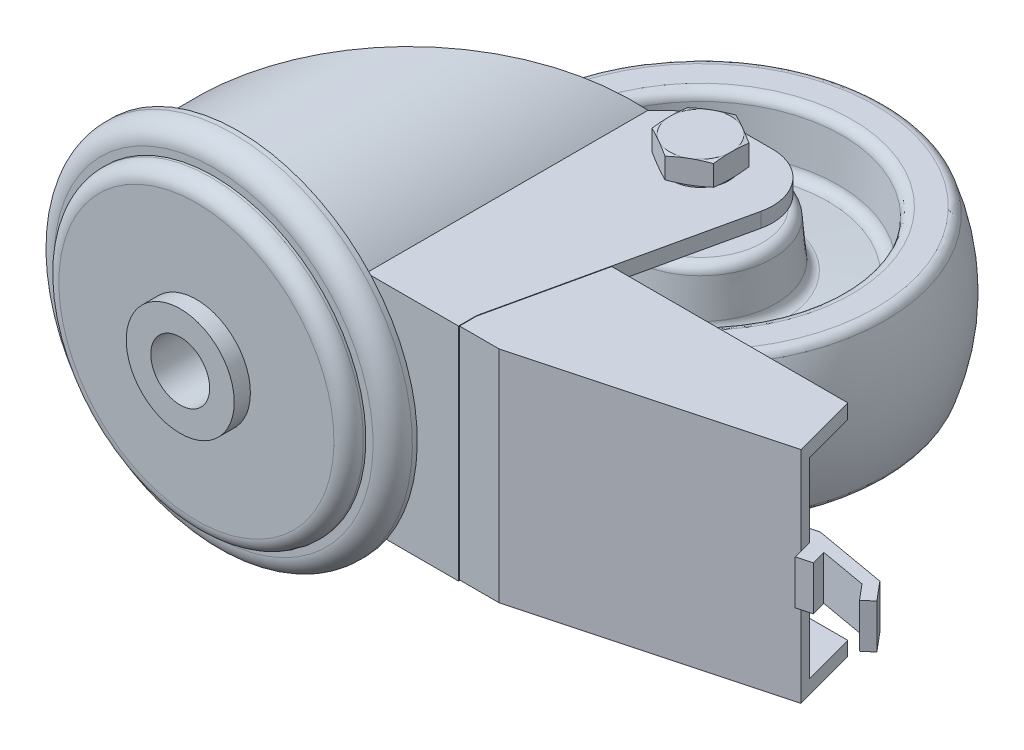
ISO-10303-21;
HEADER;
FILE_DESCRIPTION(('STEP AP214'),'2;1');
FILE_NAME('part.step','',(''),(''),'','','');
FILE_SCHEMA(('AUTOMOTIVE_DESIGN { 1 0 10303 214 1 1 1 1 }'));
ENDSEC;
DATA;
#1=APPLICATION_CONTEXT('core data for automotive mechanical design processes');
#2=APPLICATION_PROTOCOL_DEFINITION('international standard','automotive_design',2000,#1);
#3=PRODUCT_CONTEXT('',#1,'mechanical');
#4=PRODUCT('Part','Part','',(#3));
#5=PRODUCT_RELATED_PRODUCT_CATEGORY('part','',(#4));
#6=PRODUCT_DEFINITION_FORMATION('','',#4);
#7=PRODUCT_DEFINITION_CONTEXT('part definition',#1,'design');
#8=PRODUCT_DEFINITION('design','',#6,#7);
#9=PRODUCT_DEFINITION_SHAPE('','',#8);
#10=(LENGTH_UNIT() NAMED_UNIT(*) SI_UNIT(.MILLI.,.METRE.));
#11=(NAMED_UNIT(*) PLANE_ANGLE_UNIT() SI_UNIT($,.RADIAN.));
#12=(NAMED_UNIT(*) SI_UNIT($,.STERADIAN.) SOLID_ANGLE_UNIT());
#13=UNCERTAINTY_MEASURE_WITH_UNIT(LENGTH_MEASURE(1.E-05),#10,'distance_accuracy_value','');
#14=(GEOMETRIC_REPRESENTATION_CONTEXT(3) GLOBAL_UNCERTAINTY_ASSIGNED_CONTEXT((#13)) GLOBAL_UNIT_ASSIGNED_CONTEXT((#10,
#11,#12)) REPRESENTATION_CONTEXT('',''));
#15=CARTESIAN_POINT('',(0.,0.,0.));
#16=DIRECTION('',(0.,0.,1.));
#17=DIRECTION('',(1.,0.,0.));
#18=AXIS2_PLACEMENT_3D('',#15,#16,#17);
#19=CARTESIAN_POINT('',(26.332662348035,-15.,-67.));
#20=DIRECTION('',(0.,-1.,0.));
#21=DIRECTION('',(1.,0.,0.));
#22=AXIS2_PLACEMENT_3D('',#19,#20,#21);
#23=PLANE('',#22);
#24=CARTESIAN_POINT('',(39.,-15.,-67.));
#25=DIRECTION('',(0.,1.,0.));
#26=DIRECTION('',(-1.,0.,0.));
#27=AXIS2_PLACEMENT_3D('',#24,#25,#26);
#28=CIRCLE('',#27,6.);
#29=CARTESIAN_POINT('',(33.,-15.,-67.));
#30=VERTEX_POINT('',#29);
#31=EDGE_CURVE('E9',#30,#30,#28,.T.);
#32=ORIENTED_EDGE('',*,*,#31,.T.);
#33=EDGE_LOOP('',(#32));
#34=FACE_BOUND('',#33,.T.);
#35=CARTESIAN_POINT('',(39.,-15.,-67.));
#36=DIRECTION('',(0.,1.,0.));
#37=DIRECTION('',(-1.,0.,0.));
#38=AXIS2_PLACEMENT_3D('',#35,#36,#37);
#39=CIRCLE('',#38,12.667337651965);
#40=CARTESIAN_POINT('',(26.332662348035,-15.,-67.));
#41=VERTEX_POINT('',#40);
#42=EDGE_CURVE('E1022',#41,#41,#39,.T.);
#43=ORIENTED_EDGE('',*,*,#42,.F.);
#44=EDGE_LOOP('',(#43));
#45=FACE_BOUND('',#44,.T.);
#46=ADVANCED_FACE('F14',(#34,#45),#23,.T.);
#47=CARTESIAN_POINT('',(33.,15.,-67.));
#48=DIRECTION('',(0.,1.,0.));
#49=DIRECTION('',(-1.,0.,0.));
#50=AXIS2_PLACEMENT_3D('',#47,#48,#49);
#51=PLANE('',#50);
#52=CARTESIAN_POINT('',(39.,15.,-67.));
#53=DIRECTION('',(0.,1.,0.));
#54=DIRECTION('',(-1.,0.,0.));
#55=AXIS2_PLACEMENT_3D('',#52,#53,#54);
#56=CIRCLE('',#55,12.667337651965);
#57=CARTESIAN_POINT('',(26.332662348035,15.,-67.));
#58=VERTEX_POINT('',#57);
#59=EDGE_CURVE('E977',#58,#58,#56,.T.);
#60=ORIENTED_EDGE('',*,*,#59,.T.);
#61=EDGE_LOOP('',(#60));
#62=FACE_BOUND('',#61,.T.);
#63=CARTESIAN_POINT('',(39.,15.,-67.));
#64=DIRECTION('',(0.,1.,0.));
#65=DIRECTION('',(-1.,0.,0.));
#66=AXIS2_PLACEMENT_3D('',#63,#64,#65);
#67=CIRCLE('',#66,6.);
#68=CARTESIAN_POINT('',(33.,15.,-67.));
#69=VERTEX_POINT('',#68);
#70=EDGE_CURVE('E24',#69,#69,#67,.T.);
#71=ORIENTED_EDGE('',*,*,#70,.F.);
#72=EDGE_LOOP('',(#71));
#73=FACE_BOUND('',#72,.T.);
#74=ADVANCED_FACE('F2216',(#62,#73),#51,.T.);
#75=CARTESIAN_POINT('',(39.,12.999999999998,-67.));
#76=DIRECTION('',(0.,1.,0.));
#77=DIRECTION('',(-1.,0.,0.));
#78=AXIS2_PLACEMENT_3D('',#75,#76,#77);
#79=TOROIDAL_SURFACE('',#78,12.6673376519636,2.00000000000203);
#80=CARTESIAN_POINT('',(39.,13.174311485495,-67.));
#81=DIRECTION('',(0.,1.,0.));
#82=DIRECTION('',(-1.,0.,0.));
#83=AXIS2_PLACEMENT_3D('',#80,#81,#82);
#84=CIRCLE('',#83,14.659727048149);
#85=CARTESIAN_POINT('',(24.340272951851,13.174311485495,-67.));
#86=VERTEX_POINT('',#85);
#87=EDGE_CURVE('E980',#86,#86,#84,.T.);
#88=ORIENTED_EDGE('',*,*,#87,.T.);
#89=EDGE_LOOP('',(#88));
#90=FACE_BOUND('',#89,.T.);
#91=ORIENTED_EDGE('',*,*,#59,.F.);
#92=EDGE_LOOP('',(#91));
#93=FACE_BOUND('',#92,.T.);
#94=ADVANCED_FACE('F2205',(#90,#93),#79,.T.);
#95=CARTESIAN_POINT('',(39.,13.174311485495,-67.));
#96=DIRECTION('',(0.,-1.,0.));
#97=DIRECTION('',(1.,0.,0.));
#98=AXIS2_PLACEMENT_3D('',#95,#96,#97);
#99=CONICAL_SURFACE('',#98,14.659727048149,0.0872664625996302);
#100=CARTESIAN_POINT('',(39.,5.5682378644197,-67.));
#101=DIRECTION('',(0.,1.,0.));
#102=DIRECTION('',(-1.,0.,0.));
#103=AXIS2_PLACEMENT_3D('',#100,#101,#102);
#104=CIRCLE('',#103,15.325172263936);
#105=CARTESIAN_POINT('',(23.674827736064,5.5682378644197,-67.));
#106=VERTEX_POINT('',#105);
#107=EDGE_CURVE('E983',#106,#106,#104,.T.);
#108=ORIENTED_EDGE('',*,*,#107,.T.);
#109=EDGE_LOOP('',(#108));
#110=FACE_BOUND('',#109,.T.);
#111=ORIENTED_EDGE('',*,*,#87,.F.);
#112=EDGE_LOOP('',(#111));
#113=FACE_BOUND('',#112,.T.);
#114=ADVANCED_FACE('F2194',(#110,#113),#99,.T.);
#115=CARTESIAN_POINT('',(39.,5.74254934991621,-67.));
#116=DIRECTION('',(0.,1.,0.));
#117=DIRECTION('',(-1.,0.,0.));
#118=AXIS2_PLACEMENT_3D('',#115,#116,#117);
#119=TOROIDAL_SURFACE('',#118,17.3175616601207,2.00000000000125);
#120=CARTESIAN_POINT('',(39.,3.7501599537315,-67.));
#121=DIRECTION('',(0.,1.,0.));
#122=DIRECTION('',(-1.,0.,0.));
#123=AXIS2_PLACEMENT_3D('',#120,#121,#122);
#124=CIRCLE('',#123,17.143250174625);
#125=CARTESIAN_POINT('',(21.856749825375,3.7501599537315,-67.));
#126=VERTEX_POINT('',#125);
#127=EDGE_CURVE('E986',#126,#126,#124,.T.);
#128=ORIENTED_EDGE('',*,*,#127,.T.);
#129=EDGE_LOOP('',(#128));
#130=FACE_BOUND('',#129,.T.);
#131=ORIENTED_EDGE('',*,*,#107,.F.);
#132=EDGE_LOOP('',(#131));
#133=FACE_BOUND('',#132,.T.);
#134=ADVANCED_FACE('F2183',(#130,#133),#119,.F.);
#135=CARTESIAN_POINT('',(39.,3.7501599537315,-67.));
#136=DIRECTION('',(0.,-1.,0.));
#137=DIRECTION('',(1.,0.,0.));
#138=AXIS2_PLACEMENT_3D('',#135,#136,#137);
#139=CONICAL_SURFACE('',#138,17.143250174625,1.48352986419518);
#140=CARTESIAN_POINT('',(39.,2.9804751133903,-67.));
#141=DIRECTION('',(0.,1.,0.));
#142=DIRECTION('',(-1.,0.,0.));
#143=AXIS2_PLACEMENT_3D('',#140,#141,#142);
#144=CIRCLE('',#143,25.940788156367);
#145=CARTESIAN_POINT('',(13.059211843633,2.9804751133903,-67.));
#146=VERTEX_POINT('',#145);
#147=EDGE_CURVE('E989',#146,#146,#144,.T.);
#148=ORIENTED_EDGE('',*,*,#147,.T.);
#149=EDGE_LOOP('',(#148));
#150=FACE_BOUND('',#149,.T.);
#151=ORIENTED_EDGE('',*,*,#127,.F.);
#152=EDGE_LOOP('',(#151));
#153=FACE_BOUND('',#152,.T.);
#154=ADVANCED_FACE('F2172',(#150,#153),#139,.T.);
#155=CARTESIAN_POINT('',(39.,4.97286450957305,-67.));
#156=DIRECTION('',(0.,1.,0.));
#157=DIRECTION('',(-1.,0.,0.));
#158=AXIS2_PLACEMENT_3D('',#155,#156,#157);
#159=TOROIDAL_SURFACE('',#158,26.1150996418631,1.99999999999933);
#160=CARTESIAN_POINT('',(39.,4.7985530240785,-67.));
#161=DIRECTION('',(0.,1.,0.));
#162=DIRECTION('',(-1.,0.,0.));
#163=AXIS2_PLACEMENT_3D('',#160,#161,#162);
#164=CIRCLE('',#163,28.107489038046);
#165=CARTESIAN_POINT('',(10.892510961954,4.7985530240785,-67.));
#166=VERTEX_POINT('',#165);
#167=EDGE_CURVE('E992',#166,#166,#164,.T.);
#168=ORIENTED_EDGE('',*,*,#167,.T.);
#169=EDGE_LOOP('',(#168));
#170=FACE_BOUND('',#169,.T.);
#171=ORIENTED_EDGE('',*,*,#147,.F.);
#172=EDGE_LOOP('',(#171));
#173=FACE_BOUND('',#172,.T.);
#174=ADVANCED_FACE('F2161',(#170,#173),#159,.F.);
#175=CARTESIAN_POINT('',(39.,4.7985530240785,-67.));
#176=DIRECTION('',(0.,1.,0.));
#177=DIRECTION('',(-1.,0.,0.));
#178=AXIS2_PLACEMENT_3D('',#175,#176,#177);
#179=CONICAL_SURFACE('',#178,28.107489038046,0.0872664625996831);
#180=CARTESIAN_POINT('',(39.,13.174311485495,-67.));
#181=DIRECTION('',(0.,1.,0.));
#182=DIRECTION('',(-1.,0.,0.));
#183=AXIS2_PLACEMENT_3D('',#180,#181,#182);
#184=CIRCLE('',#183,28.840272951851);
#185=CARTESIAN_POINT('',(10.159727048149,13.174311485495,-67.));
#186=VERTEX_POINT('',#185);
#187=EDGE_CURVE('E995',#186,#186,#184,.T.);
#188=ORIENTED_EDGE('',*,*,#187,.T.);
#189=EDGE_LOOP('',(#188));
#190=FACE_BOUND('',#189,.T.);
#191=ORIENTED_EDGE('',*,*,#167,.F.);
#192=EDGE_LOOP('',(#191));
#193=FACE_BOUND('',#192,.T.);
#194=ADVANCED_FACE('F2150',(#190,#193),#179,.F.);
#195=CARTESIAN_POINT('',(39.,12.999999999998,-67.));
#196=DIRECTION('',(0.,1.,0.));
#197=DIRECTION('',(-1.,0.,0.));
#198=AXIS2_PLACEMENT_3D('',#195,#196,#197);
#199=TOROIDAL_SURFACE('',#198,30.8326623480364,2.00000000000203);
#200=CARTESIAN_POINT('',(39.,15.,-67.));
#201=DIRECTION('',(0.,1.,0.));
#202=DIRECTION('',(-1.,0.,0.));
#203=AXIS2_PLACEMENT_3D('',#200,#201,#202);
#204=CIRCLE('',#203,30.832662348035);
#205=CARTESIAN_POINT('',(8.167337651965,15.,-67.));
#206=VERTEX_POINT('',#205);
#207=EDGE_CURVE('E998',#206,#206,#204,.T.);
#208=ORIENTED_EDGE('',*,*,#207,.T.);
#209=EDGE_LOOP('',(#208));
#210=FACE_BOUND('',#209,.T.);
#211=ORIENTED_EDGE('',*,*,#187,.F.);
#212=EDGE_LOOP('',(#211));
#213=FACE_BOUND('',#212,.T.);
#214=ADVANCED_FACE('F2140',(#210,#213),#199,.T.);
#215=CARTESIAN_POINT('',(8.167337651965,15.,-67.));
#216=DIRECTION('',(0.,1.,0.));
#217=DIRECTION('',(-1.,0.,0.));
#218=AXIS2_PLACEMENT_3D('',#215,#216,#217);
#219=PLANE('',#218);
#220=CARTESIAN_POINT('',(39.,15.,-67.));
#221=DIRECTION('',(0.,1.,0.));
#222=DIRECTION('',(-1.,0.,0.));
#223=AXIS2_PLACEMENT_3D('',#220,#221,#222);
#224=CIRCLE('',#223,35.707142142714);
#225=CARTESIAN_POINT('',(3.292857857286,15.,-67.));
#226=VERTEX_POINT('',#225);
#227=EDGE_CURVE('E1025',#226,#226,#224,.T.);
#228=ORIENTED_EDGE('',*,*,#227,.T.);
#229=EDGE_LOOP('',(#228));
#230=FACE_BOUND('',#229,.T.);
#231=ORIENTED_EDGE('',*,*,#207,.F.);
#232=EDGE_LOOP('',(#231));
#233=FACE_BOUND('',#232,.T.);
#234=ADVANCED_FACE('F2129',(#230,#233),#219,.T.);
#235=CARTESIAN_POINT('',(5.,-15.,-67.));
#236=DIRECTION('',(0.,-1.,0.));
#237=DIRECTION('',(1.,0.,0.));
#238=AXIS2_PLACEMENT_3D('',#235,#236,#237);
#239=PLANE('',#238);
#240=CARTESIAN_POINT('',(39.,-15.,-67.));
#241=DIRECTION('',(0.,1.,0.));
#242=DIRECTION('',(-1.,0.,0.));
#243=AXIS2_PLACEMENT_3D('',#240,#241,#242);
#244=CIRCLE('',#243,30.832662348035);
#245=CARTESIAN_POINT('',(8.167337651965,-15.,-67.));
#246=VERTEX_POINT('',#245);
#247=EDGE_CURVE('E1001',#246,#246,#244,.T.);
#248=ORIENTED_EDGE('',*,*,#247,.T.);
#249=EDGE_LOOP('',(#248));
#250=FACE_BOUND('',#249,.T.);
#251=CARTESIAN_POINT('',(39.,-15.,-67.));
#252=DIRECTION('',(0.,1.,0.));
#253=DIRECTION('',(-1.,0.,0.));
#254=AXIS2_PLACEMENT_3D('',#251,#252,#253);
#255=CIRCLE('',#254,35.707142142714);
#256=CARTESIAN_POINT('',(3.292857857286,-15.,-67.));
#257=VERTEX_POINT('',#256);
#258=EDGE_CURVE('E1034',#257,#257,#255,.T.);
#259=ORIENTED_EDGE('',*,*,#258,.F.);
#260=EDGE_LOOP('',(#259));
#261=FACE_BOUND('',#260,.T.);
#262=ADVANCED_FACE('F2117',(#250,#261),#239,.T.);
#263=CARTESIAN_POINT('',(39.,-12.999999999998,-67.));
#264=DIRECTION('',(0.,1.,0.));
#265=DIRECTION('',(-1.,0.,0.));
#266=AXIS2_PLACEMENT_3D('',#263,#264,#265);
#267=TOROIDAL_SURFACE('',#266,30.8326623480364,2.00000000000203);
#268=CARTESIAN_POINT('',(39.,-13.174311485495,-67.));
#269=DIRECTION('',(0.,1.,0.));
#270=DIRECTION('',(-1.,0.,0.));
#271=AXIS2_PLACEMENT_3D('',#268,#269,#270);
#272=CIRCLE('',#271,28.840272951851);
#273=CARTESIAN_POINT('',(10.159727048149,-13.174311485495,-67.));
#274=VERTEX_POINT('',#273);
#275=EDGE_CURVE('E1004',#274,#274,#272,.T.);
#276=ORIENTED_EDGE('',*,*,#275,.T.);
#277=EDGE_LOOP('',(#276));
#278=FACE_BOUND('',#277,.T.);
#279=ORIENTED_EDGE('',*,*,#247,.F.);
#280=EDGE_LOOP('',(#279));
#281=FACE_BOUND('',#280,.T.);
#282=ADVANCED_FACE('F2106',(#278,#281),#267,.T.);
#283=CARTESIAN_POINT('',(39.,-13.174311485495,-67.));
#284=DIRECTION('',(0.,-1.,0.));
#285=DIRECTION('',(1.,0.,0.));
#286=AXIS2_PLACEMENT_3D('',#283,#284,#285);
#287=CONICAL_SURFACE('',#286,28.840272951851,0.0872664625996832);
#288=CARTESIAN_POINT('',(39.,-4.7985530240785,-67.));
#289=DIRECTION('',(0.,1.,0.));
#290=DIRECTION('',(-1.,0.,0.));
#291=AXIS2_PLACEMENT_3D('',#288,#289,#290);
#292=CIRCLE('',#291,28.107489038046);
#293=CARTESIAN_POINT('',(10.892510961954,-4.7985530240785,-67.));
#294=VERTEX_POINT('',#293);
#295=EDGE_CURVE('E1007',#294,#294,#292,.T.);
#296=ORIENTED_EDGE('',*,*,#295,.T.);
#297=EDGE_LOOP('',(#296));
#298=FACE_BOUND('',#297,.T.);
#299=ORIENTED_EDGE('',*,*,#275,.F.);
#300=EDGE_LOOP('',(#299));
#301=FACE_BOUND('',#300,.T.);
#302=ADVANCED_FACE('F2095',(#298,#301),#287,.F.);
#303=CARTESIAN_POINT('',(39.,-4.97286450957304,-67.));
#304=DIRECTION('',(0.,1.,0.));
#305=DIRECTION('',(-1.,0.,0.));
#306=AXIS2_PLACEMENT_3D('',#303,#304,#305);
#307=TOROIDAL_SURFACE('',#306,26.1150996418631,1.99999999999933);
#308=CARTESIAN_POINT('',(39.,-2.9804751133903,-67.));
#309=DIRECTION('',(0.,1.,0.));
#310=DIRECTION('',(-1.,0.,0.));
#311=AXIS2_PLACEMENT_3D('',#308,#309,#310);
#312=CIRCLE('',#311,25.940788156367);
#313=CARTESIAN_POINT('',(13.059211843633,-2.9804751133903,-67.));
#314=VERTEX_POINT('',#313);
#315=EDGE_CURVE('E1010',#314,#314,#312,.T.);
#316=ORIENTED_EDGE('',*,*,#315,.T.);
#317=EDGE_LOOP('',(#316));
#318=FACE_BOUND('',#317,.T.);
#319=ORIENTED_EDGE('',*,*,#295,.F.);
#320=EDGE_LOOP('',(#319));
#321=FACE_BOUND('',#320,.T.);
#322=ADVANCED_FACE('F2084',(#318,#321),#307,.F.);
#323=CARTESIAN_POINT('',(39.,-2.9804751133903,-67.));
#324=DIRECTION('',(0.,1.,0.));
#325=DIRECTION('',(-1.,0.,0.));
#326=AXIS2_PLACEMENT_3D('',#323,#324,#325);
#327=CONICAL_SURFACE('',#326,25.940788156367,1.48352986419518);
#328=CARTESIAN_POINT('',(39.,-3.7501599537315,-67.));
#329=DIRECTION('',(0.,1.,0.));
#330=DIRECTION('',(-1.,0.,0.));
#331=AXIS2_PLACEMENT_3D('',#328,#329,#330);
#332=CIRCLE('',#331,17.143250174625);
#333=CARTESIAN_POINT('',(21.856749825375,-3.7501599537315,-67.));
#334=VERTEX_POINT('',#333);
#335=EDGE_CURVE('E1013',#334,#334,#332,.T.);
#336=ORIENTED_EDGE('',*,*,#335,.T.);
#337=EDGE_LOOP('',(#336));
#338=FACE_BOUND('',#337,.T.);
#339=ORIENTED_EDGE('',*,*,#315,.F.);
#340=EDGE_LOOP('',(#339));
#341=FACE_BOUND('',#340,.T.);
#342=ADVANCED_FACE('F2073',(#338,#341),#327,.T.);
#343=CARTESIAN_POINT('',(39.,-5.74254934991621,-67.));
#344=DIRECTION('',(0.,1.,0.));
#345=DIRECTION('',(-1.,0.,0.));
#346=AXIS2_PLACEMENT_3D('',#343,#344,#345);
#347=TOROIDAL_SURFACE('',#346,17.3175616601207,2.00000000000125);
#348=CARTESIAN_POINT('',(39.,-5.5682378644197,-67.));
#349=DIRECTION('',(0.,1.,0.));
#350=DIRECTION('',(-1.,0.,0.));
#351=AXIS2_PLACEMENT_3D('',#348,#349,#350);
#352=CIRCLE('',#351,15.325172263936);
#353=CARTESIAN_POINT('',(23.674827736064,-5.5682378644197,-67.));
#354=VERTEX_POINT('',#353);
#355=EDGE_CURVE('E1016',#354,#354,#352,.T.);
#356=ORIENTED_EDGE('',*,*,#355,.T.);
#357=EDGE_LOOP('',(#356));
#358=FACE_BOUND('',#357,.T.);
#359=ORIENTED_EDGE('',*,*,#335,.F.);
#360=EDGE_LOOP('',(#359));
#361=FACE_BOUND('',#360,.T.);
#362=ADVANCED_FACE('F2062',(#358,#361),#347,.F.);
#363=CARTESIAN_POINT('',(39.,-5.5682378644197,-67.));
#364=DIRECTION('',(0.,1.,0.));
#365=DIRECTION('',(-1.,0.,0.));
#366=AXIS2_PLACEMENT_3D('',#363,#364,#365);
#367=CONICAL_SURFACE('',#366,15.325172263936,0.0872664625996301);
#368=CARTESIAN_POINT('',(39.,-13.174311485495,-67.));
#369=DIRECTION('',(0.,1.,0.));
#370=DIRECTION('',(-1.,0.,0.));
#371=AXIS2_PLACEMENT_3D('',#368,#369,#370);
#372=CIRCLE('',#371,14.659727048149);
#373=CARTESIAN_POINT('',(24.340272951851,-13.174311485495,-67.));
#374=VERTEX_POINT('',#373);
#375=EDGE_CURVE('E1019',#374,#374,#372,.T.);
#376=ORIENTED_EDGE('',*,*,#375,.T.);
#377=EDGE_LOOP('',(#376));
#378=FACE_BOUND('',#377,.T.);
#379=ORIENTED_EDGE('',*,*,#355,.F.);
#380=EDGE_LOOP('',(#379));
#381=FACE_BOUND('',#380,.T.);
#382=ADVANCED_FACE('F2051',(#378,#381),#367,.T.);
#383=CARTESIAN_POINT('',(39.,-12.999999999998,-67.));
#384=DIRECTION('',(0.,1.,0.));
#385=DIRECTION('',(-1.,0.,0.));
#386=AXIS2_PLACEMENT_3D('',#383,#384,#385);
#387=TOROIDAL_SURFACE('',#386,12.6673376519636,2.00000000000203);
#388=ORIENTED_EDGE('',*,*,#42,.T.);
#389=EDGE_LOOP('',(#388));
#390=FACE_BOUND('',#389,.T.);
#391=ORIENTED_EDGE('',*,*,#375,.F.);
#392=EDGE_LOOP('',(#391));
#393=FACE_BOUND('',#392,.T.);
#394=ADVANCED_FACE('F2040',(#390,#393),#387,.T.);
#395=CARTESIAN_POINT('',(39.,12.9999999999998,-67.));
#396=DIRECTION('',(0.,1.,0.));
#397=DIRECTION('',(-1.,0.,0.));
#398=AXIS2_PLACEMENT_3D('',#395,#396,#397);
#399=TOROIDAL_SURFACE('',#398,35.7071421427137,2.0000000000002);
#400=CARTESIAN_POINT('',(39.,13.684210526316,-67.));
#401=DIRECTION('',(0.,1.,0.));
#402=DIRECTION('',(-1.,0.,0.));
#403=AXIS2_PLACEMENT_3D('',#400,#401,#402);
#404=CIRCLE('',#403,37.586465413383);
#405=CARTESIAN_POINT('',(1.413534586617,13.684210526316,-67.));
#406=VERTEX_POINT('',#405);
#407=EDGE_CURVE('E1028',#406,#406,#404,.T.);
#408=ORIENTED_EDGE('',*,*,#407,.T.);
#409=EDGE_LOOP('',(#408));
#410=FACE_BOUND('',#409,.T.);
#411=ORIENTED_EDGE('',*,*,#227,.F.);
#412=EDGE_LOOP('',(#411));
#413=FACE_BOUND('',#412,.T.);
#414=ADVANCED_FACE('F2029',(#410,#413),#399,.T.);
#415=CARTESIAN_POINT('',(38.9999999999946,0.,-67.));
#416=DIRECTION('',(0.,1.,0.));
#417=DIRECTION('',(-1.,0.,0.));
#418=AXIS2_PLACEMENT_3D('',#415,#416,#417);
#419=SPHERICAL_SURFACE('',#418,39.9999999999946);
#420=CARTESIAN_POINT('',(39.,-13.684210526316,-67.));
#421=DIRECTION('',(0.,1.,0.));
#422=DIRECTION('',(-1.,0.,0.));
#423=AXIS2_PLACEMENT_3D('',#420,#421,#422);
#424=CIRCLE('',#423,37.586465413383);
#425=CARTESIAN_POINT('',(1.413534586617,-13.684210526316,-67.));
#426=VERTEX_POINT('',#425);
#427=EDGE_CURVE('E1031',#426,#426,#424,.T.);
#428=CARTESIAN_POINT('',(1.413534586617,-13.684210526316,-67.));
#429=CARTESIAN_POINT('',(1.3139938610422,-13.4108032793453,-67.));
#430=CARTESIAN_POINT('',(1.21743733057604,-13.1363095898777,-67.));
#431=CARTESIAN_POINT('',(1.0303363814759,-12.5852808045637,-67.));
#432=CARTESIAN_POINT('',(0.939791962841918,-12.3087457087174,-67.));
#433=CARTESIAN_POINT('',(0.764758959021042,-11.7537655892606,-67.));
#434=CARTESIAN_POINT('',(0.680270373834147,-11.4753205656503,-67.));
#435=CARTESIAN_POINT('',(0.517389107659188,-10.9166532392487,-67.));
#436=CARTESIAN_POINT('',(0.438996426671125,-10.6364309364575,-67.));
#437=CARTESIAN_POINT('',(0.288344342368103,-10.0743424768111,-67.));
#438=CARTESIAN_POINT('',(0.216084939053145,-9.79247631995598,-67.));
#439=CARTESIAN_POINT('',(0.0777338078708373,-9.22723437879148,-67.));
#440=CARTESIAN_POINT('',(0.0116420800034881,-8.94385859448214,-67.));
#441=CARTESIAN_POINT('',(-0.11434222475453,-8.37573233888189,-67.));
#442=CARTESIAN_POINT('',(-0.174234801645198,-8.09098186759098,-67.));
#443=CARTESIAN_POINT('',(-0.287792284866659,-7.52024183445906,-67.));
#444=CARTESIAN_POINT('',(-0.341457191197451,-7.23425227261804,-67.));
#445=CARTESIAN_POINT('',(-0.442533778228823,-6.66117024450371,-67.));
#446=CARTESIAN_POINT('',(-0.489945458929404,-6.37407777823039,-67.));
#447=CARTESIAN_POINT('',(-0.578493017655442,-5.79892665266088,-67.));
#448=CARTESIAN_POINT('',(-0.619628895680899,-5.51086799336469,-67.));
#449=CARTESIAN_POINT('',(-0.695605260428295,-4.93392165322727,-67.));
#450=CARTESIAN_POINT('',(-0.730445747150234,-4.64503397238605,-67.));
#451=CARTESIAN_POINT('',(-0.793814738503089,-4.06656715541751,-67.));
#452=CARTESIAN_POINT('',(-0.822343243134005,-3.77698801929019,-67.));
#453=CARTESIAN_POINT('',(-0.873074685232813,-3.1972761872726,-67.));
#454=CARTESIAN_POINT('',(-0.895277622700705,-2.90714349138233,-67.));
#455=CARTESIAN_POINT('',(-0.933347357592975,-2.32646269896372,-67.));
#456=CARTESIAN_POINT('',(-0.949214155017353,-2.03591460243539,-67.));
#457=CARTESIAN_POINT('',(-0.974604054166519,-1.4545413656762,-67.));
#458=CARTESIAN_POINT('',(-0.984127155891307,-1.16371622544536,-67.));
#459=CARTESIAN_POINT('',(-0.996825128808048,-0.581927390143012,-67.));
#460=CARTESIAN_POINT('',(-1.,-0.290963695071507,-67.));
#461=CARTESIAN_POINT('',(-1.,0.290963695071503,-67.));
#462=CARTESIAN_POINT('',(-0.996825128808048,0.581927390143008,-67.));
#463=CARTESIAN_POINT('',(-0.984127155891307,1.16371622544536,-67.));
#464=CARTESIAN_POINT('',(-0.974604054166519,1.4545413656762,-67.));
#465=CARTESIAN_POINT('',(-0.949214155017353,2.03591460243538,-67.));
#466=CARTESIAN_POINT('',(-0.933347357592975,2.32646269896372,-67.));
#467=CARTESIAN_POINT('',(-0.895277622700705,2.90714349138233,-67.));
#468=CARTESIAN_POINT('',(-0.873074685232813,3.19727618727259,-67.));
#469=CARTESIAN_POINT('',(-0.822343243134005,3.77698801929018,-67.));
#470=CARTESIAN_POINT('',(-0.793814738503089,4.06656715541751,-67.));
#471=CARTESIAN_POINT('',(-0.730445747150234,4.64503397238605,-67.));
#472=CARTESIAN_POINT('',(-0.695605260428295,4.93392165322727,-67.));
#473=CARTESIAN_POINT('',(-0.619628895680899,5.51086799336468,-67.));
#474=CARTESIAN_POINT('',(-0.578493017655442,5.79892665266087,-67.));
#475=CARTESIAN_POINT('',(-0.489945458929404,6.37407777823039,-67.));
#476=CARTESIAN_POINT('',(-0.442533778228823,6.66117024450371,-67.));
#477=CARTESIAN_POINT('',(-0.341457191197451,7.23425227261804,-67.));
#478=CARTESIAN_POINT('',(-0.287792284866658,7.52024183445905,-67.));
#479=CARTESIAN_POINT('',(-0.174234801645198,8.09098186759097,-67.));
#480=CARTESIAN_POINT('',(-0.11434222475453,8.37573233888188,-67.));
#481=CARTESIAN_POINT('',(0.0116420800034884,8.94385859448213,-67.));
#482=CARTESIAN_POINT('',(0.0777338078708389,9.22723437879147,-67.));
#483=CARTESIAN_POINT('',(0.216084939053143,9.79247631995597,-67.));
#484=CARTESIAN_POINT('',(0.288344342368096,10.0743424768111,-67.));
#485=CARTESIAN_POINT('',(0.438996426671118,10.6364309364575,-67.));
#486=CARTESIAN_POINT('',(0.517389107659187,10.9166532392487,-67.));
#487=CARTESIAN_POINT('',(0.680270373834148,11.4753205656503,-67.));
#488=CARTESIAN_POINT('',(0.764758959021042,11.7537655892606,-67.));
#489=CARTESIAN_POINT('',(0.939791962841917,12.3087457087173,-67.));
#490=CARTESIAN_POINT('',(1.0303363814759,12.5852808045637,-67.));
#491=CARTESIAN_POINT('',(1.21743733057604,13.1363095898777,-67.));
#492=CARTESIAN_POINT('',(1.3139938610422,13.4108032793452,-67.));
#493=CARTESIAN_POINT('',(1.413534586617,13.684210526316,-67.));
#494=B_SPLINE_CURVE_WITH_KNOTS('',3,(#428,#429,#430,#431,#432,#433,#434,#435,#436,#437,#438,
#439,#440,#441,#442,#443,#444,#445,#446,#447,#448,#449,#450,#451,#452,#453,#454,#455,#456,#457,
#458,#459,#460,#461,#462,#463,#464,#465,#466,#467,#468,#469,#470,#471,#472,#473,#474,#475,#476,
#477,#478,#479,#480,#481,#482,#483,#484,#485,#486,#487,#488,#489,#490,#491,#492,#493),
.UNSPECIFIED.,.F.,.F.,(4,2,2,2,2,2,2,2,2,2,2,2,2,2,2,2,2,2,2,2,2,2,2,2,2,2,2,2,2,2,2,2,4),(0.,
0.872873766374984,1.74574753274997,2.61862129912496,3.49149506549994,4.36436883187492,
5.23724259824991,6.1101163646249,6.98299013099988,7.85586389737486,8.72873766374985,
9.60161143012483,10.4744851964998,11.3473589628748,12.2202327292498,13.0931064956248,
13.9659802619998,14.8388540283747,15.7117277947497,16.5846015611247,17.4574753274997,
18.3303490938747,19.2032228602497,20.0760966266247,20.9489703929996,21.8218441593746,
22.6947179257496,23.5675916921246,24.4404654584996,25.3133392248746,26.1862129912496,
27.0590867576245,27.9319605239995),.UNSPECIFIED.);
#495=EDGE_CURVE('BSEAM2017',#426,#406,#494,.T.);
#496=ORIENTED_EDGE('',*,*,#427,.T.);
#497=ORIENTED_EDGE('',*,*,#407,.F.);
#498=ORIENTED_EDGE('',*,*,#495,.T.);
#499=ORIENTED_EDGE('',*,*,#495,.F.);
#500=EDGE_LOOP('',(#496,#498,#497,#499));
#501=FACE_BOUND('',#500,.T.);
#502=ADVANCED_FACE('F2017',(#501),#419,.T.);
#503=CARTESIAN_POINT('',(39.,-12.9999999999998,-67.));
#504=DIRECTION('',(0.,1.,0.));
#505=DIRECTION('',(-1.,0.,0.));
#506=AXIS2_PLACEMENT_3D('',#503,#504,#505);
#507=TOROIDAL_SURFACE('',#506,35.7071421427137,2.0000000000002);
#508=ORIENTED_EDGE('',*,*,#258,.T.);
#509=EDGE_LOOP('',(#508));
#510=FACE_BOUND('',#509,.T.);
#511=ORIENTED_EDGE('',*,*,#427,.F.);
#512=EDGE_LOOP('',(#511));
#513=FACE_BOUND('',#512,.T.);
#514=ADVANCED_FACE('F621',(#510,#513),#507,.T.);
#515=CARTESIAN_POINT('',(39.,-32.5,-70.233));
#516=DIRECTION('',(0.,-1.,0.));
#517=DIRECTION('',(-1.,0.,0.));
#518=AXIS2_PLACEMENT_3D('',#515,#516,#517);
#519=PLANE('',#518);
#520=CARTESIAN_POINT('',(39.,-32.5,-67.));
#521=DIRECTION('',(0.,1.,0.));
#522=DIRECTION('',(1.,0.,0.));
#523=AXIS2_PLACEMENT_3D('',#520,#521,#522);
#524=CIRCLE('',#523,3.233);
#525=CARTESIAN_POINT('',(42.233,-32.5,-67.));
#526=VERTEX_POINT('',#525);
#527=EDGE_CURVE('E3471',#526,#526,#524,.T.);
#528=ORIENTED_EDGE('',*,*,#527,.F.);
#529=EDGE_LOOP('',(#528));
#530=FACE_BOUND('',#529,.T.);
#531=ADVANCED_FACE('F604',(#530),#519,.T.);
#532=CARTESIAN_POINT('',(39.,-31.733,-67.));
#533=DIRECTION('',(0.,1.,0.));
#534=DIRECTION('',(1.,0.,0.));
#535=AXIS2_PLACEMENT_3D('',#532,#533,#534);
#536=CONICAL_SURFACE('',#535,4.,0.78539816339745);
#537=ORIENTED_EDGE('',*,*,#527,.T.);
#538=EDGE_LOOP('',(#537));
#539=FACE_BOUND('',#538,.T.);
#540=CARTESIAN_POINT('',(39.,-31.733,-67.));
#541=DIRECTION('',(0.,1.,0.));
#542=DIRECTION('',(1.,0.,0.));
#543=AXIS2_PLACEMENT_3D('',#540,#541,#542);
#544=CIRCLE('',#543,4.);
#545=CARTESIAN_POINT('',(43.,-31.733,-67.));
#546=VERTEX_POINT('',#545);
#547=EDGE_CURVE('E3468',#546,#546,#544,.T.);
#548=ORIENTED_EDGE('',*,*,#547,.F.);
#549=EDGE_LOOP('',(#548));
#550=FACE_BOUND('',#549,.T.);
#551=ADVANCED_FACE('F851',(#539,#550),#536,.T.);
#552=CARTESIAN_POINT('',(39.,27.8,-67.));
#553=DIRECTION('',(0.,1.,0.));
#554=DIRECTION('',(1.,0.,0.));
#555=AXIS2_PLACEMENT_3D('',#552,#553,#554);
#556=PLANE('',#555);
#557=CARTESIAN_POINT('',(39.,27.8,-67.));
#558=DIRECTION('',(0.,1.,0.));
#559=DIRECTION('',(1.,0.,0.));
#560=AXIS2_PLACEMENT_3D('',#557,#558,#559);
#561=CIRCLE('',#560,6.2583333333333);
#562=CARTESIAN_POINT('',(45.2583333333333,27.8,-67.));
#563=VERTEX_POINT('',#562);
#564=CARTESIAN_POINT('',(42.1291666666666,27.8,-72.4198756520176));
#565=VERTEX_POINT('',#564);
#566=EDGE_CURVE('E441',#563,#565,#561,.T.);
#567=ORIENTED_EDGE('',*,*,#566,.T.);
#568=CARTESIAN_POINT('',(35.8708333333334,27.8,-72.4198756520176));
#569=VERTEX_POINT('',#568);
#570=EDGE_CURVE('E451',#565,#569,#561,.T.);
#571=ORIENTED_EDGE('',*,*,#570,.T.);
#572=CARTESIAN_POINT('',(32.7416666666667,27.8,-67.));
#573=VERTEX_POINT('',#572);
#574=EDGE_CURVE('E455',#569,#573,#561,.T.);
#575=ORIENTED_EDGE('',*,*,#574,.T.);
#576=CARTESIAN_POINT('',(35.8708333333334,27.8,-61.5801243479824));
#577=VERTEX_POINT('',#576);
#578=EDGE_CURVE('E3390',#573,#577,#561,.T.);
#579=ORIENTED_EDGE('',*,*,#578,.T.);
#580=CARTESIAN_POINT('',(42.1291666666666,27.8,-61.5801243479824));
#581=VERTEX_POINT('',#580);
#582=EDGE_CURVE('E444',#577,#581,#561,.T.);
#583=ORIENTED_EDGE('',*,*,#582,.T.);
#584=EDGE_CURVE('E433',#581,#563,#561,.T.);
#585=ORIENTED_EDGE('',*,*,#584,.T.);
#586=EDGE_LOOP('',(#567,#571,#575,#579,#583,#585));
#587=FACE_BOUND('',#586,.T.);
#588=ADVANCED_FACE('F439',(#587),#556,.T.);
#589=CARTESIAN_POINT('',(39.,-32.5,-67.));
#590=DIRECTION('',(0.,1.,0.));
#591=DIRECTION('',(1.,0.,0.));
#592=AXIS2_PLACEMENT_3D('',#589,#590,#591);
#593=CYLINDRICAL_SURFACE('',#592,4.);
#594=ORIENTED_EDGE('',*,*,#547,.T.);
#595=EDGE_LOOP('',(#594));
#596=FACE_BOUND('',#595,.T.);
#597=CARTESIAN_POINT('',(39.,-30.5,-67.));
#598=DIRECTION('',(0.,1.,0.));
#599=DIRECTION('',(1.,0.,0.));
#600=AXIS2_PLACEMENT_3D('',#597,#598,#599);
#601=CIRCLE('',#600,4.);
#602=CARTESIAN_POINT('',(43.,-30.5,-67.));
#603=VERTEX_POINT('',#602);
#604=EDGE_CURVE('E3488',#603,#603,#601,.T.);
#605=ORIENTED_EDGE('',*,*,#604,.F.);
#606=EDGE_LOOP('',(#605));
#607=FACE_BOUND('',#606,.T.);
#608=ADVANCED_FACE('F850',(#596,#607),#593,.T.);
#609=CARTESIAN_POINT('',(39.,27.8,-67.));
#610=DIRECTION('',(0.,-1.,0.));
#611=DIRECTION('',(-1.,0.,0.));
#612=AXIS2_PLACEMENT_3D('',#609,#610,#611);
#613=CONICAL_SURFACE('',#612,6.2583333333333,1.30899693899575);
#614=CARTESIAN_POINT('',(32.7416666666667,26.415610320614,-57.4416186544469));
#615=CARTESIAN_POINT('',(32.7416666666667,26.4792409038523,-57.7255412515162));
#616=CARTESIAN_POINT('',(32.7416666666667,26.5420932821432,-58.0096414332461));
#617=CARTESIAN_POINT('',(32.7416666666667,26.6658215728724,-58.5782841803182));
#618=CARTESIAN_POINT('',(32.7416666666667,26.7266973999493,-58.8628267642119));
#619=CARTESIAN_POINT('',(32.7416666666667,26.8461055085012,-59.4326964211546));
#620=CARTESIAN_POINT('',(32.7416666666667,26.9046354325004,-59.7180239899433));
#621=CARTESIAN_POINT('',(32.7416666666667,27.0187199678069,-60.2892730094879));
#622=CARTESIAN_POINT('',(32.7416666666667,27.0742746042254,-60.5751944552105));
#623=CARTESIAN_POINT('',(32.7416666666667,27.1812719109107,-61.1454542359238));
#624=CARTESIAN_POINT('',(32.7416666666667,27.2327437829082,-61.4297870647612));
#625=CARTESIAN_POINT('',(32.7416666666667,27.3311937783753,-61.9992282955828));
#626=CARTESIAN_POINT('',(32.7416666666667,27.3781720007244,-62.2843366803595));
#627=CARTESIAN_POINT('',(32.7416666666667,27.466576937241,-62.8553843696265));
#628=CARTESIAN_POINT('',(32.7416666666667,27.5080043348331,-63.1413235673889));
#629=CARTESIAN_POINT('',(32.7416666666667,27.5840868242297,-63.7141118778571));
#630=CARTESIAN_POINT('',(32.7416666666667,27.6187419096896,-64.0009609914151));
#631=CARTESIAN_POINT('',(32.7416666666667,27.6802984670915,-64.5788053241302));
#632=CARTESIAN_POINT('',(32.7416666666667,27.7071071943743,-64.8698105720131));
#633=CARTESIAN_POINT('',(32.7416666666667,27.7511216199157,-65.4525526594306));
#634=CARTESIAN_POINT('',(32.7416666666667,27.7683275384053,-65.7442894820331));
#635=CARTESIAN_POINT('',(32.7416666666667,27.7921328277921,-66.3280715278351));
#636=CARTESIAN_POINT('',(32.7416666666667,27.7987370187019,-66.6201165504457));
#637=CARTESIAN_POINT('',(32.7416666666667,27.8009328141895,-67.2042485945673));
#638=CARTESIAN_POINT('',(32.7416666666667,27.7965244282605,-67.4963356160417));
#639=CARTESIAN_POINT('',(32.7416666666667,27.7769429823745,-68.0812041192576));
#640=CARTESIAN_POINT('',(32.7416666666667,27.7617308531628,-68.3739842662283));
#641=CARTESIAN_POINT('',(32.7416666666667,27.7214102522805,-68.9588560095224));
#642=CARTESIAN_POINT('',(32.7416666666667,27.6963015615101,-69.2509475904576));
#643=CARTESIAN_POINT('',(32.7416666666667,27.6374561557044,-69.8344397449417));
#644=CARTESIAN_POINT('',(32.7416666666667,27.6037138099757,-70.1258397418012));
#645=CARTESIAN_POINT('',(32.7416666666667,27.5290051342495,-70.7077019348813));
#646=CARTESIAN_POINT('',(32.7416666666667,27.4880387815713,-70.9981641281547));
#647=CARTESIAN_POINT('',(32.7416666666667,27.4031009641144,-71.5589779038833));
#648=CARTESIAN_POINT('',(32.7416666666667,27.3595081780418,-71.8293874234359));
#649=CARTESIAN_POINT('',(32.7416666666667,27.2680911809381,-72.3694937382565));
#650=CARTESIAN_POINT('',(32.7416666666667,27.2202668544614,-72.6391905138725));
#651=CARTESIAN_POINT('',(32.7416666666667,27.1211609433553,-73.1779700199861));
#652=CARTESIAN_POINT('',(32.7416666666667,27.0698790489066,-73.447052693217));
#653=CARTESIAN_POINT('',(32.7416666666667,26.9644891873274,-73.9846653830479));
#654=CARTESIAN_POINT('',(32.7416666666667,26.9103811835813,-74.2531953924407));
#655=CARTESIAN_POINT('',(32.7416666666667,26.7445857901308,-75.0581940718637));
#656=CARTESIAN_POINT('',(32.7416666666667,26.6294495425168,-75.593951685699));
#657=CARTESIAN_POINT('',(32.7416666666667,26.3929441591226,-76.6640421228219));
#658=CARTESIAN_POINT('',(32.7416666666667,26.2715753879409,-77.1983750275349));
#659=CARTESIAN_POINT('',(32.7416666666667,26.0256612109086,-78.2607760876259));
#660=CARTESIAN_POINT('',(32.7416666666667,25.9011587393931,-78.7888542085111));
#661=CARTESIAN_POINT('',(32.7416666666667,25.6490368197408,-79.8442737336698));
#662=CARTESIAN_POINT('',(32.7416666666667,25.5214173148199,-80.3716151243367));
#663=CARTESIAN_POINT('',(32.7416666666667,25.2640342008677,-81.4250837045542));
#664=CARTESIAN_POINT('',(32.7416666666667,25.1342734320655,-81.9512115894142));
#665=CARTESIAN_POINT('',(32.7416666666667,24.8729800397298,-83.0030090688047));
#666=CARTESIAN_POINT('',(32.7416666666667,24.7414474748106,-83.5286786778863));
#667=CARTESIAN_POINT('',(32.7416666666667,24.6092874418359,-84.0541885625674));
#668=B_SPLINE_CURVE_WITH_KNOTS('',3,(#614,#615,#616,#617,#618,#619,#620,#621,#622,#623,#624,
#625,#626,#627,#628,#629,#630,#631,#632,#633,#634,#635,#636,#637,#638,#639,#640,#641,#642,#643,
#644,#645,#646,#647,#648,#649,#650,#651,#652,#653,#654,#655,#656,#657,#658,#659,#660,#661,#662,
#663,#664,#665,#666,#667),.UNSPECIFIED.,.F.,.F.,(4,2,2,2,2,2,2,2,2,2,2,2,2,2,2,2,2,2,2,2,2,2,2,
2,2,2,4),(0.,0.872899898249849,1.74583744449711,2.61963129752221,3.49341777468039,
4.36025148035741,5.22706610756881,6.09377391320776,6.96048253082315,7.83705637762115,
8.7136101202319,9.58976522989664,10.4659195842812,11.3452585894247,12.2246170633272,
13.1045505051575,13.9844867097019,14.8061494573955,15.6278346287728,16.4495935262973,
17.2713630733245,18.9152675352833,20.5590759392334,22.186731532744,23.814416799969,
25.4400934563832,27.065716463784),.UNSPECIFIED.);
#669=CARTESIAN_POINT('',(32.7416666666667,27.5405802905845,-70.6132504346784));
#670=VERTEX_POINT('',#669);
#671=EDGE_CURVE('E887',#573,#670,#668,.T.);
#672=ORIENTED_EDGE('',*,*,#671,.F.);
#673=ORIENTED_EDGE('',*,*,#574,.F.);
#674=CARTESIAN_POINT('',(32.7414666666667,27.5405493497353,-70.6131349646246));
#675=CARTESIAN_POINT('',(33.0013760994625,27.5807746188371,-70.7631937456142));
#676=CARTESIAN_POINT('',(33.2617567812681,27.6172925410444,-70.9135246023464));
#677=CARTESIAN_POINT('',(33.783437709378,27.6814511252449,-71.2147172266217));
#678=CARTESIAN_POINT('',(34.0447382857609,27.7090881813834,-71.3655791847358));
#679=CARTESIAN_POINT('',(34.5666747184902,27.7538715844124,-71.6669193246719));
#680=CARTESIAN_POINT('',(34.8273070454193,27.7710713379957,-71.817395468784));
#681=CARTESIAN_POINT('',(35.3489040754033,27.7941344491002,-72.1185396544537));
#682=CARTESIAN_POINT('',(35.6098687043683,27.8,-72.2692076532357));
#683=CARTESIAN_POINT('',(36.1317979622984,27.8,-72.5705436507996));
#684=CARTESIAN_POINT('',(36.3927625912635,27.7941344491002,-72.7212116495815));
#685=CARTESIAN_POINT('',(36.9143596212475,27.7710713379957,-73.0223558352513));
#686=CARTESIAN_POINT('',(37.1749919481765,27.7538715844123,-73.1728319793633));
#687=CARTESIAN_POINT('',(37.6969283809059,27.7090881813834,-73.4741721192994));
#688=CARTESIAN_POINT('',(37.9582289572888,27.6814511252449,-73.6250340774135));
#689=CARTESIAN_POINT('',(38.4799098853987,27.6172925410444,-73.9262267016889));
#690=CARTESIAN_POINT('',(38.7402905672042,27.5807746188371,-74.0765575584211));
#691=CARTESIAN_POINT('',(39.0002,27.5405493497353,-74.2266163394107));
#692=B_SPLINE_CURVE_WITH_KNOTS('',3,(#674,#675,#676,#677,#678,#679,#680,#681,#682,#683,#684,
#685,#686,#687,#688,#689,#690,#691),.UNSPECIFIED.,.F.,.F.,(4,2,2,2,2,2,2,2,4),(0.,
0.908451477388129,1.8172713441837,2.72140076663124,3.62535520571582,4.52930964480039,
5.43343906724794,6.34225893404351,7.25071041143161),.UNSPECIFIED.);
#693=EDGE_CURVE('E902',#670,#569,#692,.T.);
#694=ORIENTED_EDGE('',*,*,#693,.F.);
#695=EDGE_LOOP('',(#672,#673,#694));
#696=FACE_BOUND('',#695,.T.);
#697=ADVANCED_FACE('F852',(#696),#613,.T.);
#698=CARTESIAN_POINT('',(32.7416666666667,27.5405802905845,-63.3867495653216));
#699=VERTEX_POINT('',#698);
#700=EDGE_CURVE('E3386',#699,#573,#668,.T.);
#701=ORIENTED_EDGE('',*,*,#700,.F.);
#702=CARTESIAN_POINT('',(39.0002,27.5405493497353,-59.7733836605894));
#703=CARTESIAN_POINT('',(38.7402905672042,27.5807746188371,-59.923442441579));
#704=CARTESIAN_POINT('',(38.4799098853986,27.6172925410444,-60.0737732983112));
#705=CARTESIAN_POINT('',(37.9582289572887,27.6814511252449,-60.3749659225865));
#706=CARTESIAN_POINT('',(37.6969283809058,27.7090881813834,-60.5258278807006));
#707=CARTESIAN_POINT('',(37.1749919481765,27.7538715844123,-60.8271680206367));
#708=CARTESIAN_POINT('',(36.9143596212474,27.7710713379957,-60.9776441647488));
#709=CARTESIAN_POINT('',(36.3927625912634,27.7941344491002,-61.2787883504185));
#710=CARTESIAN_POINT('',(36.1317979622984,27.8,-61.4294563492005));
#711=CARTESIAN_POINT('',(35.6098687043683,27.8,-61.7307923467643));
#712=CARTESIAN_POINT('',(35.3489040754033,27.7941344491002,-61.8814603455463));
#713=CARTESIAN_POINT('',(34.8273070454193,27.7710713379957,-62.182604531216));
#714=CARTESIAN_POINT('',(34.5666747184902,27.7538715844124,-62.3330806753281));
#715=CARTESIAN_POINT('',(34.0447382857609,27.7090881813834,-62.6344208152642));
#716=CARTESIAN_POINT('',(33.7834377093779,27.6814511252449,-62.7852827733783));
#717=CARTESIAN_POINT('',(33.2617567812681,27.6172925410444,-63.0864753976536));
#718=CARTESIAN_POINT('',(33.0013760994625,27.5807746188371,-63.2368062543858));
#719=CARTESIAN_POINT('',(32.7414666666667,27.5405493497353,-63.3868650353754));
#720=B_SPLINE_CURVE_WITH_KNOTS('',3,(#702,#703,#704,#705,#706,#707,#708,#709,#710,#711,#712,
#713,#714,#715,#716,#717,#718,#719),.UNSPECIFIED.,.F.,.F.,(4,2,2,2,2,2,2,2,4),(0.,
0.908451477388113,1.81727134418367,2.72140076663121,3.62535520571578,4.52930964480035,
5.43343906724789,6.34225893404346,7.25071041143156),.UNSPECIFIED.);
#721=EDGE_CURVE('E879',#577,#699,#720,.T.);
#722=ORIENTED_EDGE('',*,*,#721,.F.);
#723=ORIENTED_EDGE('',*,*,#578,.F.);
#724=EDGE_LOOP('',(#701,#722,#723));
#725=FACE_BOUND('',#724,.T.);
#726=ADVANCED_FACE('F856',(#725),#613,.T.);
#727=CARTESIAN_POINT('',(39.,27.5405802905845,-59.7734991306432));
#728=VERTEX_POINT('',#727);
#729=EDGE_CURVE('E3434',#728,#577,#720,.T.);
#730=ORIENTED_EDGE('',*,*,#729,.F.);
#731=CARTESIAN_POINT('',(45.2585333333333,27.5405493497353,-63.3868650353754));
#732=CARTESIAN_POINT('',(44.9986239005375,27.5807746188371,-63.2368062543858));
#733=CARTESIAN_POINT('',(44.7382432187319,27.6172925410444,-63.0864753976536));
#734=CARTESIAN_POINT('',(44.2165622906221,27.6814511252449,-62.7852827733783));
#735=CARTESIAN_POINT('',(43.9552617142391,27.7090881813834,-62.6344208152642));
#736=CARTESIAN_POINT('',(43.4333252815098,27.7538715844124,-62.3330806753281));
#737=CARTESIAN_POINT('',(43.1726929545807,27.7710713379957,-62.182604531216));
#738=CARTESIAN_POINT('',(42.6510959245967,27.7941344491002,-61.8814603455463));
#739=CARTESIAN_POINT('',(42.3901312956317,27.8,-61.7307923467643));
#740=CARTESIAN_POINT('',(41.8682020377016,27.8,-61.4294563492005));
#741=CARTESIAN_POINT('',(41.6072374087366,27.7941344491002,-61.2787883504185));
#742=CARTESIAN_POINT('',(41.0856403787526,27.7710713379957,-60.9776441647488));
#743=CARTESIAN_POINT('',(40.8250080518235,27.7538715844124,-60.8271680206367));
#744=CARTESIAN_POINT('',(40.3030716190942,27.7090881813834,-60.5258278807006));
#745=CARTESIAN_POINT('',(40.0417710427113,27.6814511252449,-60.3749659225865));
#746=CARTESIAN_POINT('',(39.5200901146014,27.6172925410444,-60.0737732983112));
#747=CARTESIAN_POINT('',(39.2597094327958,27.5807746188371,-59.923442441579));
#748=CARTESIAN_POINT('',(38.9998,27.5405493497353,-59.7733836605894));
#749=B_SPLINE_CURVE_WITH_KNOTS('',3,(#731,#732,#733,#734,#735,#736,#737,#738,#739,#740,#741,
#742,#743,#744,#745,#746,#747,#748),.UNSPECIFIED.,.F.,.F.,(4,2,2,2,2,2,2,2,4),(0.,
0.908451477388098,1.81727134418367,2.7214007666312,3.62535520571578,4.52930964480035,
5.43343906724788,6.34225893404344,7.25071041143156),.UNSPECIFIED.);
#750=EDGE_CURVE('E870',#581,#728,#749,.T.);
#751=ORIENTED_EDGE('',*,*,#750,.F.);
#752=ORIENTED_EDGE('',*,*,#582,.F.);
#753=EDGE_LOOP('',(#730,#751,#752));
#754=FACE_BOUND('',#753,.T.);
#755=ADVANCED_FACE('F855',(#754),#613,.T.);
#756=CARTESIAN_POINT('',(45.2583333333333,27.5405802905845,-63.3867495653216));
#757=VERTEX_POINT('',#756);
#758=EDGE_CURVE('E435',#757,#581,#749,.T.);
#759=ORIENTED_EDGE('',*,*,#758,.F.);
#760=CARTESIAN_POINT('',(45.2583333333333,26.415610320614,-57.4416186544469));
#761=CARTESIAN_POINT('',(45.2583333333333,26.4792409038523,-57.7255412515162));
#762=CARTESIAN_POINT('',(45.2583333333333,26.5420932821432,-58.0096414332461));
#763=CARTESIAN_POINT('',(45.2583333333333,26.6658215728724,-58.5782841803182));
#764=CARTESIAN_POINT('',(45.2583333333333,26.7266973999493,-58.8628267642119));
#765=CARTESIAN_POINT('',(45.2583333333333,26.8461055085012,-59.4326964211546));
#766=CARTESIAN_POINT('',(45.2583333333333,26.9046354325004,-59.7180239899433));
#767=CARTESIAN_POINT('',(45.2583333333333,27.0187199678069,-60.2892730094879));
#768=CARTESIAN_POINT('',(45.2583333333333,27.0742746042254,-60.5751944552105));
#769=CARTESIAN_POINT('',(45.2583333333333,27.1812719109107,-61.1454542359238));
#770=CARTESIAN_POINT('',(45.2583333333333,27.2327437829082,-61.4297870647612));
#771=CARTESIAN_POINT('',(45.2583333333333,27.3311937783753,-61.9992282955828));
#772=CARTESIAN_POINT('',(45.2583333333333,27.3781720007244,-62.2843366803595));
#773=CARTESIAN_POINT('',(45.2583333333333,27.466576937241,-62.8553843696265));
#774=CARTESIAN_POINT('',(45.2583333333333,27.5080043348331,-63.1413235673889));
#775=CARTESIAN_POINT('',(45.2583333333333,27.5840868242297,-63.7141118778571));
#776=CARTESIAN_POINT('',(45.2583333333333,27.6187419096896,-64.0009609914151));
#777=CARTESIAN_POINT('',(45.2583333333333,27.6802984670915,-64.5788053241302));
#778=CARTESIAN_POINT('',(45.2583333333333,27.7071071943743,-64.8698105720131));
#779=CARTESIAN_POINT('',(45.2583333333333,27.7511216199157,-65.4525526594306));
#780=CARTESIAN_POINT('',(45.2583333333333,27.7683275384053,-65.7442894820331));
#781=CARTESIAN_POINT('',(45.2583333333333,27.7921328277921,-66.3280715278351));
#782=CARTESIAN_POINT('',(45.2583333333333,27.7987370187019,-66.6201165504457));
#783=CARTESIAN_POINT('',(45.2583333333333,27.8009328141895,-67.2042485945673));
#784=CARTESIAN_POINT('',(45.2583333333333,27.7965244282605,-67.4963356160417));
#785=CARTESIAN_POINT('',(45.2583333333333,27.7769429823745,-68.0812041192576));
#786=CARTESIAN_POINT('',(45.2583333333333,27.7617308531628,-68.3739842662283));
#787=CARTESIAN_POINT('',(45.2583333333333,27.7214102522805,-68.9588560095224));
#788=CARTESIAN_POINT('',(45.2583333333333,27.6963015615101,-69.2509475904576));
#789=CARTESIAN_POINT('',(45.2583333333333,27.6374561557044,-69.8344397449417));
#790=CARTESIAN_POINT('',(45.2583333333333,27.6037138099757,-70.1258397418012));
#791=CARTESIAN_POINT('',(45.2583333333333,27.5290051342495,-70.7077019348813));
#792=CARTESIAN_POINT('',(45.2583333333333,27.4880387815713,-70.9981641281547));
#793=CARTESIAN_POINT('',(45.2583333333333,27.4031009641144,-71.5589779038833));
#794=CARTESIAN_POINT('',(45.2583333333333,27.3595081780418,-71.8293874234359));
#795=CARTESIAN_POINT('',(45.2583333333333,27.2680911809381,-72.3694937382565));
#796=CARTESIAN_POINT('',(45.2583333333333,27.2202668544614,-72.6391905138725));
#797=CARTESIAN_POINT('',(45.2583333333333,27.1211609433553,-73.1779700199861));
#798=CARTESIAN_POINT('',(45.2583333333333,27.0698790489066,-73.447052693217));
#799=CARTESIAN_POINT('',(45.2583333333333,26.9644891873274,-73.9846653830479));
#800=CARTESIAN_POINT('',(45.2583333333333,26.9103811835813,-74.2531953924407));
#801=CARTESIAN_POINT('',(45.2583333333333,26.7445857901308,-75.0581940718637));
#802=CARTESIAN_POINT('',(45.2583333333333,26.6294495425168,-75.593951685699));
#803=CARTESIAN_POINT('',(45.2583333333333,26.3929441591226,-76.6640421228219));
#804=CARTESIAN_POINT('',(45.2583333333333,26.2715753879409,-77.1983750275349));
#805=CARTESIAN_POINT('',(45.2583333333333,26.0256612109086,-78.2607760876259));
#806=CARTESIAN_POINT('',(45.2583333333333,25.9011587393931,-78.7888542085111));
#807=CARTESIAN_POINT('',(45.2583333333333,25.6490368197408,-79.8442737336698));
#808=CARTESIAN_POINT('',(45.2583333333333,25.5214173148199,-80.3716151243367));
#809=CARTESIAN_POINT('',(45.2583333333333,25.2640342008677,-81.4250837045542));
#810=CARTESIAN_POINT('',(45.2583333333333,25.1342734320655,-81.9512115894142));
#811=CARTESIAN_POINT('',(45.2583333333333,24.8729800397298,-83.0030090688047));
#812=CARTESIAN_POINT('',(45.2583333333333,24.7414474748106,-83.5286786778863));
#813=CARTESIAN_POINT('',(45.2583333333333,24.6092874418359,-84.0541885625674));
#814=B_SPLINE_CURVE_WITH_KNOTS('',3,(#760,#761,#762,#763,#764,#765,#766,#767,#768,#769,#770,
#771,#772,#773,#774,#775,#776,#777,#778,#779,#780,#781,#782,#783,#784,#785,#786,#787,#788,#789,
#790,#791,#792,#793,#794,#795,#796,#797,#798,#799,#800,#801,#802,#803,#804,#805,#806,#807,#808,
#809,#810,#811,#812,#813),.UNSPECIFIED.,.F.,.F.,(4,2,2,2,2,2,2,2,2,2,2,2,2,2,2,2,2,2,2,2,2,2,2,
2,2,2,4),(0.,0.872899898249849,1.74583744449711,2.61963129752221,3.49341777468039,
4.36025148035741,5.22706610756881,6.09377391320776,6.96048253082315,7.83705637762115,
8.7136101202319,9.58976522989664,10.4659195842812,11.3452585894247,12.2246170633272,
13.1045505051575,13.9844867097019,14.8061494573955,15.6278346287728,16.4495935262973,
17.2713630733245,18.9152675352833,20.5590759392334,22.186731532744,23.814416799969,
25.4400934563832,27.065716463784),.UNSPECIFIED.);
#815=EDGE_CURVE('E419',#563,#757,#814,.F.);
#816=ORIENTED_EDGE('',*,*,#815,.F.);
#817=ORIENTED_EDGE('',*,*,#584,.F.);
#818=EDGE_LOOP('',(#759,#816,#817));
#819=FACE_BOUND('',#818,.T.);
#820=ADVANCED_FACE('F432',(#819),#613,.T.);
#821=CARTESIAN_POINT('',(38.9998,27.5405493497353,-74.2266163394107));
#822=CARTESIAN_POINT('',(39.2597094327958,27.5807746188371,-74.0765575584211));
#823=CARTESIAN_POINT('',(39.5200901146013,27.6172925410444,-73.9262267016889));
#824=CARTESIAN_POINT('',(40.0417710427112,27.6814511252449,-73.6250340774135));
#825=CARTESIAN_POINT('',(40.3030716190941,27.7090881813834,-73.4741721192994));
#826=CARTESIAN_POINT('',(40.8250080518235,27.7538715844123,-73.1728319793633));
#827=CARTESIAN_POINT('',(41.0856403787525,27.7710713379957,-73.0223558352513));
#828=CARTESIAN_POINT('',(41.6072374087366,27.7941344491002,-72.7212116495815));
#829=CARTESIAN_POINT('',(41.8682020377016,27.8,-72.5705436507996));
#830=CARTESIAN_POINT('',(42.3901312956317,27.8,-72.2692076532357));
#831=CARTESIAN_POINT('',(42.6510959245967,27.7941344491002,-72.1185396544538));
#832=CARTESIAN_POINT('',(43.1726929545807,27.7710713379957,-71.817395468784));
#833=CARTESIAN_POINT('',(43.4333252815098,27.7538715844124,-71.666919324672));
#834=CARTESIAN_POINT('',(43.9552617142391,27.7090881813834,-71.3655791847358));
#835=CARTESIAN_POINT('',(44.216562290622,27.6814511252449,-71.2147172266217));
#836=CARTESIAN_POINT('',(44.7382432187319,27.6172925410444,-70.9135246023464));
#837=CARTESIAN_POINT('',(44.9986239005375,27.5807746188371,-70.7631937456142));
#838=CARTESIAN_POINT('',(45.2585333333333,27.5405493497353,-70.6131349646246));
#839=B_SPLINE_CURVE_WITH_KNOTS('',3,(#821,#822,#823,#824,#825,#826,#827,#828,#829,#830,#831,
#832,#833,#834,#835,#836,#837,#838),.UNSPECIFIED.,.F.,.F.,(4,2,2,2,2,2,2,2,4),(0.,
0.908451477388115,1.81727134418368,2.72140076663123,3.6253552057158,4.52930964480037,
5.43343906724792,6.3422589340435,7.25071041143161),.UNSPECIFIED.);
#840=CARTESIAN_POINT('',(45.2583333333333,27.5405802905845,-70.6132504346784));
#841=VERTEX_POINT('',#840);
#842=EDGE_CURVE('E448',#565,#841,#839,.T.);
#843=ORIENTED_EDGE('',*,*,#842,.F.);
#844=ORIENTED_EDGE('',*,*,#566,.F.);
#845=EDGE_CURVE('E415',#841,#563,#814,.F.);
#846=ORIENTED_EDGE('',*,*,#845,.F.);
#847=EDGE_LOOP('',(#843,#844,#846));
#848=FACE_BOUND('',#847,.T.);
#849=ADVANCED_FACE('F447',(#848),#613,.T.);
#850=CARTESIAN_POINT('',(39.,27.5405802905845,-74.2265008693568));
#851=VERTEX_POINT('',#850);
#852=EDGE_CURVE('E895',#569,#851,#692,.T.);
#853=ORIENTED_EDGE('',*,*,#852,.F.);
#854=ORIENTED_EDGE('',*,*,#570,.F.);
#855=EDGE_CURVE('E3393',#851,#565,#839,.T.);
#856=ORIENTED_EDGE('',*,*,#855,.F.);
#857=EDGE_LOOP('',(#853,#854,#856));
#858=FACE_BOUND('',#857,.T.);
#859=ADVANCED_FACE('F920',(#858),#613,.T.);
#860=CARTESIAN_POINT('',(39.,-30.5,-71.));
#861=DIRECTION('',(0.,1.,0.));
#862=DIRECTION('',(1.,0.,0.));
#863=AXIS2_PLACEMENT_3D('',#860,#861,#862);
#864=PLANE('',#863);
#865=CARTESIAN_POINT('',(39.,-30.5,-67.));
#866=DIRECTION('',(0.,1.,0.));
#867=DIRECTION('',(1.,0.,0.));
#868=AXIS2_PLACEMENT_3D('',#865,#866,#867);
#869=CIRCLE('',#868,5.815);
#870=CARTESIAN_POINT('',(44.815,-30.5,-67.));
#871=VERTEX_POINT('',#870);
#872=EDGE_CURVE('E3491',#871,#871,#869,.T.);
#873=ORIENTED_EDGE('',*,*,#872,.F.);
#874=EDGE_LOOP('',(#873));
#875=FACE_BOUND('',#874,.T.);
#876=ORIENTED_EDGE('',*,*,#604,.T.);
#877=EDGE_LOOP('',(#876));
#878=FACE_BOUND('',#877,.T.);
#879=ADVANCED_FACE('F566',(#875,#878),#864,.F.);
#880=CARTESIAN_POINT('',(32.7416666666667,23.1,-70.6132504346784));
#881=DIRECTION('',(0.5,0.,0.866025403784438));
#882=DIRECTION('',(-0.866025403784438,0.,0.5));
#883=AXIS2_PLACEMENT_3D('',#880,#881,#882);
#884=PLANE('',#883);
#885=ORIENTED_EDGE('',*,*,#693,.T.);
#886=ORIENTED_EDGE('',*,*,#852,.T.);
#887=DIRECTION('',(0.,1.,0.));
#888=VECTOR('',#887,1.);
#889=CARTESIAN_POINT('',(39.,23.1,-74.2265008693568));
#890=LINE('',#889,#888);
#891=CARTESIAN_POINT('',(39.,23.3594197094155,-74.2265008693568));
#892=VERTEX_POINT('',#891);
#893=EDGE_CURVE('E3396',#892,#851,#890,.T.);
#894=ORIENTED_EDGE('',*,*,#893,.F.);
#895=CARTESIAN_POINT('',(39.0002,23.3594506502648,-74.2266163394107));
#896=CARTESIAN_POINT('',(38.7402905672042,23.319225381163,-74.0765575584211));
#897=CARTESIAN_POINT('',(38.4799098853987,23.2827074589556,-73.9262267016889));
#898=CARTESIAN_POINT('',(37.9582289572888,23.2185488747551,-73.6250340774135));
#899=CARTESIAN_POINT('',(37.6969283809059,23.1909118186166,-73.4741721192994));
#900=CARTESIAN_POINT('',(37.1749919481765,23.1461284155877,-73.1728319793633));
#901=CARTESIAN_POINT('',(36.9143596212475,23.1289286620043,-73.0223558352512));
#902=CARTESIAN_POINT('',(36.3927625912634,23.1058655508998,-72.7212116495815));
#903=CARTESIAN_POINT('',(36.1317979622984,23.1,-72.5705436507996));
#904=CARTESIAN_POINT('',(35.6098687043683,23.1,-72.2692076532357));
#905=CARTESIAN_POINT('',(35.3489040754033,23.1058655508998,-72.1185396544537));
#906=CARTESIAN_POINT('',(34.8273070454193,23.1289286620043,-71.817395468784));
#907=CARTESIAN_POINT('',(34.5666747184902,23.1461284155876,-71.666919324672));
#908=CARTESIAN_POINT('',(34.0447382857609,23.1909118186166,-71.3655791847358));
#909=CARTESIAN_POINT('',(33.783437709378,23.2185488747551,-71.2147172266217));
#910=CARTESIAN_POINT('',(33.2617567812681,23.2827074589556,-70.9135246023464));
#911=CARTESIAN_POINT('',(33.0013760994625,23.319225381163,-70.7631937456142));
#912=CARTESIAN_POINT('',(32.7414666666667,23.3594506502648,-70.6131349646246));
#913=B_SPLINE_CURVE_WITH_KNOTS('',3,(#895,#896,#897,#898,#899,#900,#901,#902,#903,#904,#905,
#906,#907,#908,#909,#910,#911,#912),.UNSPECIFIED.,.F.,.F.,(4,2,2,2,2,2,2,2,4),(0.,
0.908451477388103,1.81727134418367,2.72140076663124,3.6253552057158,4.52930964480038,
5.43343906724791,6.3422589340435,7.25071041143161),.UNSPECIFIED.);
#914=CARTESIAN_POINT('',(35.8708333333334,23.1,-72.4198756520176));
#915=VERTEX_POINT('',#914);
#916=EDGE_CURVE('E903',#892,#915,#913,.T.);
#917=ORIENTED_EDGE('',*,*,#916,.T.);
#918=CARTESIAN_POINT('',(32.7416666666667,23.3594197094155,-70.6132504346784));
#919=VERTEX_POINT('',#918);
#920=EDGE_CURVE('E904',#915,#919,#913,.T.);
#921=ORIENTED_EDGE('',*,*,#920,.T.);
#922=DIRECTION('',(0.,1.,0.));
#923=VECTOR('',#922,1.);
#924=CARTESIAN_POINT('',(32.7416666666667,23.1,-70.6132504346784));
#925=LINE('',#924,#923);
#926=EDGE_CURVE('E3400',#919,#670,#925,.T.);
#927=ORIENTED_EDGE('',*,*,#926,.T.);
#928=EDGE_LOOP('',(#885,#886,#894,#917,#921,#927));
#929=FACE_BOUND('',#928,.T.);
#930=ADVANCED_FACE('F914',(#929),#884,.F.);
#931=CARTESIAN_POINT('',(32.7416666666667,23.1,-63.3867495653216));
#932=DIRECTION('',(1.,0.,0.));
#933=DIRECTION('',(0.,-1.,0.));
#934=AXIS2_PLACEMENT_3D('',#931,#932,#933);
#935=PLANE('',#934);
#936=ORIENTED_EDGE('',*,*,#700,.T.);
#937=ORIENTED_EDGE('',*,*,#671,.T.);
#938=ORIENTED_EDGE('',*,*,#926,.F.);
#939=CARTESIAN_POINT('',(32.7416666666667,24.484389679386,-57.4416186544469));
#940=CARTESIAN_POINT('',(32.7416666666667,24.4207590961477,-57.7255412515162));
#941=CARTESIAN_POINT('',(32.7416666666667,24.3579067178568,-58.0096414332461));
#942=CARTESIAN_POINT('',(32.7416666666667,24.2341784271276,-58.5782841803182));
#943=CARTESIAN_POINT('',(32.7416666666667,24.1733026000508,-58.8628267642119));
#944=CARTESIAN_POINT('',(32.7416666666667,24.0538944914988,-59.4326964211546));
#945=CARTESIAN_POINT('',(32.7416666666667,23.9953645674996,-59.7180239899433));
#946=CARTESIAN_POINT('',(32.7416666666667,23.8812800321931,-60.2892730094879));
#947=CARTESIAN_POINT('',(32.7416666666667,23.8257253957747,-60.5751944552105));
#948=CARTESIAN_POINT('',(32.7416666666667,23.7187280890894,-61.1454542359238));
#949=CARTESIAN_POINT('',(32.7416666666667,23.6672562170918,-61.4297870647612));
#950=CARTESIAN_POINT('',(32.7416666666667,23.5688062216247,-61.9992282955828));
#951=CARTESIAN_POINT('',(32.7416666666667,23.5218279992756,-62.2843366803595));
#952=CARTESIAN_POINT('',(32.7416666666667,23.433423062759,-62.8553843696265));
#953=CARTESIAN_POINT('',(32.7416666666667,23.3919956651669,-63.1413235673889));
#954=CARTESIAN_POINT('',(32.7416666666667,23.3159131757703,-63.7141118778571));
#955=CARTESIAN_POINT('',(32.7416666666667,23.2812580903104,-64.0009609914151));
#956=CARTESIAN_POINT('',(32.7416666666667,23.2197015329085,-64.5788053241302));
#957=CARTESIAN_POINT('',(32.7416666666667,23.1928928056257,-64.8698105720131));
#958=CARTESIAN_POINT('',(32.7416666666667,23.1488783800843,-65.4525526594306));
#959=CARTESIAN_POINT('',(32.7416666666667,23.1316724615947,-65.7442894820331));
#960=CARTESIAN_POINT('',(32.7416666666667,23.1078671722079,-66.3280715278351));
#961=CARTESIAN_POINT('',(32.7416666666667,23.1012629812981,-66.6201165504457));
#962=CARTESIAN_POINT('',(32.7416666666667,23.0990671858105,-67.2042485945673));
#963=CARTESIAN_POINT('',(32.7416666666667,23.1034755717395,-67.4963356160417));
#964=CARTESIAN_POINT('',(32.7416666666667,23.1230570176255,-68.0812041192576));
#965=CARTESIAN_POINT('',(32.7416666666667,23.1382691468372,-68.3739842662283));
#966=CARTESIAN_POINT('',(32.7416666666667,23.1785897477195,-68.9588560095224));
#967=CARTESIAN_POINT('',(32.7416666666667,23.2036984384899,-69.2509475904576));
#968=CARTESIAN_POINT('',(32.7416666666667,23.2625438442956,-69.8344397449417));
#969=CARTESIAN_POINT('',(32.7416666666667,23.2962861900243,-70.1258397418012));
#970=CARTESIAN_POINT('',(32.7416666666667,23.3709948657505,-70.7077019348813));
#971=CARTESIAN_POINT('',(32.7416666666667,23.4119612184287,-70.9981641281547));
#972=CARTESIAN_POINT('',(32.7416666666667,23.4968990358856,-71.5589779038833));
#973=CARTESIAN_POINT('',(32.7416666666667,23.5404918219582,-71.8293874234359));
#974=CARTESIAN_POINT('',(32.7416666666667,23.6319088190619,-72.3694937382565));
#975=CARTESIAN_POINT('',(32.7416666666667,23.6797331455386,-72.6391905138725));
#976=CARTESIAN_POINT('',(32.7416666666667,23.7788390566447,-73.1779700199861));
#977=CARTESIAN_POINT('',(32.7416666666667,23.8301209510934,-73.4470526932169));
#978=CARTESIAN_POINT('',(32.7416666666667,23.9355108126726,-73.9846653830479));
#979=CARTESIAN_POINT('',(32.7416666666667,23.9896188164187,-74.2531953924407));
#980=CARTESIAN_POINT('',(32.7416666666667,24.1554142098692,-75.0581940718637));
#981=CARTESIAN_POINT('',(32.7416666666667,24.2705504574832,-75.5939516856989));
#982=CARTESIAN_POINT('',(32.7416666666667,24.5070558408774,-76.6640421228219));
#983=CARTESIAN_POINT('',(32.7416666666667,24.6284246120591,-77.1983750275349));
#984=CARTESIAN_POINT('',(32.7416666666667,24.8743387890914,-78.2607760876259));
#985=CARTESIAN_POINT('',(32.7416666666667,24.998841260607,-78.7888542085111));
#986=CARTESIAN_POINT('',(32.7416666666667,25.2509631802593,-79.8442737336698));
#987=CARTESIAN_POINT('',(32.7416666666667,25.3785826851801,-80.3716151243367));
#988=CARTESIAN_POINT('',(32.7416666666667,25.6359657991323,-81.4250837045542));
#989=CARTESIAN_POINT('',(32.7416666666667,25.7657265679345,-81.9512115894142));
#990=CARTESIAN_POINT('',(32.7416666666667,26.0270199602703,-83.0030090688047));
#991=CARTESIAN_POINT('',(32.7416666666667,26.1585525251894,-83.5286786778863));
#992=CARTESIAN_POINT('',(32.7416666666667,26.2907125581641,-84.0541885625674));
#993=B_SPLINE_CURVE_WITH_KNOTS('',3,(#939,#940,#941,#942,#943,#944,#945,#946,#947,#948,#949,
#950,#951,#952,#953,#954,#955,#956,#957,#958,#959,#960,#961,#962,#963,#964,#965,#966,#967,#968,
#969,#970,#971,#972,#973,#974,#975,#976,#977,#978,#979,#980,#981,#982,#983,#984,#985,#986,#987,
#988,#989,#990,#991,#992),.UNSPECIFIED.,.F.,.F.,(4,2,2,2,2,2,2,2,2,2,2,2,2,2,2,2,2,2,2,2,2,2,2,
2,2,2,4),(0.,0.872899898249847,1.74583744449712,2.61963129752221,3.49341777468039,
4.36025148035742,5.22706610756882,6.09377391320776,6.96048253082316,7.83705637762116,
8.71361012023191,9.58976522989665,10.4659195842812,11.3452585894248,12.2246170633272,
13.1045505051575,13.9844867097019,14.8061494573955,15.6278346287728,16.4495935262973,
17.2713630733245,18.9152675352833,20.5590759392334,22.1867315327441,23.8144167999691,
25.4400934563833,27.065716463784),.UNSPECIFIED.);
#994=CARTESIAN_POINT('',(32.7416666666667,23.1,-67.));
#995=VERTEX_POINT('',#994);
#996=EDGE_CURVE('E3387',#919,#995,#993,.F.);
#997=ORIENTED_EDGE('',*,*,#996,.T.);
#998=CARTESIAN_POINT('',(32.7416666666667,23.3594197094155,-63.3867495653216));
#999=VERTEX_POINT('',#998);
#1000=EDGE_CURVE('E3436',#995,#999,#993,.F.);
#1001=ORIENTED_EDGE('',*,*,#1000,.T.);
#1002=DIRECTION('',(0.,1.,0.));
#1003=VECTOR('',#1002,1.);
#1004=CARTESIAN_POINT('',(32.7416666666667,23.1,-63.3867495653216));
#1005=LINE('',#1004,#1003);
#1006=EDGE_CURVE('E3402',#999,#699,#1005,.T.);
#1007=ORIENTED_EDGE('',*,*,#1006,.T.);
#1008=EDGE_LOOP('',(#936,#937,#938,#997,#1001,#1007));
#1009=FACE_BOUND('',#1008,.T.);
#1010=ADVANCED_FACE('F918',(#1009),#935,.F.);
#1011=CARTESIAN_POINT('',(39.,23.1,-59.7734991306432));
#1012=DIRECTION('',(0.5,0.,-0.866025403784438));
#1013=DIRECTION('',(0.866025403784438,0.,0.5));
#1014=AXIS2_PLACEMENT_3D('',#1011,#1012,#1013);
#1015=PLANE('',#1014);
#1016=ORIENTED_EDGE('',*,*,#729,.T.);
#1017=ORIENTED_EDGE('',*,*,#721,.T.);
#1018=ORIENTED_EDGE('',*,*,#1006,.F.);
#1019=CARTESIAN_POINT('',(32.7414666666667,23.3594506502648,-63.3868650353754));
#1020=CARTESIAN_POINT('',(33.0013760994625,23.319225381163,-63.2368062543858));
#1021=CARTESIAN_POINT('',(33.2617567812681,23.2827074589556,-63.0864753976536));
#1022=CARTESIAN_POINT('',(33.7834377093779,23.2185488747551,-62.7852827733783));
#1023=CARTESIAN_POINT('',(34.0447382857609,23.1909118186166,-62.6344208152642));
#1024=CARTESIAN_POINT('',(34.5666747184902,23.1461284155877,-62.3330806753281));
#1025=CARTESIAN_POINT('',(34.8273070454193,23.1289286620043,-62.1826045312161));
#1026=CARTESIAN_POINT('',(35.3489040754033,23.1058655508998,-61.8814603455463));
#1027=CARTESIAN_POINT('',(35.6098687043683,23.1,-61.7307923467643));
#1028=CARTESIAN_POINT('',(36.1317979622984,23.1,-61.4294563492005));
#1029=CARTESIAN_POINT('',(36.3927625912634,23.1058655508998,-61.2787883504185));
#1030=CARTESIAN_POINT('',(36.9143596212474,23.1289286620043,-60.9776441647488));
#1031=CARTESIAN_POINT('',(37.1749919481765,23.1461284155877,-60.8271680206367));
#1032=CARTESIAN_POINT('',(37.6969283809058,23.1909118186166,-60.5258278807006));
#1033=CARTESIAN_POINT('',(37.9582289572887,23.2185488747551,-60.3749659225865));
#1034=CARTESIAN_POINT('',(38.4799098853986,23.2827074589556,-60.0737732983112));
#1035=CARTESIAN_POINT('',(38.7402905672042,23.319225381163,-59.923442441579));
#1036=CARTESIAN_POINT('',(39.0002,23.3594506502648,-59.7733836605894));
#1037=B_SPLINE_CURVE_WITH_KNOTS('',3,(#1019,#1020,#1021,#1022,#1023,#1024,#1025,#1026,#1027,
#1028,#1029,#1030,#1031,#1032,#1033,#1034,#1035,#1036),.UNSPECIFIED.,.F.,.F.,(4,2,2,2,2,2,2,2,
4),(0.,0.908451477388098,1.81727134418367,2.72140076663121,3.62535520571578,4.52930964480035,
5.43343906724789,6.34225893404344,7.25071041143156),.UNSPECIFIED.);
#1038=CARTESIAN_POINT('',(35.8708333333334,23.1,-61.5801243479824));
#1039=VERTEX_POINT('',#1038);
#1040=EDGE_CURVE('E3426',#999,#1039,#1037,.T.);
#1041=ORIENTED_EDGE('',*,*,#1040,.T.);
#1042=CARTESIAN_POINT('',(39.,23.3594197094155,-59.7734991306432));
#1043=VERTEX_POINT('',#1042);
#1044=EDGE_CURVE('E3425',#1039,#1043,#1037,.T.);
#1045=ORIENTED_EDGE('',*,*,#1044,.T.);
#1046=DIRECTION('',(0.,1.,0.));
#1047=VECTOR('',#1046,1.);
#1048=CARTESIAN_POINT('',(39.,23.1,-59.7734991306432));
#1049=LINE('',#1048,#1047);
#1050=EDGE_CURVE('E3480',#1043,#728,#1049,.T.);
#1051=ORIENTED_EDGE('',*,*,#1050,.T.);
#1052=EDGE_LOOP('',(#1016,#1017,#1018,#1041,#1045,#1051));
#1053=FACE_BOUND('',#1052,.T.);
#1054=ADVANCED_FACE('F1895',(#1053),#1015,.F.);
#1055=CARTESIAN_POINT('',(45.2583333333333,23.1,-63.3867495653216));
#1056=DIRECTION('',(-0.5,0.,-0.866025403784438));
#1057=DIRECTION('',(0.866025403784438,0.,-0.5));
#1058=AXIS2_PLACEMENT_3D('',#1055,#1056,#1057);
#1059=PLANE('',#1058);
#1060=ORIENTED_EDGE('',*,*,#758,.T.);
#1061=ORIENTED_EDGE('',*,*,#750,.T.);
#1062=ORIENTED_EDGE('',*,*,#1050,.F.);
#1063=CARTESIAN_POINT('',(38.9998,23.3594506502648,-59.7733836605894));
#1064=CARTESIAN_POINT('',(39.2597094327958,23.319225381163,-59.923442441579));
#1065=CARTESIAN_POINT('',(39.5200901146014,23.2827074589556,-60.0737732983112));
#1066=CARTESIAN_POINT('',(40.0417710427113,23.2185488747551,-60.3749659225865));
#1067=CARTESIAN_POINT('',(40.3030716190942,23.1909118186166,-60.5258278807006));
#1068=CARTESIAN_POINT('',(40.8250080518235,23.1461284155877,-60.8271680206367));
#1069=CARTESIAN_POINT('',(41.0856403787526,23.1289286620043,-60.9776441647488));
#1070=CARTESIAN_POINT('',(41.6072374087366,23.1058655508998,-61.2787883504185));
#1071=CARTESIAN_POINT('',(41.8682020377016,23.1,-61.4294563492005));
#1072=CARTESIAN_POINT('',(42.3901312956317,23.1,-61.7307923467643));
#1073=CARTESIAN_POINT('',(42.6510959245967,23.1058655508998,-61.8814603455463));
#1074=CARTESIAN_POINT('',(43.1726929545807,23.1289286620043,-62.182604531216));
#1075=CARTESIAN_POINT('',(43.4333252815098,23.1461284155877,-62.3330806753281));
#1076=CARTESIAN_POINT('',(43.9552617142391,23.1909118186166,-62.6344208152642));
#1077=CARTESIAN_POINT('',(44.2165622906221,23.2185488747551,-62.7852827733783));
#1078=CARTESIAN_POINT('',(44.7382432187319,23.2827074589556,-63.0864753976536));
#1079=CARTESIAN_POINT('',(44.9986239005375,23.319225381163,-63.2368062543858));
#1080=CARTESIAN_POINT('',(45.2585333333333,23.3594506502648,-63.3868650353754));
#1081=B_SPLINE_CURVE_WITH_KNOTS('',3,(#1063,#1064,#1065,#1066,#1067,#1068,#1069,#1070,#1071,
#1072,#1073,#1074,#1075,#1076,#1077,#1078,#1079,#1080),.UNSPECIFIED.,.F.,.F.,(4,2,2,2,2,2,2,2,
4),(0.,0.908451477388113,1.81727134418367,2.72140076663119,3.62535520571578,4.52930964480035,
5.43343906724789,6.34225893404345,7.25071041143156),.UNSPECIFIED.);
#1082=CARTESIAN_POINT('',(42.1291666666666,23.1,-61.5801243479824));
#1083=VERTEX_POINT('',#1082);
#1084=EDGE_CURVE('E3419',#1043,#1083,#1081,.T.);
#1085=ORIENTED_EDGE('',*,*,#1084,.T.);
#1086=CARTESIAN_POINT('',(45.2583333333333,23.3594197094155,-63.3867495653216));
#1087=VERTEX_POINT('',#1086);
#1088=EDGE_CURVE('E426',#1083,#1087,#1081,.T.);
#1089=ORIENTED_EDGE('',*,*,#1088,.T.);
#1090=DIRECTION('',(0.,1.,0.));
#1091=VECTOR('',#1090,1.);
#1092=CARTESIAN_POINT('',(45.2583333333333,23.1,-63.3867495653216));
#1093=LINE('',#1092,#1091);
#1094=EDGE_CURVE('E3481',#1087,#757,#1093,.T.);
#1095=ORIENTED_EDGE('',*,*,#1094,.T.);
#1096=EDGE_LOOP('',(#1060,#1061,#1062,#1085,#1089,#1095));
#1097=FACE_BOUND('',#1096,.T.);
#1098=ADVANCED_FACE('F1886',(#1097),#1059,.F.);
#1099=CARTESIAN_POINT('',(45.2583333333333,23.1,-70.6132504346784));
#1100=DIRECTION('',(-1.,0.,0.));
#1101=DIRECTION('',(0.,1.,0.));
#1102=AXIS2_PLACEMENT_3D('',#1099,#1100,#1101);
#1103=PLANE('',#1102);
#1104=ORIENTED_EDGE('',*,*,#845,.T.);
#1105=ORIENTED_EDGE('',*,*,#815,.T.);
#1106=ORIENTED_EDGE('',*,*,#1094,.F.);
#1107=CARTESIAN_POINT('',(45.2583333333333,24.484389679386,-57.4416186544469));
#1108=CARTESIAN_POINT('',(45.2583333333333,24.4207590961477,-57.7255412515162));
#1109=CARTESIAN_POINT('',(45.2583333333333,24.3579067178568,-58.0096414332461));
#1110=CARTESIAN_POINT('',(45.2583333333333,24.2341784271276,-58.5782841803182));
#1111=CARTESIAN_POINT('',(45.2583333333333,24.1733026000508,-58.8628267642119));
#1112=CARTESIAN_POINT('',(45.2583333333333,24.0538944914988,-59.4326964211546));
#1113=CARTESIAN_POINT('',(45.2583333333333,23.9953645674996,-59.7180239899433));
#1114=CARTESIAN_POINT('',(45.2583333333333,23.8812800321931,-60.2892730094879));
#1115=CARTESIAN_POINT('',(45.2583333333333,23.8257253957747,-60.5751944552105));
#1116=CARTESIAN_POINT('',(45.2583333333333,23.7187280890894,-61.1454542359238));
#1117=CARTESIAN_POINT('',(45.2583333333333,23.6672562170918,-61.4297870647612));
#1118=CARTESIAN_POINT('',(45.2583333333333,23.5688062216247,-61.9992282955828));
#1119=CARTESIAN_POINT('',(45.2583333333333,23.5218279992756,-62.2843366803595));
#1120=CARTESIAN_POINT('',(45.2583333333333,23.433423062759,-62.8553843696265));
#1121=CARTESIAN_POINT('',(45.2583333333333,23.3919956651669,-63.1413235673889));
#1122=CARTESIAN_POINT('',(45.2583333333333,23.3159131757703,-63.7141118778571));
#1123=CARTESIAN_POINT('',(45.2583333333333,23.2812580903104,-64.0009609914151));
#1124=CARTESIAN_POINT('',(45.2583333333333,23.2197015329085,-64.5788053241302));
#1125=CARTESIAN_POINT('',(45.2583333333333,23.1928928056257,-64.8698105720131));
#1126=CARTESIAN_POINT('',(45.2583333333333,23.1488783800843,-65.4525526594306));
#1127=CARTESIAN_POINT('',(45.2583333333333,23.1316724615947,-65.7442894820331));
#1128=CARTESIAN_POINT('',(45.2583333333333,23.1078671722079,-66.3280715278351));
#1129=CARTESIAN_POINT('',(45.2583333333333,23.1012629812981,-66.6201165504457));
#1130=CARTESIAN_POINT('',(45.2583333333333,23.0990671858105,-67.2042485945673));
#1131=CARTESIAN_POINT('',(45.2583333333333,23.1034755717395,-67.4963356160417));
#1132=CARTESIAN_POINT('',(45.2583333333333,23.1230570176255,-68.0812041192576));
#1133=CARTESIAN_POINT('',(45.2583333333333,23.1382691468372,-68.3739842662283));
#1134=CARTESIAN_POINT('',(45.2583333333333,23.1785897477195,-68.9588560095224));
#1135=CARTESIAN_POINT('',(45.2583333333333,23.2036984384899,-69.2509475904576));
#1136=CARTESIAN_POINT('',(45.2583333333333,23.2625438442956,-69.8344397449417));
#1137=CARTESIAN_POINT('',(45.2583333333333,23.2962861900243,-70.1258397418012));
#1138=CARTESIAN_POINT('',(45.2583333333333,23.3709948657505,-70.7077019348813));
#1139=CARTESIAN_POINT('',(45.2583333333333,23.4119612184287,-70.9981641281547));
#1140=CARTESIAN_POINT('',(45.2583333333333,23.4968990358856,-71.5589779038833));
#1141=CARTESIAN_POINT('',(45.2583333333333,23.5404918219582,-71.8293874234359));
#1142=CARTESIAN_POINT('',(45.2583333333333,23.6319088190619,-72.3694937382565));
#1143=CARTESIAN_POINT('',(45.2583333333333,23.6797331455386,-72.6391905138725));
#1144=CARTESIAN_POINT('',(45.2583333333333,23.7788390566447,-73.1779700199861));
#1145=CARTESIAN_POINT('',(45.2583333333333,23.8301209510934,-73.4470526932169));
#1146=CARTESIAN_POINT('',(45.2583333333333,23.9355108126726,-73.9846653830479));
#1147=CARTESIAN_POINT('',(45.2583333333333,23.9896188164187,-74.2531953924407));
#1148=CARTESIAN_POINT('',(45.2583333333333,24.1554142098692,-75.0581940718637));
#1149=CARTESIAN_POINT('',(45.2583333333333,24.2705504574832,-75.5939516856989));
#1150=CARTESIAN_POINT('',(45.2583333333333,24.5070558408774,-76.6640421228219));
#1151=CARTESIAN_POINT('',(45.2583333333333,24.6284246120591,-77.1983750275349));
#1152=CARTESIAN_POINT('',(45.2583333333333,24.8743387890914,-78.2607760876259));
#1153=CARTESIAN_POINT('',(45.2583333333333,24.998841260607,-78.7888542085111));
#1154=CARTESIAN_POINT('',(45.2583333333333,25.2509631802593,-79.8442737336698));
#1155=CARTESIAN_POINT('',(45.2583333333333,25.3785826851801,-80.3716151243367));
#1156=CARTESIAN_POINT('',(45.2583333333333,25.6359657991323,-81.4250837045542));
#1157=CARTESIAN_POINT('',(45.2583333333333,25.7657265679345,-81.9512115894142));
#1158=CARTESIAN_POINT('',(45.2583333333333,26.0270199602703,-83.0030090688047));
#1159=CARTESIAN_POINT('',(45.2583333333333,26.1585525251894,-83.5286786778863));
#1160=CARTESIAN_POINT('',(45.2583333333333,26.2907125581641,-84.0541885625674));
#1161=B_SPLINE_CURVE_WITH_KNOTS('',3,(#1107,#1108,#1109,#1110,#1111,#1112,#1113,#1114,#1115,
#1116,#1117,#1118,#1119,#1120,#1121,#1122,#1123,#1124,#1125,#1126,#1127,#1128,#1129,#1130,#1131,
#1132,#1133,#1134,#1135,#1136,#1137,#1138,#1139,#1140,#1141,#1142,#1143,#1144,#1145,#1146,#1147,
#1148,#1149,#1150,#1151,#1152,#1153,#1154,#1155,#1156,#1157,#1158,#1159,#1160),.UNSPECIFIED.,
.F.,.F.,(4,2,2,2,2,2,2,2,2,2,2,2,2,2,2,2,2,2,2,2,2,2,2,2,2,2,4),(0.,0.872899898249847,
1.74583744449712,2.61963129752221,3.49341777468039,4.36025148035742,5.22706610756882,
6.09377391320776,6.96048253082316,7.83705637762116,8.71361012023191,9.58976522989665,
10.4659195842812,11.3452585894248,12.2246170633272,13.1045505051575,13.9844867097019,
14.8061494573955,15.6278346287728,16.4495935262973,17.2713630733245,18.9152675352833,
20.5590759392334,22.1867315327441,23.8144167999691,25.4400934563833,27.065716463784),.UNSPECIFIED.);
#1162=CARTESIAN_POINT('',(45.2583333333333,23.1,-67.));
#1163=VERTEX_POINT('',#1162);
#1164=EDGE_CURVE('E436',#1087,#1163,#1161,.T.);
#1165=ORIENTED_EDGE('',*,*,#1164,.T.);
#1166=CARTESIAN_POINT('',(45.2583333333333,23.3594197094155,-70.6132504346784));
#1167=VERTEX_POINT('',#1166);
#1168=EDGE_CURVE('E3399',#1163,#1167,#1161,.T.);
#1169=ORIENTED_EDGE('',*,*,#1168,.T.);
#1170=DIRECTION('',(0.,1.,0.));
#1171=VECTOR('',#1170,1.);
#1172=CARTESIAN_POINT('',(45.2583333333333,23.1,-70.6132504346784));
#1173=LINE('',#1172,#1171);
#1174=EDGE_CURVE('E422',#1167,#841,#1173,.T.);
#1175=ORIENTED_EDGE('',*,*,#1174,.T.);
#1176=EDGE_LOOP('',(#1104,#1105,#1106,#1165,#1169,#1175));
#1177=FACE_BOUND('',#1176,.T.);
#1178=ADVANCED_FACE('F417',(#1177),#1103,.F.);
#1179=CARTESIAN_POINT('',(39.,23.1,-74.2265008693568));
#1180=DIRECTION('',(-0.5,0.,0.866025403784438));
#1181=DIRECTION('',(-0.866025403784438,0.,-0.5));
#1182=AXIS2_PLACEMENT_3D('',#1179,#1180,#1181);
#1183=PLANE('',#1182);
#1184=ORIENTED_EDGE('',*,*,#855,.T.);
#1185=ORIENTED_EDGE('',*,*,#842,.T.);
#1186=ORIENTED_EDGE('',*,*,#1174,.F.);
#1187=CARTESIAN_POINT('',(45.2585333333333,23.3594506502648,-70.6131349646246));
#1188=CARTESIAN_POINT('',(44.9986239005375,23.319225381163,-70.7631937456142));
#1189=CARTESIAN_POINT('',(44.7382432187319,23.2827074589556,-70.9135246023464));
#1190=CARTESIAN_POINT('',(44.216562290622,23.2185488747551,-71.2147172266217));
#1191=CARTESIAN_POINT('',(43.9552617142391,23.1909118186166,-71.3655791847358));
#1192=CARTESIAN_POINT('',(43.4333252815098,23.1461284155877,-71.666919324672));
#1193=CARTESIAN_POINT('',(43.1726929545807,23.1289286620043,-71.817395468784));
#1194=CARTESIAN_POINT('',(42.6510959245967,23.1058655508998,-72.1185396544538));
#1195=CARTESIAN_POINT('',(42.3901312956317,23.1,-72.2692076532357));
#1196=CARTESIAN_POINT('',(41.8682020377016,23.1,-72.5705436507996));
#1197=CARTESIAN_POINT('',(41.6072374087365,23.1058655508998,-72.7212116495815));
#1198=CARTESIAN_POINT('',(41.0856403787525,23.1289286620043,-73.0223558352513));
#1199=CARTESIAN_POINT('',(40.8250080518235,23.1461284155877,-73.1728319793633));
#1200=CARTESIAN_POINT('',(40.3030716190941,23.1909118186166,-73.4741721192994));
#1201=CARTESIAN_POINT('',(40.0417710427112,23.2185488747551,-73.6250340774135));
#1202=CARTESIAN_POINT('',(39.5200901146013,23.2827074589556,-73.9262267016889));
#1203=CARTESIAN_POINT('',(39.2597094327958,23.319225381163,-74.0765575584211));
#1204=CARTESIAN_POINT('',(38.9998,23.3594506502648,-74.2266163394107));
#1205=B_SPLINE_CURVE_WITH_KNOTS('',3,(#1187,#1188,#1189,#1190,#1191,#1192,#1193,#1194,#1195,
#1196,#1197,#1198,#1199,#1200,#1201,#1202,#1203,#1204),.UNSPECIFIED.,.F.,.F.,(4,2,2,2,2,2,2,2,
4),(0.,0.908451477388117,1.8172713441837,2.72140076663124,3.62535520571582,4.52930964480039,
5.43343906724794,6.3422589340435,7.25071041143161),.UNSPECIFIED.);
#1206=CARTESIAN_POINT('',(42.1291666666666,23.1,-72.4198756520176));
#1207=VERTEX_POINT('',#1206);
#1208=EDGE_CURVE('E3479',#1167,#1207,#1205,.T.);
#1209=ORIENTED_EDGE('',*,*,#1208,.T.);
#1210=EDGE_CURVE('E909',#1207,#892,#1205,.T.);
#1211=ORIENTED_EDGE('',*,*,#1210,.T.);
#1212=ORIENTED_EDGE('',*,*,#893,.T.);
#1213=EDGE_LOOP('',(#1184,#1185,#1186,#1209,#1211,#1212));
#1214=FACE_BOUND('',#1213,.T.);
#1215=ADVANCED_FACE('F567',(#1214),#1183,.F.);
#1216=CARTESIAN_POINT('',(0.,0.,-11.8));
#1217=DIRECTION('',(0.,0.,1.));
#1218=DIRECTION('',(0.,1.,0.));
#1219=AXIS2_PLACEMENT_3D('',#1216,#1217,#1218);
#1220=CYLINDRICAL_SURFACE('',#1219,31.025);
#1221=CARTESIAN_POINT('',(0.,0.,-6.8));
#1222=DIRECTION('',(0.,0.,1.));
#1223=DIRECTION('',(0.,1.,0.));
#1224=AXIS2_PLACEMENT_3D('',#1221,#1222,#1223);
#1225=CIRCLE('',#1224,31.025);
#1226=CARTESIAN_POINT('',(0.,31.025,-6.8));
#1227=VERTEX_POINT('',#1226);
#1228=EDGE_CURVE('E1305',#1227,#1227,#1225,.T.);
#1229=ORIENTED_EDGE('',*,*,#1228,.T.);
#1230=EDGE_LOOP('',(#1229));
#1231=FACE_BOUND('',#1230,.T.);
#1232=CARTESIAN_POINT('',(0.,0.,-6.3));
#1233=DIRECTION('',(0.,0.,1.));
#1234=DIRECTION('',(0.,1.,0.));
#1235=AXIS2_PLACEMENT_3D('',#1232,#1233,#1234);
#1236=CIRCLE('',#1235,31.025);
#1237=CARTESIAN_POINT('',(0.,31.025,-6.3));
#1238=VERTEX_POINT('',#1237);
#1239=EDGE_CURVE('E1307',#1238,#1238,#1236,.T.);
#1240=ORIENTED_EDGE('',*,*,#1239,.F.);
#1241=EDGE_LOOP('',(#1240));
#1242=FACE_BOUND('',#1241,.T.);
#1243=ADVANCED_FACE('F647',(#1231,#1242),#1220,.T.);
#1244=CARTESIAN_POINT('',(39.,-30.5,-67.));
#1245=DIRECTION('',(0.,1.,0.));
#1246=DIRECTION('',(1.,0.,0.));
#1247=AXIS2_PLACEMENT_3D('',#1244,#1245,#1246);
#1248=CYLINDRICAL_SURFACE('',#1247,5.815);
#1249=CARTESIAN_POINT('',(39.,-28.,-67.));
#1250=DIRECTION('',(0.,1.,0.));
#1251=DIRECTION('',(1.,0.,0.));
#1252=AXIS2_PLACEMENT_3D('',#1249,#1250,#1251);
#1253=CIRCLE('',#1252,5.815);
#1254=CARTESIAN_POINT('',(44.815,-28.,-67.));
#1255=VERTEX_POINT('',#1254);
#1256=EDGE_CURVE('E3494',#1255,#1255,#1253,.T.);
#1257=ORIENTED_EDGE('',*,*,#1256,.F.);
#1258=EDGE_LOOP('',(#1257));
#1259=FACE_BOUND('',#1258,.T.);
#1260=ORIENTED_EDGE('',*,*,#872,.T.);
#1261=EDGE_LOOP('',(#1260));
#1262=FACE_BOUND('',#1261,.T.);
#1263=ADVANCED_FACE('F644',(#1259,#1262),#1248,.T.);
#1264=CARTESIAN_POINT('',(0.,0.,-6.29999999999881));
#1265=DIRECTION('',(0.,0.,1.));
#1266=DIRECTION('',(0.,1.,0.));
#1267=AXIS2_PLACEMENT_3D('',#1264,#1265,#1266);
#1268=TOROIDAL_SURFACE('',#1267,28.0250000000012,2.99999999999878);
#1269=ORIENTED_EDGE('',*,*,#1239,.T.);
#1270=EDGE_LOOP('',(#1269));
#1271=FACE_BOUND('',#1270,.T.);
#1272=CARTESIAN_POINT('',(0.,0.,-3.3));
#1273=DIRECTION('',(0.,0.,1.));
#1274=DIRECTION('',(0.,1.,0.));
#1275=AXIS2_PLACEMENT_3D('',#1272,#1273,#1274);
#1276=CIRCLE('',#1275,28.025);
#1277=CARTESIAN_POINT('',(0.,28.025,-3.3));
#1278=VERTEX_POINT('',#1277);
#1279=EDGE_CURVE('E1309',#1278,#1278,#1276,.T.);
#1280=ORIENTED_EDGE('',*,*,#1279,.F.);
#1281=EDGE_LOOP('',(#1280));
#1282=FACE_BOUND('',#1281,.T.);
#1283=ADVANCED_FACE('F632',(#1271,#1282),#1268,.T.);
#1284=CARTESIAN_POINT('',(39.,23.4353830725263,-67.));
#1285=DIRECTION('',(0.,1.,0.));
#1286=DIRECTION('',(1.,0.,0.));
#1287=AXIS2_PLACEMENT_3D('',#1284,#1285,#1286);
#1288=CONICAL_SURFACE('',#1287,7.51,1.30899693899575);
#1289=ORIENTED_EDGE('',*,*,#1210,.F.);
#1290=CARTESIAN_POINT('',(39.,23.1,-67.));
#1291=DIRECTION('',(0.,1.,0.));
#1292=DIRECTION('',(1.,0.,0.));
#1293=AXIS2_PLACEMENT_3D('',#1290,#1291,#1292);
#1294=CIRCLE('',#1293,6.2583333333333);
#1295=EDGE_CURVE('E3459',#1207,#915,#1294,.T.);
#1296=ORIENTED_EDGE('',*,*,#1295,.T.);
#1297=ORIENTED_EDGE('',*,*,#916,.F.);
#1298=EDGE_LOOP('',(#1289,#1296,#1297));
#1299=FACE_BOUND('',#1298,.T.);
#1300=ADVANCED_FACE('F643',(#1299),#1288,.T.);
#1301=ORIENTED_EDGE('',*,*,#920,.F.);
#1302=EDGE_CURVE('E3454',#915,#995,#1294,.T.);
#1303=ORIENTED_EDGE('',*,*,#1302,.T.);
#1304=ORIENTED_EDGE('',*,*,#996,.F.);
#1305=EDGE_LOOP('',(#1301,#1303,#1304));
#1306=FACE_BOUND('',#1305,.T.);
#1307=ADVANCED_FACE('F652',(#1306),#1288,.T.);
#1308=ORIENTED_EDGE('',*,*,#1000,.F.);
#1309=EDGE_CURVE('E3448',#995,#1039,#1294,.T.);
#1310=ORIENTED_EDGE('',*,*,#1309,.T.);
#1311=ORIENTED_EDGE('',*,*,#1040,.F.);
#1312=EDGE_LOOP('',(#1308,#1310,#1311));
#1313=FACE_BOUND('',#1312,.T.);
#1314=ADVANCED_FACE('F1827',(#1313),#1288,.T.);
#1315=ORIENTED_EDGE('',*,*,#1044,.F.);
#1316=EDGE_CURVE('E3458',#1039,#1083,#1294,.T.);
#1317=ORIENTED_EDGE('',*,*,#1316,.T.);
#1318=ORIENTED_EDGE('',*,*,#1084,.F.);
#1319=EDGE_LOOP('',(#1315,#1317,#1318));
#1320=FACE_BOUND('',#1319,.T.);
#1321=ADVANCED_FACE('F1817',(#1320),#1288,.T.);
#1322=ORIENTED_EDGE('',*,*,#1088,.F.);
#1323=EDGE_CURVE('E3461',#1083,#1163,#1294,.T.);
#1324=ORIENTED_EDGE('',*,*,#1323,.T.);
#1325=ORIENTED_EDGE('',*,*,#1164,.F.);
#1326=EDGE_LOOP('',(#1322,#1324,#1325));
#1327=FACE_BOUND('',#1326,.T.);
#1328=ADVANCED_FACE('F690',(#1327),#1288,.T.);
#1329=ORIENTED_EDGE('',*,*,#1208,.F.);
#1330=ORIENTED_EDGE('',*,*,#1168,.F.);
#1331=EDGE_CURVE('E445',#1163,#1207,#1294,.T.);
#1332=ORIENTED_EDGE('',*,*,#1331,.T.);
#1333=EDGE_LOOP('',(#1329,#1330,#1332));
#1334=FACE_BOUND('',#1333,.T.);
#1335=ADVANCED_FACE('F655',(#1334),#1288,.T.);
#1336=CARTESIAN_POINT('',(-31.025,0.,-6.8));
#1337=DIRECTION('',(0.,0.,1.));
#1338=DIRECTION('',(0.,1.,0.));
#1339=AXIS2_PLACEMENT_3D('',#1336,#1337,#1338);
#1340=PLANE('',#1339);
#1341=CARTESIAN_POINT('',(0.,0.,-6.8));
#1342=DIRECTION('',(0.,0.,1.));
#1343=DIRECTION('',(0.,1.,0.));
#1344=AXIS2_PLACEMENT_3D('',#1341,#1342,#1343);
#1345=CIRCLE('',#1344,32.5);
#1346=CARTESIAN_POINT('',(0.,32.5,-6.8));
#1347=VERTEX_POINT('',#1346);
#1348=EDGE_CURVE('E1303',#1347,#1347,#1345,.T.);
#1349=ORIENTED_EDGE('',*,*,#1348,.T.);
#1350=EDGE_LOOP('',(#1349));
#1351=FACE_BOUND('',#1350,.T.);
#1352=ORIENTED_EDGE('',*,*,#1228,.F.);
#1353=EDGE_LOOP('',(#1352));
#1354=FACE_BOUND('',#1353,.T.);
#1355=ADVANCED_FACE('F674',(#1351,#1354),#1340,.T.);
#1356=CARTESIAN_POINT('',(39.,-28.,-72.815));
#1357=DIRECTION('',(0.,1.,0.));
#1358=DIRECTION('',(1.,0.,0.));
#1359=AXIS2_PLACEMENT_3D('',#1356,#1357,#1358);
#1360=PLANE('',#1359);
#1361=CARTESIAN_POINT('',(39.,-28.,-67.));
#1362=DIRECTION('',(0.,1.,0.));
#1363=DIRECTION('',(1.,0.,0.));
#1364=AXIS2_PLACEMENT_3D('',#1361,#1362,#1363);
#1365=CIRCLE('',#1364,6.2583333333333);
#1366=CARTESIAN_POINT('',(45.2583333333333,-28.,-67.));
#1367=VERTEX_POINT('',#1366);
#1368=CARTESIAN_POINT('',(42.1291666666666,-28.,-72.4198756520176));
#1369=VERTEX_POINT('',#1368);
#1370=EDGE_CURVE('E3497',#1367,#1369,#1365,.T.);
#1371=ORIENTED_EDGE('',*,*,#1370,.F.);
#1372=CARTESIAN_POINT('',(42.1291666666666,-28.,-61.5801243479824));
#1373=VERTEX_POINT('',#1372);
#1374=EDGE_CURVE('E3500',#1373,#1367,#1365,.T.);
#1375=ORIENTED_EDGE('',*,*,#1374,.F.);
#1376=CARTESIAN_POINT('',(35.8708333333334,-28.,-61.5801243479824));
#1377=VERTEX_POINT('',#1376);
#1378=EDGE_CURVE('E3536',#1377,#1373,#1365,.T.);
#1379=ORIENTED_EDGE('',*,*,#1378,.F.);
#1380=CARTESIAN_POINT('',(32.7416666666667,-28.,-67.));
#1381=VERTEX_POINT('',#1380);
#1382=EDGE_CURVE('E3542',#1381,#1377,#1365,.T.);
#1383=ORIENTED_EDGE('',*,*,#1382,.F.);
#1384=CARTESIAN_POINT('',(35.8708333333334,-28.,-72.4198756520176));
#1385=VERTEX_POINT('',#1384);
#1386=EDGE_CURVE('E3541',#1385,#1381,#1365,.T.);
#1387=ORIENTED_EDGE('',*,*,#1386,.F.);
#1388=EDGE_CURVE('E3499',#1369,#1385,#1365,.T.);
#1389=ORIENTED_EDGE('',*,*,#1388,.F.);
#1390=EDGE_LOOP('',(#1371,#1375,#1379,#1383,#1387,#1389));
#1391=FACE_BOUND('',#1390,.T.);
#1392=ORIENTED_EDGE('',*,*,#1256,.T.);
#1393=EDGE_LOOP('',(#1392));
#1394=FACE_BOUND('',#1393,.T.);
#1395=ADVANCED_FACE('F484',(#1391,#1394),#1360,.F.);
#1396=CARTESIAN_POINT('',(-9.125,0.,-3.3));
#1397=DIRECTION('',(0.,0.,1.));
#1398=DIRECTION('',(0.,1.,0.));
#1399=AXIS2_PLACEMENT_3D('',#1396,#1397,#1398);
#1400=PLANE('',#1399);
#1401=CARTESIAN_POINT('',(0.,0.,-3.3));
#1402=DIRECTION('',(0.,0.,1.));
#1403=DIRECTION('',(1.,0.,0.));
#1404=AXIS2_PLACEMENT_3D('',#1401,#1402,#1403);
#1405=CIRCLE('',#1404,11.);
#1406=CARTESIAN_POINT('',(11.,0.,-3.3));
#1407=VERTEX_POINT('',#1406);
#1408=EDGE_CURVE('E1038',#1407,#1407,#1405,.T.);
#1409=ORIENTED_EDGE('',*,*,#1408,.F.);
#1410=EDGE_LOOP('',(#1409));
#1411=FACE_BOUND('',#1410,.T.);
#1412=ORIENTED_EDGE('',*,*,#1279,.T.);
#1413=EDGE_LOOP('',(#1412));
#1414=FACE_BOUND('',#1413,.T.);
#1415=ADVANCED_FACE('F663',(#1411,#1414),#1400,.T.);
#1416=CARTESIAN_POINT('',(39.,23.1,-73.2583333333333));
#1417=DIRECTION('',(0.,-1.,0.));
#1418=DIRECTION('',(-1.,0.,0.));
#1419=AXIS2_PLACEMENT_3D('',#1416,#1417,#1418);
#1420=PLANE('',#1419);
#1421=CARTESIAN_POINT('',(39.,23.1,-67.));
#1422=DIRECTION('',(0.,1.,0.));
#1423=DIRECTION('',(1.,0.,0.));
#1424=AXIS2_PLACEMENT_3D('',#1421,#1422,#1423);
#1425=CIRCLE('',#1424,5.815);
#1426=CARTESIAN_POINT('',(44.815,23.1,-67.));
#1427=VERTEX_POINT('',#1426);
#1428=EDGE_CURVE('E3465',#1427,#1427,#1425,.T.);
#1429=ORIENTED_EDGE('',*,*,#1428,.T.);
#1430=EDGE_LOOP('',(#1429));
#1431=FACE_BOUND('',#1430,.T.);
#1432=ORIENTED_EDGE('',*,*,#1331,.F.);
#1433=ORIENTED_EDGE('',*,*,#1323,.F.);
#1434=ORIENTED_EDGE('',*,*,#1316,.F.);
#1435=ORIENTED_EDGE('',*,*,#1309,.F.);
#1436=ORIENTED_EDGE('',*,*,#1302,.F.);
#1437=ORIENTED_EDGE('',*,*,#1295,.F.);
#1438=EDGE_LOOP('',(#1432,#1433,#1434,#1435,#1436,#1437));
#1439=FACE_BOUND('',#1438,.T.);
#1440=ADVANCED_FACE('F672',(#1431,#1439),#1420,.T.);
#1441=CARTESIAN_POINT('',(0.,0.,-10.8));
#1442=DIRECTION('',(0.,0.,1.));
#1443=DIRECTION('',(0.,1.,0.));
#1444=AXIS2_PLACEMENT_3D('',#1441,#1442,#1443);
#1445=TOROIDAL_SURFACE('',#1444,32.4999999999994,4.00000000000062);
#1446=CARTESIAN_POINT('',(0.,0.,-10.8));
#1447=DIRECTION('',(0.,0.,1.));
#1448=DIRECTION('',(0.,1.,0.));
#1449=AXIS2_PLACEMENT_3D('',#1446,#1447,#1448);
#1450=CIRCLE('',#1449,36.5);
#1451=CARTESIAN_POINT('',(0.,36.5,-10.8));
#1452=VERTEX_POINT('',#1451);
#1453=EDGE_CURVE('E1301',#1452,#1452,#1450,.T.);
#1454=ORIENTED_EDGE('',*,*,#1453,.T.);
#1455=EDGE_LOOP('',(#1454));
#1456=FACE_BOUND('',#1455,.T.);
#1457=ORIENTED_EDGE('',*,*,#1348,.F.);
#1458=EDGE_LOOP('',(#1457));
#1459=FACE_BOUND('',#1458,.T.);
#1460=ADVANCED_FACE('F603',(#1456,#1459),#1445,.T.);
#1461=CARTESIAN_POINT('',(39.,-28.,-67.));
#1462=DIRECTION('',(0.,1.,0.));
#1463=DIRECTION('',(1.,0.,0.));
#1464=AXIS2_PLACEMENT_3D('',#1461,#1462,#1463);
#1465=CONICAL_SURFACE('',#1464,6.2583333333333,1.30899693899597);
#1466=CARTESIAN_POINT('',(39.0002,-27.7405493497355,-59.7733836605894));
#1467=CARTESIAN_POINT('',(38.7402905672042,-27.7807746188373,-59.923442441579));
#1468=CARTESIAN_POINT('',(38.4799098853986,-27.8172925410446,-60.0737732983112));
#1469=CARTESIAN_POINT('',(37.9582289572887,-27.881451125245,-60.3749659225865));
#1470=CARTESIAN_POINT('',(37.6969283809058,-27.9090881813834,-60.5258278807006));
#1471=CARTESIAN_POINT('',(37.1749919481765,-27.9538715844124,-60.8271680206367));
#1472=CARTESIAN_POINT('',(36.9143596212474,-27.9710713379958,-60.9776441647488));
#1473=CARTESIAN_POINT('',(36.3927625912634,-27.9941344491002,-61.2787883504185));
#1474=CARTESIAN_POINT('',(36.1317979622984,-28.,-61.4294563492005));
#1475=CARTESIAN_POINT('',(35.6098687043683,-28.,-61.7307923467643));
#1476=CARTESIAN_POINT('',(35.3489040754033,-27.9941344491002,-61.8814603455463));
#1477=CARTESIAN_POINT('',(34.8273070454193,-27.9710713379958,-62.182604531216));
#1478=CARTESIAN_POINT('',(34.5666747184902,-27.9538715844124,-62.3330806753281));
#1479=CARTESIAN_POINT('',(34.0447382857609,-27.9090881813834,-62.6344208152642));
#1480=CARTESIAN_POINT('',(33.783437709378,-27.881451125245,-62.7852827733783));
#1481=CARTESIAN_POINT('',(33.2617567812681,-27.8172925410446,-63.0864753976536));
#1482=CARTESIAN_POINT('',(33.0013760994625,-27.7807746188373,-63.2368062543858));
#1483=CARTESIAN_POINT('',(32.7414666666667,-27.7405493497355,-63.3868650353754));
#1484=B_SPLINE_CURVE_WITH_KNOTS('',3,(#1466,#1467,#1468,#1469,#1470,#1471,#1472,#1473,#1474,
#1475,#1476,#1477,#1478,#1479,#1480,#1481,#1482,#1483),.UNSPECIFIED.,.F.,.F.,(4,2,2,2,2,2,2,2,
4),(0.,0.9084514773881,1.81727134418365,2.72140076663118,3.62535520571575,4.52930964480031,
5.43343906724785,6.34225893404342,7.25071041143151),.UNSPECIFIED.);
#1485=CARTESIAN_POINT('',(32.7416666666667,-27.7405802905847,-63.3867495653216));
#1486=VERTEX_POINT('',#1485);
#1487=EDGE_CURVE('E522',#1377,#1486,#1484,.T.);
#1488=ORIENTED_EDGE('',*,*,#1487,.T.);
#1489=CARTESIAN_POINT('',(32.7416666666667,-26.6156103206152,-57.441618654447));
#1490=CARTESIAN_POINT('',(32.7416666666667,-26.6792409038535,-57.7255412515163));
#1491=CARTESIAN_POINT('',(32.7416666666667,-26.7420932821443,-58.0096414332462));
#1492=CARTESIAN_POINT('',(32.7416666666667,-26.8658215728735,-58.5782841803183));
#1493=CARTESIAN_POINT('',(32.7416666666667,-26.9266973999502,-58.8628267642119));
#1494=CARTESIAN_POINT('',(32.7416666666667,-27.0461055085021,-59.4326964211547));
#1495=CARTESIAN_POINT('',(32.7416666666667,-27.1046354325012,-59.7180239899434));
#1496=CARTESIAN_POINT('',(32.7416666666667,-27.2187199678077,-60.289273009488));
#1497=CARTESIAN_POINT('',(32.7416666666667,-27.274274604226,-60.5751944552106));
#1498=CARTESIAN_POINT('',(32.7416666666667,-27.3812719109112,-61.1454542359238));
#1499=CARTESIAN_POINT('',(32.7416666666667,-27.4327437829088,-61.4297870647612));
#1500=CARTESIAN_POINT('',(32.7416666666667,-27.5311937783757,-61.9992282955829));
#1501=CARTESIAN_POINT('',(32.7416666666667,-27.5781720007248,-62.2843366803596));
#1502=CARTESIAN_POINT('',(32.7416666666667,-27.6665769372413,-62.8553843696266));
#1503=CARTESIAN_POINT('',(32.7416666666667,-27.7080043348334,-63.1413235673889));
#1504=CARTESIAN_POINT('',(32.7416666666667,-27.7840868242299,-63.7141118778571));
#1505=CARTESIAN_POINT('',(32.7416666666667,-27.8187419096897,-64.0009609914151));
#1506=CARTESIAN_POINT('',(32.7416666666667,-27.8802984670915,-64.5788053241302));
#1507=CARTESIAN_POINT('',(32.7416666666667,-27.9071071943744,-64.8698105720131));
#1508=CARTESIAN_POINT('',(32.7416666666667,-27.9511216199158,-65.4525526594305));
#1509=CARTESIAN_POINT('',(32.7416666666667,-27.9683275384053,-65.7442894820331));
#1510=CARTESIAN_POINT('',(32.7416666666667,-27.9921328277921,-66.328071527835));
#1511=CARTESIAN_POINT('',(32.7416666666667,-27.9987370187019,-66.6201165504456));
#1512=CARTESIAN_POINT('',(32.7416666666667,-28.0009328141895,-67.2042485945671));
#1513=CARTESIAN_POINT('',(32.7416666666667,-27.9965244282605,-67.4963356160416));
#1514=CARTESIAN_POINT('',(32.7416666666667,-27.9769429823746,-68.0812041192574));
#1515=CARTESIAN_POINT('',(32.7416666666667,-27.9617308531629,-68.3739842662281));
#1516=CARTESIAN_POINT('',(32.7416666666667,-27.9214102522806,-68.9588560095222));
#1517=CARTESIAN_POINT('',(32.7416666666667,-27.8963015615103,-69.2509475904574));
#1518=CARTESIAN_POINT('',(32.7416666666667,-27.8374561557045,-69.8344397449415));
#1519=CARTESIAN_POINT('',(32.7416666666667,-27.8037138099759,-70.1258397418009));
#1520=CARTESIAN_POINT('',(32.7416666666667,-27.7290051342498,-70.7077019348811));
#1521=CARTESIAN_POINT('',(32.7416666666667,-27.6880387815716,-70.9981641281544));
#1522=CARTESIAN_POINT('',(32.7416666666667,-27.6031009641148,-71.558977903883));
#1523=CARTESIAN_POINT('',(32.7416666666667,-27.5595081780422,-71.8293874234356));
#1524=CARTESIAN_POINT('',(32.7416666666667,-27.4680911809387,-72.3694937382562));
#1525=CARTESIAN_POINT('',(32.7416666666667,-27.4202668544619,-72.6391905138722));
#1526=CARTESIAN_POINT('',(32.7416666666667,-27.3211609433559,-73.1779700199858));
#1527=CARTESIAN_POINT('',(32.7416666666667,-27.2698790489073,-73.4470526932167));
#1528=CARTESIAN_POINT('',(32.7416666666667,-27.1644891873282,-73.9846653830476));
#1529=CARTESIAN_POINT('',(32.7416666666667,-27.1103811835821,-74.2531953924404));
#1530=CARTESIAN_POINT('',(32.7416666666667,-26.9445857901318,-75.0581940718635));
#1531=CARTESIAN_POINT('',(32.7416666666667,-26.8294495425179,-75.5939516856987));
#1532=CARTESIAN_POINT('',(32.7416666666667,-26.5929441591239,-76.6640421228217));
#1533=CARTESIAN_POINT('',(32.7416666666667,-26.4715753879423,-77.1983750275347));
#1534=CARTESIAN_POINT('',(32.7416666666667,-26.2256612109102,-78.2607760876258));
#1535=CARTESIAN_POINT('',(32.7416666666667,-26.1011587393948,-78.788854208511));
#1536=CARTESIAN_POINT('',(32.7416666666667,-25.8490368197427,-79.8442737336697));
#1537=CARTESIAN_POINT('',(32.7416666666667,-25.721417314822,-80.3716151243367));
#1538=CARTESIAN_POINT('',(32.7416666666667,-25.46403420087,-81.4250837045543));
#1539=CARTESIAN_POINT('',(32.7416666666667,-25.3342734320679,-81.9512115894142));
#1540=CARTESIAN_POINT('',(32.7416666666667,-25.0729800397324,-83.0030090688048));
#1541=CARTESIAN_POINT('',(32.7416666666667,-24.9414474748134,-83.5286786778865));
#1542=CARTESIAN_POINT('',(32.7416666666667,-24.8092874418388,-84.0541885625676));
#1543=B_SPLINE_CURVE_WITH_KNOTS('',3,(#1489,#1490,#1491,#1492,#1493,#1494,#1495,#1496,#1497,
#1498,#1499,#1500,#1501,#1502,#1503,#1504,#1505,#1506,#1507,#1508,#1509,#1510,#1511,#1512,#1513,
#1514,#1515,#1516,#1517,#1518,#1519,#1520,#1521,#1522,#1523,#1524,#1525,#1526,#1527,#1528,#1529,
#1530,#1531,#1532,#1533,#1534,#1535,#1536,#1537,#1538,#1539,#1540,#1541,#1542),.UNSPECIFIED.,
.F.,.F.,(4,2,2,2,2,2,2,2,2,2,2,2,2,2,2,2,2,2,2,2,2,2,2,2,2,2,4),(0.,0.872899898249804,
1.74583744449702,2.61963129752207,3.4934177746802,4.36025148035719,5.22706610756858,
6.0937739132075,6.96048253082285,7.83705637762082,8.71361012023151,9.58976522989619,
10.4659195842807,11.3452585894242,12.2246170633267,13.1045505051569,13.9844867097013,
14.8061494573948,15.6278346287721,16.4495935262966,17.2713630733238,18.9152675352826,
20.5590759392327,22.1867315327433,23.8144167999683,25.4400934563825,27.0657164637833),.UNSPECIFIED.);
#1544=EDGE_CURVE('E521',#1486,#1381,#1543,.T.);
#1545=ORIENTED_EDGE('',*,*,#1544,.T.);
#1546=ORIENTED_EDGE('',*,*,#1382,.T.);
#1547=EDGE_LOOP('',(#1488,#1545,#1546));
#1548=FACE_BOUND('',#1547,.T.);
#1549=ADVANCED_FACE('F483',(#1548),#1465,.T.);
#1550=ORIENTED_EDGE('',*,*,#1386,.T.);
#1551=CARTESIAN_POINT('',(32.7416666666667,-27.7405802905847,-70.6132504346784));
#1552=VERTEX_POINT('',#1551);
#1553=EDGE_CURVE('E514',#1381,#1552,#1543,.T.);
#1554=ORIENTED_EDGE('',*,*,#1553,.T.);
#1555=CARTESIAN_POINT('',(32.7414666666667,-27.7405493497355,-70.6131349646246));
#1556=CARTESIAN_POINT('',(33.0013760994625,-27.7807746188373,-70.7631937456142));
#1557=CARTESIAN_POINT('',(33.2617567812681,-27.8172925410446,-70.9135246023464));
#1558=CARTESIAN_POINT('',(33.783437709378,-27.881451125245,-71.2147172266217));
#1559=CARTESIAN_POINT('',(34.0447382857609,-27.9090881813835,-71.3655791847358));
#1560=CARTESIAN_POINT('',(34.5666747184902,-27.9538715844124,-71.6669193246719));
#1561=CARTESIAN_POINT('',(34.8273070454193,-27.9710713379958,-71.817395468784));
#1562=CARTESIAN_POINT('',(35.3489040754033,-27.9941344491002,-72.1185396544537));
#1563=CARTESIAN_POINT('',(35.6098687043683,-28.,-72.2692076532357));
#1564=CARTESIAN_POINT('',(36.1317979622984,-28.,-72.5705436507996));
#1565=CARTESIAN_POINT('',(36.3927625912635,-27.9941344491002,-72.7212116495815));
#1566=CARTESIAN_POINT('',(36.9143596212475,-27.9710713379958,-73.0223558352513));
#1567=CARTESIAN_POINT('',(37.1749919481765,-27.9538715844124,-73.1728319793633));
#1568=CARTESIAN_POINT('',(37.6969283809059,-27.9090881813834,-73.4741721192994));
#1569=CARTESIAN_POINT('',(37.9582289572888,-27.881451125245,-73.6250340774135));
#1570=CARTESIAN_POINT('',(38.4799098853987,-27.8172925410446,-73.9262267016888));
#1571=CARTESIAN_POINT('',(38.7402905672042,-27.7807746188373,-74.0765575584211));
#1572=CARTESIAN_POINT('',(39.0002,-27.7405493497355,-74.2266163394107));
#1573=B_SPLINE_CURVE_WITH_KNOTS('',3,(#1555,#1556,#1557,#1558,#1559,#1560,#1561,#1562,#1563,
#1564,#1565,#1566,#1567,#1568,#1569,#1570,#1571,#1572),.UNSPECIFIED.,.F.,.F.,(4,2,2,2,2,2,2,2,
4),(0.,0.908451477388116,1.81727134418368,2.72140076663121,3.62535520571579,4.52930964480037,
5.43343906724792,6.34225893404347,7.25071041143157),.UNSPECIFIED.);
#1574=EDGE_CURVE('E513',#1552,#1385,#1573,.T.);
#1575=ORIENTED_EDGE('',*,*,#1574,.T.);
#1576=EDGE_LOOP('',(#1550,#1554,#1575));
#1577=FACE_BOUND('',#1576,.T.);
#1578=ADVANCED_FACE('F700',(#1577),#1465,.T.);
#1579=ORIENTED_EDGE('',*,*,#1388,.T.);
#1580=CARTESIAN_POINT('',(39.,-27.7405802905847,-74.2265008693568));
#1581=VERTEX_POINT('',#1580);
#1582=EDGE_CURVE('E507',#1385,#1581,#1573,.T.);
#1583=ORIENTED_EDGE('',*,*,#1582,.T.);
#1584=CARTESIAN_POINT('',(38.9998,-27.7405493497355,-74.2266163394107));
#1585=CARTESIAN_POINT('',(39.2597094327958,-27.7807746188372,-74.0765575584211));
#1586=CARTESIAN_POINT('',(39.5200901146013,-27.8172925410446,-73.9262267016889));
#1587=CARTESIAN_POINT('',(40.0417710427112,-27.881451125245,-73.6250340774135));
#1588=CARTESIAN_POINT('',(40.3030716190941,-27.9090881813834,-73.4741721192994));
#1589=CARTESIAN_POINT('',(40.8250080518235,-27.9538715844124,-73.1728319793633));
#1590=CARTESIAN_POINT('',(41.0856403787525,-27.9710713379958,-73.0223558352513));
#1591=CARTESIAN_POINT('',(41.6072374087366,-27.9941344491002,-72.7212116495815));
#1592=CARTESIAN_POINT('',(41.8682020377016,-28.,-72.5705436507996));
#1593=CARTESIAN_POINT('',(42.3901312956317,-28.,-72.2692076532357));
#1594=CARTESIAN_POINT('',(42.6510959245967,-27.9941344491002,-72.1185396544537));
#1595=CARTESIAN_POINT('',(43.1726929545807,-27.9710713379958,-71.817395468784));
#1596=CARTESIAN_POINT('',(43.4333252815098,-27.9538715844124,-71.6669193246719));
#1597=CARTESIAN_POINT('',(43.9552617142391,-27.9090881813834,-71.3655791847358));
#1598=CARTESIAN_POINT('',(44.216562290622,-27.881451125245,-71.2147172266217));
#1599=CARTESIAN_POINT('',(44.7382432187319,-27.8172925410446,-70.9135246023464));
#1600=CARTESIAN_POINT('',(44.9986239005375,-27.7807746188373,-70.7631937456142));
#1601=CARTESIAN_POINT('',(45.2585333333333,-27.7405493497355,-70.6131349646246));
#1602=B_SPLINE_CURVE_WITH_KNOTS('',3,(#1584,#1585,#1586,#1587,#1588,#1589,#1590,#1591,#1592,
#1593,#1594,#1595,#1596,#1597,#1598,#1599,#1600,#1601),.UNSPECIFIED.,.F.,.F.,(4,2,2,2,2,2,2,2,
4),(0.,0.908451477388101,1.81727134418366,2.72140076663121,3.62535520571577,4.52930964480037,
5.43343906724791,6.34225893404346,7.25071041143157),.UNSPECIFIED.);
#1603=EDGE_CURVE('E3529',#1581,#1369,#1602,.T.);
#1604=ORIENTED_EDGE('',*,*,#1603,.T.);
#1605=EDGE_LOOP('',(#1579,#1583,#1604));
#1606=FACE_BOUND('',#1605,.T.);
#1607=ADVANCED_FACE('F657',(#1606),#1465,.T.);
#1608=ORIENTED_EDGE('',*,*,#1370,.T.);
#1609=CARTESIAN_POINT('',(45.2583333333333,-27.7405802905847,-70.6132504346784));
#1610=VERTEX_POINT('',#1609);
#1611=EDGE_CURVE('E280',#1369,#1610,#1602,.T.);
#1612=ORIENTED_EDGE('',*,*,#1611,.T.);
#1613=CARTESIAN_POINT('',(45.2583333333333,-26.6156103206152,-57.441618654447));
#1614=CARTESIAN_POINT('',(45.2583333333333,-26.6792409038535,-57.7255412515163));
#1615=CARTESIAN_POINT('',(45.2583333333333,-26.7420932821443,-58.0096414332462));
#1616=CARTESIAN_POINT('',(45.2583333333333,-26.8658215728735,-58.5782841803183));
#1617=CARTESIAN_POINT('',(45.2583333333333,-26.9266973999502,-58.8628267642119));
#1618=CARTESIAN_POINT('',(45.2583333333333,-27.0461055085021,-59.4326964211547));
#1619=CARTESIAN_POINT('',(45.2583333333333,-27.1046354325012,-59.7180239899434));
#1620=CARTESIAN_POINT('',(45.2583333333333,-27.2187199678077,-60.289273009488));
#1621=CARTESIAN_POINT('',(45.2583333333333,-27.274274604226,-60.5751944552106));
#1622=CARTESIAN_POINT('',(45.2583333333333,-27.3812719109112,-61.1454542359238));
#1623=CARTESIAN_POINT('',(45.2583333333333,-27.4327437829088,-61.4297870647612));
#1624=CARTESIAN_POINT('',(45.2583333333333,-27.5311937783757,-61.9992282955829));
#1625=CARTESIAN_POINT('',(45.2583333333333,-27.5781720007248,-62.2843366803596));
#1626=CARTESIAN_POINT('',(45.2583333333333,-27.6665769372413,-62.8553843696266));
#1627=CARTESIAN_POINT('',(45.2583333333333,-27.7080043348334,-63.1413235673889));
#1628=CARTESIAN_POINT('',(45.2583333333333,-27.7840868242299,-63.7141118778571));
#1629=CARTESIAN_POINT('',(45.2583333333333,-27.8187419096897,-64.0009609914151));
#1630=CARTESIAN_POINT('',(45.2583333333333,-27.8802984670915,-64.5788053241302));
#1631=CARTESIAN_POINT('',(45.2583333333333,-27.9071071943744,-64.8698105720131));
#1632=CARTESIAN_POINT('',(45.2583333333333,-27.9511216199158,-65.4525526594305));
#1633=CARTESIAN_POINT('',(45.2583333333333,-27.9683275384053,-65.7442894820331));
#1634=CARTESIAN_POINT('',(45.2583333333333,-27.9921328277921,-66.328071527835));
#1635=CARTESIAN_POINT('',(45.2583333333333,-27.9987370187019,-66.6201165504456));
#1636=CARTESIAN_POINT('',(45.2583333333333,-28.0009328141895,-67.2042485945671));
#1637=CARTESIAN_POINT('',(45.2583333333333,-27.9965244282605,-67.4963356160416));
#1638=CARTESIAN_POINT('',(45.2583333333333,-27.9769429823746,-68.0812041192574));
#1639=CARTESIAN_POINT('',(45.2583333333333,-27.9617308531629,-68.3739842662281));
#1640=CARTESIAN_POINT('',(45.2583333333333,-27.9214102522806,-68.9588560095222));
#1641=CARTESIAN_POINT('',(45.2583333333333,-27.8963015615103,-69.2509475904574));
#1642=CARTESIAN_POINT('',(45.2583333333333,-27.8374561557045,-69.8344397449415));
#1643=CARTESIAN_POINT('',(45.2583333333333,-27.8037138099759,-70.1258397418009));
#1644=CARTESIAN_POINT('',(45.2583333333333,-27.7290051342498,-70.7077019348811));
#1645=CARTESIAN_POINT('',(45.2583333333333,-27.6880387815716,-70.9981641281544));
#1646=CARTESIAN_POINT('',(45.2583333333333,-27.6031009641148,-71.558977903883));
#1647=CARTESIAN_POINT('',(45.2583333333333,-27.5595081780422,-71.8293874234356));
#1648=CARTESIAN_POINT('',(45.2583333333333,-27.4680911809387,-72.3694937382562));
#1649=CARTESIAN_POINT('',(45.2583333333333,-27.4202668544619,-72.6391905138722));
#1650=CARTESIAN_POINT('',(45.2583333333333,-27.3211609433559,-73.1779700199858));
#1651=CARTESIAN_POINT('',(45.2583333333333,-27.2698790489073,-73.4470526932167));
#1652=CARTESIAN_POINT('',(45.2583333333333,-27.1644891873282,-73.9846653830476));
#1653=CARTESIAN_POINT('',(45.2583333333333,-27.1103811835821,-74.2531953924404));
#1654=CARTESIAN_POINT('',(45.2583333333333,-26.9445857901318,-75.0581940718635));
#1655=CARTESIAN_POINT('',(45.2583333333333,-26.8294495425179,-75.5939516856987));
#1656=CARTESIAN_POINT('',(45.2583333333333,-26.5929441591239,-76.6640421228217));
#1657=CARTESIAN_POINT('',(45.2583333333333,-26.4715753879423,-77.1983750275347));
#1658=CARTESIAN_POINT('',(45.2583333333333,-26.2256612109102,-78.2607760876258));
#1659=CARTESIAN_POINT('',(45.2583333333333,-26.1011587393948,-78.788854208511));
#1660=CARTESIAN_POINT('',(45.2583333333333,-25.8490368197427,-79.8442737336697));
#1661=CARTESIAN_POINT('',(45.2583333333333,-25.721417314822,-80.3716151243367));
#1662=CARTESIAN_POINT('',(45.2583333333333,-25.46403420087,-81.4250837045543));
#1663=CARTESIAN_POINT('',(45.2583333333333,-25.3342734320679,-81.9512115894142));
#1664=CARTESIAN_POINT('',(45.2583333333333,-25.0729800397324,-83.0030090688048));
#1665=CARTESIAN_POINT('',(45.2583333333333,-24.9414474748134,-83.5286786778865));
#1666=CARTESIAN_POINT('',(45.2583333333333,-24.8092874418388,-84.0541885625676));
#1667=B_SPLINE_CURVE_WITH_KNOTS('',3,(#1613,#1614,#1615,#1616,#1617,#1618,#1619,#1620,#1621,
#1622,#1623,#1624,#1625,#1626,#1627,#1628,#1629,#1630,#1631,#1632,#1633,#1634,#1635,#1636,#1637,
#1638,#1639,#1640,#1641,#1642,#1643,#1644,#1645,#1646,#1647,#1648,#1649,#1650,#1651,#1652,#1653,
#1654,#1655,#1656,#1657,#1658,#1659,#1660,#1661,#1662,#1663,#1664,#1665,#1666),.UNSPECIFIED.,
.F.,.F.,(4,2,2,2,2,2,2,2,2,2,2,2,2,2,2,2,2,2,2,2,2,2,2,2,2,2,4),(0.,0.872899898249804,
1.74583744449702,2.61963129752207,3.4934177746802,4.36025148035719,5.22706610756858,
6.0937739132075,6.96048253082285,7.83705637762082,8.71361012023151,9.58976522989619,
10.4659195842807,11.3452585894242,12.2246170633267,13.1045505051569,13.9844867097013,
14.8061494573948,15.6278346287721,16.4495935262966,17.2713630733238,18.9152675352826,
20.5590759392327,22.1867315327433,23.8144167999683,25.4400934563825,27.0657164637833),.UNSPECIFIED.);
#1668=EDGE_CURVE('E453',#1610,#1367,#1667,.F.);
#1669=ORIENTED_EDGE('',*,*,#1668,.T.);
#1670=EDGE_LOOP('',(#1608,#1612,#1669));
#1671=FACE_BOUND('',#1670,.T.);
#1672=ADVANCED_FACE('F481',(#1671),#1465,.T.);
#1673=CARTESIAN_POINT('',(45.2583333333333,-27.7405802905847,-63.3867495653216));
#1674=VERTEX_POINT('',#1673);
#1675=EDGE_CURVE('E450',#1367,#1674,#1667,.F.);
#1676=ORIENTED_EDGE('',*,*,#1675,.T.);
#1677=CARTESIAN_POINT('',(45.2585333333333,-27.7405493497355,-63.3868650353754));
#1678=CARTESIAN_POINT('',(44.9986239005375,-27.7807746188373,-63.2368062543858));
#1679=CARTESIAN_POINT('',(44.7382432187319,-27.8172925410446,-63.0864753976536));
#1680=CARTESIAN_POINT('',(44.2165622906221,-27.881451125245,-62.7852827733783));
#1681=CARTESIAN_POINT('',(43.9552617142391,-27.9090881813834,-62.6344208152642));
#1682=CARTESIAN_POINT('',(43.4333252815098,-27.9538715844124,-62.3330806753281));
#1683=CARTESIAN_POINT('',(43.1726929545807,-27.9710713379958,-62.182604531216));
#1684=CARTESIAN_POINT('',(42.6510959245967,-27.9941344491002,-61.8814603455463));
#1685=CARTESIAN_POINT('',(42.3901312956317,-28.,-61.7307923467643));
#1686=CARTESIAN_POINT('',(41.8682020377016,-28.,-61.4294563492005));
#1687=CARTESIAN_POINT('',(41.6072374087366,-27.9941344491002,-61.2787883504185));
#1688=CARTESIAN_POINT('',(41.0856403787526,-27.9710713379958,-60.9776441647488));
#1689=CARTESIAN_POINT('',(40.8250080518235,-27.9538715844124,-60.8271680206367));
#1690=CARTESIAN_POINT('',(40.3030716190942,-27.9090881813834,-60.5258278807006));
#1691=CARTESIAN_POINT('',(40.0417710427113,-27.881451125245,-60.3749659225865));
#1692=CARTESIAN_POINT('',(39.5200901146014,-27.8172925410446,-60.0737732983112));
#1693=CARTESIAN_POINT('',(39.2597094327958,-27.7807746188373,-59.923442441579));
#1694=CARTESIAN_POINT('',(38.9998,-27.7405493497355,-59.7733836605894));
#1695=B_SPLINE_CURVE_WITH_KNOTS('',3,(#1677,#1678,#1679,#1680,#1681,#1682,#1683,#1684,#1685,
#1686,#1687,#1688,#1689,#1690,#1691,#1692,#1693,#1694),.UNSPECIFIED.,.F.,.F.,(4,2,2,2,2,2,2,2,
4),(0.,0.908451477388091,1.81727134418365,2.72140076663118,3.62535520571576,4.52930964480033,
5.43343906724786,6.34225893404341,7.25071041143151),.UNSPECIFIED.);
#1696=EDGE_CURVE('E465',#1674,#1373,#1695,.T.);
#1697=ORIENTED_EDGE('',*,*,#1696,.T.);
#1698=ORIENTED_EDGE('',*,*,#1374,.T.);
#1699=EDGE_LOOP('',(#1676,#1697,#1698));
#1700=FACE_BOUND('',#1699,.T.);
#1701=ADVANCED_FACE('F475',(#1700),#1465,.T.);
#1702=CARTESIAN_POINT('',(39.,-27.7405802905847,-59.7734991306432));
#1703=VERTEX_POINT('',#1702);
#1704=EDGE_CURVE('E3525',#1373,#1703,#1695,.T.);
#1705=ORIENTED_EDGE('',*,*,#1704,.T.);
#1706=EDGE_CURVE('E500',#1703,#1377,#1484,.T.);
#1707=ORIENTED_EDGE('',*,*,#1706,.T.);
#1708=ORIENTED_EDGE('',*,*,#1378,.T.);
#1709=EDGE_LOOP('',(#1705,#1707,#1708));
#1710=FACE_BOUND('',#1709,.T.);
#1711=ADVANCED_FACE('F480',(#1710),#1465,.T.);
#1712=CARTESIAN_POINT('',(39.,-32.5,-67.));
#1713=DIRECTION('',(0.,1.,0.));
#1714=DIRECTION('',(1.,0.,0.));
#1715=AXIS2_PLACEMENT_3D('',#1712,#1713,#1714);
#1716=CYLINDRICAL_SURFACE('',#1715,5.815);
#1717=CARTESIAN_POINT('',(39.,22.5,-67.));
#1718=DIRECTION('',(0.,-1.,0.));
#1719=DIRECTION('',(-1.,0.,0.));
#1720=AXIS2_PLACEMENT_3D('',#1717,#1718,#1719);
#1721=CIRCLE('',#1720,5.815);
#1722=CARTESIAN_POINT('',(33.185,22.5,-67.));
#1723=VERTEX_POINT('',#1722);
#1724=EDGE_CURVE('E974',#1723,#1723,#1721,.F.);
#1725=ORIENTED_EDGE('',*,*,#1724,.T.);
#1726=EDGE_LOOP('',(#1725));
#1727=FACE_BOUND('',#1726,.T.);
#1728=ORIENTED_EDGE('',*,*,#1428,.F.);
#1729=EDGE_LOOP('',(#1728));
#1730=FACE_BOUND('',#1729,.T.);
#1731=ADVANCED_FACE('F681',(#1727,#1730),#1716,.T.);
#1732=CARTESIAN_POINT('',(0.,0.,-11.8));
#1733=DIRECTION('',(0.,0.,1.));
#1734=DIRECTION('',(0.,1.,0.));
#1735=AXIS2_PLACEMENT_3D('',#1732,#1733,#1734);
#1736=CYLINDRICAL_SURFACE('',#1735,36.5);
#1737=CARTESIAN_POINT('',(0.,0.,-11.8));
#1738=DIRECTION('',(0.,0.,1.));
#1739=DIRECTION('',(0.,1.,0.));
#1740=AXIS2_PLACEMENT_3D('',#1737,#1738,#1739);
#1741=CIRCLE('',#1740,36.5);
#1742=CARTESIAN_POINT('',(0.,36.5,-11.8));
#1743=VERTEX_POINT('',#1742);
#1744=EDGE_CURVE('E1298',#1743,#1743,#1741,.T.);
#1745=ORIENTED_EDGE('',*,*,#1744,.T.);
#1746=EDGE_LOOP('',(#1745));
#1747=FACE_BOUND('',#1746,.T.);
#1748=ORIENTED_EDGE('',*,*,#1453,.F.);
#1749=EDGE_LOOP('',(#1748));
#1750=FACE_BOUND('',#1749,.T.);
#1751=ADVANCED_FACE('F602',(#1747,#1750),#1736,.T.);
#1752=CARTESIAN_POINT('',(39.,-28.,-59.7734991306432));
#1753=DIRECTION('',(0.5,0.,-0.866025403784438));
#1754=DIRECTION('',(0.866025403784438,0.,0.5));
#1755=AXIS2_PLACEMENT_3D('',#1752,#1753,#1754);
#1756=PLANE('',#1755);
#1757=DIRECTION('',(0.,1.,0.));
#1758=VECTOR('',#1757,1.);
#1759=CARTESIAN_POINT('',(32.7416666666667,-28.,-63.3867495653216));
#1760=LINE('',#1759,#1758);
#1761=CARTESIAN_POINT('',(32.7416666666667,-22.7594197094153,-63.3867495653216));
#1762=VERTEX_POINT('',#1761);
#1763=EDGE_CURVE('E963',#1486,#1762,#1760,.T.);
#1764=ORIENTED_EDGE('',*,*,#1763,.F.);
#1765=ORIENTED_EDGE('',*,*,#1487,.F.);
#1766=ORIENTED_EDGE('',*,*,#1706,.F.);
#1767=DIRECTION('',(0.,1.,0.));
#1768=VECTOR('',#1767,1.);
#1769=CARTESIAN_POINT('',(39.,-28.,-59.7734991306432));
#1770=LINE('',#1769,#1768);
#1771=CARTESIAN_POINT('',(39.,-22.7594197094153,-59.7734991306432));
#1772=VERTEX_POINT('',#1771);
#1773=EDGE_CURVE('E967',#1703,#1772,#1770,.T.);
#1774=ORIENTED_EDGE('',*,*,#1773,.T.);
#1775=CARTESIAN_POINT('',(32.7414666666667,-22.7594506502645,-63.3868650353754));
#1776=CARTESIAN_POINT('',(33.0013760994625,-22.7192253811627,-63.2368062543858));
#1777=CARTESIAN_POINT('',(33.2617567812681,-22.6827074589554,-63.0864753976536));
#1778=CARTESIAN_POINT('',(33.7834377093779,-22.618548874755,-62.7852827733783));
#1779=CARTESIAN_POINT('',(34.0447382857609,-22.5909118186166,-62.6344208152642));
#1780=CARTESIAN_POINT('',(34.5666747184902,-22.5461284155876,-62.3330806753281));
#1781=CARTESIAN_POINT('',(34.8273070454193,-22.5289286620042,-62.182604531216));
#1782=CARTESIAN_POINT('',(35.3489040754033,-22.5058655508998,-61.8814603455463));
#1783=CARTESIAN_POINT('',(35.6098687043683,-22.5,-61.7307923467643));
#1784=CARTESIAN_POINT('',(36.1317979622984,-22.5,-61.4294563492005));
#1785=CARTESIAN_POINT('',(36.3927625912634,-22.5058655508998,-61.2787883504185));
#1786=CARTESIAN_POINT('',(36.9143596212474,-22.5289286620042,-60.9776441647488));
#1787=CARTESIAN_POINT('',(37.1749919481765,-22.5461284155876,-60.8271680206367));
#1788=CARTESIAN_POINT('',(37.6969283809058,-22.5909118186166,-60.5258278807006));
#1789=CARTESIAN_POINT('',(37.9582289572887,-22.618548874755,-60.3749659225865));
#1790=CARTESIAN_POINT('',(38.4799098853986,-22.6827074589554,-60.0737732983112));
#1791=CARTESIAN_POINT('',(38.7402905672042,-22.7192253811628,-59.923442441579));
#1792=CARTESIAN_POINT('',(39.0002,-22.7594506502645,-59.7733836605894));
#1793=B_SPLINE_CURVE_WITH_KNOTS('',3,(#1775,#1776,#1777,#1778,#1779,#1780,#1781,#1782,#1783,
#1784,#1785,#1786,#1787,#1788,#1789,#1790,#1791,#1792),.UNSPECIFIED.,.F.,.F.,(4,2,2,2,2,2,2,2,
4),(0.,0.908451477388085,1.81727134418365,2.72140076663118,3.62535520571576,4.52930964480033,
5.43343906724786,6.34225893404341,7.25071041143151),.UNSPECIFIED.);
#1794=CARTESIAN_POINT('',(35.8708333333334,-22.5,-61.5801243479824));
#1795=VERTEX_POINT('',#1794);
#1796=EDGE_CURVE('E544',#1795,#1772,#1793,.T.);
#1797=ORIENTED_EDGE('',*,*,#1796,.F.);
#1798=EDGE_CURVE('E543',#1762,#1795,#1793,.T.);
#1799=ORIENTED_EDGE('',*,*,#1798,.F.);
#1800=EDGE_LOOP('',(#1764,#1765,#1766,#1774,#1797,#1799));
#1801=FACE_BOUND('',#1800,.T.);
#1802=ADVANCED_FACE('F528',(#1801),#1756,.F.);
#1803=CARTESIAN_POINT('',(32.7416666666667,-28.,-63.3867495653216));
#1804=DIRECTION('',(1.,0.,0.));
#1805=DIRECTION('',(0.,-1.,0.));
#1806=AXIS2_PLACEMENT_3D('',#1803,#1804,#1805);
#1807=PLANE('',#1806);
#1808=DIRECTION('',(0.,1.,0.));
#1809=VECTOR('',#1808,1.);
#1810=CARTESIAN_POINT('',(32.7416666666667,-28.,-70.6132504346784));
#1811=LINE('',#1810,#1809);
#1812=CARTESIAN_POINT('',(32.7416666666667,-22.7594197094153,-70.6132504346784));
#1813=VERTEX_POINT('',#1812);
#1814=EDGE_CURVE('E957',#1552,#1813,#1811,.T.);
#1815=ORIENTED_EDGE('',*,*,#1814,.F.);
#1816=ORIENTED_EDGE('',*,*,#1553,.F.);
#1817=ORIENTED_EDGE('',*,*,#1544,.F.);
#1818=ORIENTED_EDGE('',*,*,#1763,.T.);
#1819=CARTESIAN_POINT('',(32.7416666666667,-23.8843896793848,-57.441618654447));
#1820=CARTESIAN_POINT('',(32.7416666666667,-23.8207590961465,-57.7255412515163));
#1821=CARTESIAN_POINT('',(32.7416666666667,-23.7579067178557,-58.0096414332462));
#1822=CARTESIAN_POINT('',(32.7416666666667,-23.6341784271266,-58.5782841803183));
#1823=CARTESIAN_POINT('',(32.7416666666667,-23.5733026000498,-58.862826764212));
#1824=CARTESIAN_POINT('',(32.7416666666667,-23.4538944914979,-59.4326964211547));
#1825=CARTESIAN_POINT('',(32.7416666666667,-23.3953645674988,-59.7180239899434));
#1826=CARTESIAN_POINT('',(32.7416666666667,-23.2812800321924,-60.289273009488));
#1827=CARTESIAN_POINT('',(32.7416666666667,-23.225725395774,-60.5751944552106));
#1828=CARTESIAN_POINT('',(32.7416666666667,-23.1187280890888,-61.1454542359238));
#1829=CARTESIAN_POINT('',(32.7416666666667,-23.0672562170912,-61.4297870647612));
#1830=CARTESIAN_POINT('',(32.7416666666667,-22.9688062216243,-61.9992282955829));
#1831=CARTESIAN_POINT('',(32.7416666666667,-22.9218279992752,-62.2843366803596));
#1832=CARTESIAN_POINT('',(32.7416666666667,-22.8334230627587,-62.8553843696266));
#1833=CARTESIAN_POINT('',(32.7416666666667,-22.7919956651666,-63.1413235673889));
#1834=CARTESIAN_POINT('',(32.7416666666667,-22.7159131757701,-63.7141118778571));
#1835=CARTESIAN_POINT('',(32.7416666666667,-22.6812580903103,-64.0009609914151));
#1836=CARTESIAN_POINT('',(32.7416666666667,-22.6197015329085,-64.5788053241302));
#1837=CARTESIAN_POINT('',(32.7416666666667,-22.5928928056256,-64.8698105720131));
#1838=CARTESIAN_POINT('',(32.7416666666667,-22.5488783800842,-65.4525526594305));
#1839=CARTESIAN_POINT('',(32.7416666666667,-22.5316724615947,-65.7442894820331));
#1840=CARTESIAN_POINT('',(32.7416666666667,-22.5078671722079,-66.328071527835));
#1841=CARTESIAN_POINT('',(32.7416666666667,-22.5012629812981,-66.6201165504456));
#1842=CARTESIAN_POINT('',(32.7416666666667,-22.4990671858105,-67.2042485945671));
#1843=CARTESIAN_POINT('',(32.7416666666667,-22.5034755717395,-67.4963356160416));
#1844=CARTESIAN_POINT('',(32.7416666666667,-22.5230570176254,-68.0812041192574));
#1845=CARTESIAN_POINT('',(32.7416666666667,-22.5382691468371,-68.3739842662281));
#1846=CARTESIAN_POINT('',(32.7416666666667,-22.5785897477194,-68.9588560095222));
#1847=CARTESIAN_POINT('',(32.7416666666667,-22.6036984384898,-69.2509475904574));
#1848=CARTESIAN_POINT('',(32.7416666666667,-22.6625438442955,-69.8344397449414));
#1849=CARTESIAN_POINT('',(32.7416666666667,-22.6962861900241,-70.1258397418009));
#1850=CARTESIAN_POINT('',(32.7416666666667,-22.7709948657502,-70.707701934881));
#1851=CARTESIAN_POINT('',(32.7416666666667,-22.8119612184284,-70.9981641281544));
#1852=CARTESIAN_POINT('',(32.7416666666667,-22.8968990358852,-71.558977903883));
#1853=CARTESIAN_POINT('',(32.7416666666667,-22.9404918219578,-71.8293874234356));
#1854=CARTESIAN_POINT('',(32.7416666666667,-23.0319088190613,-72.3694937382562));
#1855=CARTESIAN_POINT('',(32.7416666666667,-23.0797331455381,-72.6391905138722));
#1856=CARTESIAN_POINT('',(32.7416666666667,-23.1788390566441,-73.1779700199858));
#1857=CARTESIAN_POINT('',(32.7416666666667,-23.2301209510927,-73.4470526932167));
#1858=CARTESIAN_POINT('',(32.7416666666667,-23.3355108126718,-73.9846653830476));
#1859=CARTESIAN_POINT('',(32.7416666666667,-23.3896188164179,-74.2531953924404));
#1860=CARTESIAN_POINT('',(32.7416666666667,-23.5554142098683,-75.0581940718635));
#1861=CARTESIAN_POINT('',(32.7416666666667,-23.6705504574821,-75.5939516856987));
#1862=CARTESIAN_POINT('',(32.7416666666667,-23.9070558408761,-76.6640421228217));
#1863=CARTESIAN_POINT('',(32.7416666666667,-24.0284246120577,-77.1983750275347));
#1864=CARTESIAN_POINT('',(32.7416666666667,-24.2743387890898,-78.2607760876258));
#1865=CARTESIAN_POINT('',(32.7416666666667,-24.3988412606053,-78.788854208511));
#1866=CARTESIAN_POINT('',(32.7416666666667,-24.6509631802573,-79.8442737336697));
#1867=CARTESIAN_POINT('',(32.7416666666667,-24.7785826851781,-80.3716151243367));
#1868=CARTESIAN_POINT('',(32.7416666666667,-25.0359657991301,-81.4250837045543));
#1869=CARTESIAN_POINT('',(32.7416666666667,-25.1657265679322,-81.9512115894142));
#1870=CARTESIAN_POINT('',(32.7416666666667,-25.4270199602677,-83.0030090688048));
#1871=CARTESIAN_POINT('',(32.7416666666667,-25.5585525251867,-83.5286786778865));
#1872=CARTESIAN_POINT('',(32.7416666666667,-25.6907125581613,-84.0541885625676));
#1873=B_SPLINE_CURVE_WITH_KNOTS('',3,(#1819,#1820,#1821,#1822,#1823,#1824,#1825,#1826,#1827,
#1828,#1829,#1830,#1831,#1832,#1833,#1834,#1835,#1836,#1837,#1838,#1839,#1840,#1841,#1842,#1843,
#1844,#1845,#1846,#1847,#1848,#1849,#1850,#1851,#1852,#1853,#1854,#1855,#1856,#1857,#1858,#1859,
#1860,#1861,#1862,#1863,#1864,#1865,#1866,#1867,#1868,#1869,#1870,#1871,#1872),.UNSPECIFIED.,
.F.,.F.,(4,2,2,2,2,2,2,2,2,2,2,2,2,2,2,2,2,2,2,2,2,2,2,2,2,2,4),(0.,0.872899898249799,
1.74583744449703,2.61963129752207,3.4934177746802,4.3602514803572,5.22706610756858,
6.0937739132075,6.96048253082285,7.83705637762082,8.71361012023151,9.58976522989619,
10.4659195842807,11.3452585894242,12.2246170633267,13.1045505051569,13.9844867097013,
14.8061494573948,15.6278346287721,16.4495935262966,17.2713630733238,18.9152675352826,
20.5590759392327,22.1867315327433,23.8144167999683,25.4400934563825,27.0657164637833),.UNSPECIFIED.);
#1874=CARTESIAN_POINT('',(32.7416666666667,-22.5,-67.));
#1875=VERTEX_POINT('',#1874);
#1876=EDGE_CURVE('E533',#1875,#1762,#1873,.F.);
#1877=ORIENTED_EDGE('',*,*,#1876,.F.);
#1878=EDGE_CURVE('E542',#1813,#1875,#1873,.F.);
#1879=ORIENTED_EDGE('',*,*,#1878,.F.);
#1880=EDGE_LOOP('',(#1815,#1816,#1817,#1818,#1877,#1879));
#1881=FACE_BOUND('',#1880,.T.);
#1882=ADVANCED_FACE('F525',(#1881),#1807,.F.);
#1883=CARTESIAN_POINT('',(32.7416666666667,-28.,-70.6132504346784));
#1884=DIRECTION('',(0.5,0.,0.866025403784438));
#1885=DIRECTION('',(-0.866025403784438,0.,0.5));
#1886=AXIS2_PLACEMENT_3D('',#1883,#1884,#1885);
#1887=PLANE('',#1886);
#1888=DIRECTION('',(0.,1.,0.));
#1889=VECTOR('',#1888,1.);
#1890=CARTESIAN_POINT('',(39.,-28.,-74.2265008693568));
#1891=LINE('',#1890,#1889);
#1892=CARTESIAN_POINT('',(39.,-22.7594197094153,-74.2265008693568));
#1893=VERTEX_POINT('',#1892);
#1894=EDGE_CURVE('E955',#1581,#1893,#1891,.T.);
#1895=ORIENTED_EDGE('',*,*,#1894,.F.);
#1896=ORIENTED_EDGE('',*,*,#1582,.F.);
#1897=ORIENTED_EDGE('',*,*,#1574,.F.);
#1898=ORIENTED_EDGE('',*,*,#1814,.T.);
#1899=CARTESIAN_POINT('',(39.0002,-22.7594506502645,-74.2266163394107));
#1900=CARTESIAN_POINT('',(38.7402905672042,-22.7192253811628,-74.0765575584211));
#1901=CARTESIAN_POINT('',(38.4799098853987,-22.6827074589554,-73.9262267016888));
#1902=CARTESIAN_POINT('',(37.9582289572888,-22.618548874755,-73.6250340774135));
#1903=CARTESIAN_POINT('',(37.6969283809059,-22.5909118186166,-73.4741721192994));
#1904=CARTESIAN_POINT('',(37.1749919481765,-22.5461284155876,-73.1728319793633));
#1905=CARTESIAN_POINT('',(36.9143596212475,-22.5289286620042,-73.0223558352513));
#1906=CARTESIAN_POINT('',(36.3927625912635,-22.5058655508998,-72.7212116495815));
#1907=CARTESIAN_POINT('',(36.1317979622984,-22.5,-72.5705436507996));
#1908=CARTESIAN_POINT('',(35.6098687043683,-22.5,-72.2692076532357));
#1909=CARTESIAN_POINT('',(35.3489040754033,-22.5058655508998,-72.1185396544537));
#1910=CARTESIAN_POINT('',(34.8273070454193,-22.5289286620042,-71.817395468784));
#1911=CARTESIAN_POINT('',(34.5666747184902,-22.5461284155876,-71.6669193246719));
#1912=CARTESIAN_POINT('',(34.0447382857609,-22.5909118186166,-71.3655791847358));
#1913=CARTESIAN_POINT('',(33.783437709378,-22.618548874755,-71.2147172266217));
#1914=CARTESIAN_POINT('',(33.2617567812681,-22.6827074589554,-70.9135246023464));
#1915=CARTESIAN_POINT('',(33.0013760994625,-22.7192253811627,-70.7631937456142));
#1916=CARTESIAN_POINT('',(32.7414666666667,-22.7594506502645,-70.6131349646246));
#1917=B_SPLINE_CURVE_WITH_KNOTS('',3,(#1899,#1900,#1901,#1902,#1903,#1904,#1905,#1906,#1907,
#1908,#1909,#1910,#1911,#1912,#1913,#1914,#1915,#1916),.UNSPECIFIED.,.F.,.F.,(4,2,2,2,2,2,2,2,
4),(0.,0.908451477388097,1.81727134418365,2.7214007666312,3.62535520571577,4.52930964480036,
5.43343906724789,6.34225893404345,7.25071041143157),.UNSPECIFIED.);
#1918=CARTESIAN_POINT('',(35.8708333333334,-22.5,-72.4198756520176));
#1919=VERTEX_POINT('',#1918);
#1920=EDGE_CURVE('E550',#1919,#1813,#1917,.T.);
#1921=ORIENTED_EDGE('',*,*,#1920,.F.);
#1922=EDGE_CURVE('E3506',#1893,#1919,#1917,.T.);
#1923=ORIENTED_EDGE('',*,*,#1922,.F.);
#1924=EDGE_LOOP('',(#1895,#1896,#1897,#1898,#1921,#1923));
#1925=FACE_BOUND('',#1924,.T.);
#1926=ADVANCED_FACE('F485',(#1925),#1887,.F.);
#1927=CARTESIAN_POINT('',(39.,-28.,-74.2265008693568));
#1928=DIRECTION('',(-0.5,0.,0.866025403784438));
#1929=DIRECTION('',(-0.866025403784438,0.,-0.5));
#1930=AXIS2_PLACEMENT_3D('',#1927,#1928,#1929);
#1931=PLANE('',#1930);
#1932=DIRECTION('',(0.,1.,0.));
#1933=VECTOR('',#1932,1.);
#1934=CARTESIAN_POINT('',(45.2583333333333,-28.,-70.6132504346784));
#1935=LINE('',#1934,#1933);
#1936=CARTESIAN_POINT('',(45.2583333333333,-22.7594197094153,-70.6132504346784));
#1937=VERTEX_POINT('',#1936);
#1938=EDGE_CURVE('E33',#1610,#1937,#1935,.T.);
#1939=ORIENTED_EDGE('',*,*,#1938,.F.);
#1940=ORIENTED_EDGE('',*,*,#1611,.F.);
#1941=ORIENTED_EDGE('',*,*,#1603,.F.);
#1942=ORIENTED_EDGE('',*,*,#1894,.T.);
#1943=CARTESIAN_POINT('',(45.2585333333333,-22.7594506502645,-70.6131349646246));
#1944=CARTESIAN_POINT('',(44.9986239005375,-22.7192253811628,-70.7631937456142));
#1945=CARTESIAN_POINT('',(44.7382432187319,-22.6827074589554,-70.9135246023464));
#1946=CARTESIAN_POINT('',(44.216562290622,-22.618548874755,-71.2147172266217));
#1947=CARTESIAN_POINT('',(43.9552617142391,-22.5909118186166,-71.3655791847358));
#1948=CARTESIAN_POINT('',(43.4333252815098,-22.5461284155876,-71.666919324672));
#1949=CARTESIAN_POINT('',(43.1726929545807,-22.5289286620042,-71.817395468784));
#1950=CARTESIAN_POINT('',(42.6510959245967,-22.5058655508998,-72.1185396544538));
#1951=CARTESIAN_POINT('',(42.3901312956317,-22.5,-72.2692076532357));
#1952=CARTESIAN_POINT('',(41.8682020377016,-22.5,-72.5705436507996));
#1953=CARTESIAN_POINT('',(41.6072374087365,-22.5058655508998,-72.7212116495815));
#1954=CARTESIAN_POINT('',(41.0856403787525,-22.5289286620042,-73.0223558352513));
#1955=CARTESIAN_POINT('',(40.8250080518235,-22.5461284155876,-73.1728319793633));
#1956=CARTESIAN_POINT('',(40.3030716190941,-22.5909118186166,-73.4741721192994));
#1957=CARTESIAN_POINT('',(40.0417710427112,-22.618548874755,-73.6250340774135));
#1958=CARTESIAN_POINT('',(39.5200901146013,-22.6827074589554,-73.9262267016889));
#1959=CARTESIAN_POINT('',(39.2597094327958,-22.7192253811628,-74.0765575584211));
#1960=CARTESIAN_POINT('',(38.9998,-22.7594506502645,-74.2266163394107));
#1961=B_SPLINE_CURVE_WITH_KNOTS('',3,(#1943,#1944,#1945,#1946,#1947,#1948,#1949,#1950,#1951,
#1952,#1953,#1954,#1955,#1956,#1957,#1958,#1959,#1960),.UNSPECIFIED.,.F.,.F.,(4,2,2,2,2,2,2,2,
4),(0.,0.908451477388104,1.81727134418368,2.72140076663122,3.62535520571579,4.52930964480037,
5.43343906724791,6.34225893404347,7.25071041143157),.UNSPECIFIED.);
#1962=CARTESIAN_POINT('',(42.1291666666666,-22.5,-72.4198756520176));
#1963=VERTEX_POINT('',#1962);
#1964=EDGE_CURVE('E3501',#1963,#1893,#1961,.T.);
#1965=ORIENTED_EDGE('',*,*,#1964,.F.);
#1966=EDGE_CURVE('E951',#1937,#1963,#1961,.T.);
#1967=ORIENTED_EDGE('',*,*,#1966,.F.);
#1968=EDGE_LOOP('',(#1939,#1940,#1941,#1942,#1965,#1967));
#1969=FACE_BOUND('',#1968,.T.);
#1970=ADVANCED_FACE('F565',(#1969),#1931,.F.);
#1971=CARTESIAN_POINT('',(45.2583333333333,-28.,-70.6132504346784));
#1972=DIRECTION('',(-1.,0.,0.));
#1973=DIRECTION('',(0.,1.,0.));
#1974=AXIS2_PLACEMENT_3D('',#1971,#1972,#1973);
#1975=PLANE('',#1974);
#1976=DIRECTION('',(0.,1.,0.));
#1977=VECTOR('',#1976,1.);
#1978=CARTESIAN_POINT('',(45.2583333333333,-28.,-63.3867495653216));
#1979=LINE('',#1978,#1977);
#1980=CARTESIAN_POINT('',(45.2583333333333,-22.7594197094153,-63.3867495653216));
#1981=VERTEX_POINT('',#1980);
#1982=EDGE_CURVE('E970',#1674,#1981,#1979,.T.);
#1983=ORIENTED_EDGE('',*,*,#1982,.F.);
#1984=ORIENTED_EDGE('',*,*,#1675,.F.);
#1985=ORIENTED_EDGE('',*,*,#1668,.F.);
#1986=ORIENTED_EDGE('',*,*,#1938,.T.);
#1987=CARTESIAN_POINT('',(45.2583333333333,-23.8843896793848,-57.441618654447));
#1988=CARTESIAN_POINT('',(45.2583333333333,-23.8207590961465,-57.7255412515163));
#1989=CARTESIAN_POINT('',(45.2583333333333,-23.7579067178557,-58.0096414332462));
#1990=CARTESIAN_POINT('',(45.2583333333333,-23.6341784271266,-58.5782841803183));
#1991=CARTESIAN_POINT('',(45.2583333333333,-23.5733026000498,-58.862826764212));
#1992=CARTESIAN_POINT('',(45.2583333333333,-23.4538944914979,-59.4326964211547));
#1993=CARTESIAN_POINT('',(45.2583333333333,-23.3953645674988,-59.7180239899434));
#1994=CARTESIAN_POINT('',(45.2583333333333,-23.2812800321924,-60.289273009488));
#1995=CARTESIAN_POINT('',(45.2583333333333,-23.225725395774,-60.5751944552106));
#1996=CARTESIAN_POINT('',(45.2583333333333,-23.1187280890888,-61.1454542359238));
#1997=CARTESIAN_POINT('',(45.2583333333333,-23.0672562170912,-61.4297870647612));
#1998=CARTESIAN_POINT('',(45.2583333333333,-22.9688062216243,-61.9992282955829));
#1999=CARTESIAN_POINT('',(45.2583333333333,-22.9218279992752,-62.2843366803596));
#2000=CARTESIAN_POINT('',(45.2583333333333,-22.8334230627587,-62.8553843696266));
#2001=CARTESIAN_POINT('',(45.2583333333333,-22.7919956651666,-63.1413235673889));
#2002=CARTESIAN_POINT('',(45.2583333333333,-22.7159131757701,-63.7141118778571));
#2003=CARTESIAN_POINT('',(45.2583333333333,-22.6812580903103,-64.0009609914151));
#2004=CARTESIAN_POINT('',(45.2583333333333,-22.6197015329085,-64.5788053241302));
#2005=CARTESIAN_POINT('',(45.2583333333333,-22.5928928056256,-64.8698105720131));
#2006=CARTESIAN_POINT('',(45.2583333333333,-22.5488783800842,-65.4525526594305));
#2007=CARTESIAN_POINT('',(45.2583333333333,-22.5316724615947,-65.7442894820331));
#2008=CARTESIAN_POINT('',(45.2583333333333,-22.5078671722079,-66.328071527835));
#2009=CARTESIAN_POINT('',(45.2583333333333,-22.5012629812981,-66.6201165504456));
#2010=CARTESIAN_POINT('',(45.2583333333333,-22.4990671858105,-67.2042485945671));
#2011=CARTESIAN_POINT('',(45.2583333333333,-22.5034755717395,-67.4963356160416));
#2012=CARTESIAN_POINT('',(45.2583333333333,-22.5230570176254,-68.0812041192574));
#2013=CARTESIAN_POINT('',(45.2583333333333,-22.5382691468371,-68.3739842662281));
#2014=CARTESIAN_POINT('',(45.2583333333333,-22.5785897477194,-68.9588560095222));
#2015=CARTESIAN_POINT('',(45.2583333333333,-22.6036984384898,-69.2509475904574));
#2016=CARTESIAN_POINT('',(45.2583333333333,-22.6625438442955,-69.8344397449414));
#2017=CARTESIAN_POINT('',(45.2583333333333,-22.6962861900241,-70.1258397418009));
#2018=CARTESIAN_POINT('',(45.2583333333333,-22.7709948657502,-70.707701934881));
#2019=CARTESIAN_POINT('',(45.2583333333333,-22.8119612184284,-70.9981641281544));
#2020=CARTESIAN_POINT('',(45.2583333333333,-22.8968990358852,-71.558977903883));
#2021=CARTESIAN_POINT('',(45.2583333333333,-22.9404918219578,-71.8293874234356));
#2022=CARTESIAN_POINT('',(45.2583333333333,-23.0319088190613,-72.3694937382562));
#2023=CARTESIAN_POINT('',(45.2583333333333,-23.0797331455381,-72.6391905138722));
#2024=CARTESIAN_POINT('',(45.2583333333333,-23.1788390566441,-73.1779700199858));
#2025=CARTESIAN_POINT('',(45.2583333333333,-23.2301209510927,-73.4470526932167));
#2026=CARTESIAN_POINT('',(45.2583333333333,-23.3355108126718,-73.9846653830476));
#2027=CARTESIAN_POINT('',(45.2583333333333,-23.3896188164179,-74.2531953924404));
#2028=CARTESIAN_POINT('',(45.2583333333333,-23.5554142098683,-75.0581940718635));
#2029=CARTESIAN_POINT('',(45.2583333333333,-23.6705504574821,-75.5939516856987));
#2030=CARTESIAN_POINT('',(45.2583333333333,-23.9070558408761,-76.6640421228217));
#2031=CARTESIAN_POINT('',(45.2583333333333,-24.0284246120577,-77.1983750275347));
#2032=CARTESIAN_POINT('',(45.2583333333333,-24.2743387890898,-78.2607760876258));
#2033=CARTESIAN_POINT('',(45.2583333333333,-24.3988412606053,-78.788854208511));
#2034=CARTESIAN_POINT('',(45.2583333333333,-24.6509631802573,-79.8442737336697));
#2035=CARTESIAN_POINT('',(45.2583333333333,-24.7785826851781,-80.3716151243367));
#2036=CARTESIAN_POINT('',(45.2583333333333,-25.0359657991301,-81.4250837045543));
#2037=CARTESIAN_POINT('',(45.2583333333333,-25.1657265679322,-81.9512115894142));
#2038=CARTESIAN_POINT('',(45.2583333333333,-25.4270199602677,-83.0030090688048));
#2039=CARTESIAN_POINT('',(45.2583333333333,-25.5585525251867,-83.5286786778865));
#2040=CARTESIAN_POINT('',(45.2583333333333,-25.6907125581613,-84.0541885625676));
#2041=B_SPLINE_CURVE_WITH_KNOTS('',3,(#1987,#1988,#1989,#1990,#1991,#1992,#1993,#1994,#1995,
#1996,#1997,#1998,#1999,#2000,#2001,#2002,#2003,#2004,#2005,#2006,#2007,#2008,#2009,#2010,#2011,
#2012,#2013,#2014,#2015,#2016,#2017,#2018,#2019,#2020,#2021,#2022,#2023,#2024,#2025,#2026,#2027,
#2028,#2029,#2030,#2031,#2032,#2033,#2034,#2035,#2036,#2037,#2038,#2039,#2040),.UNSPECIFIED.,
.F.,.F.,(4,2,2,2,2,2,2,2,2,2,2,2,2,2,2,2,2,2,2,2,2,2,2,2,2,2,4),(0.,0.872899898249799,
1.74583744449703,2.61963129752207,3.4934177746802,4.3602514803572,5.22706610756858,
6.0937739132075,6.96048253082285,7.83705637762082,8.71361012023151,9.58976522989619,
10.4659195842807,11.3452585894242,12.2246170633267,13.1045505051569,13.9844867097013,
14.8061494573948,15.6278346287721,16.4495935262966,17.2713630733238,18.9152675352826,
20.5590759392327,22.1867315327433,23.8144167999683,25.4400934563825,27.0657164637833),.UNSPECIFIED.);
#2042=CARTESIAN_POINT('',(45.2583333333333,-22.5,-67.));
#2043=VERTEX_POINT('',#2042);
#2044=EDGE_CURVE('E573',#2043,#1937,#2041,.T.);
#2045=ORIENTED_EDGE('',*,*,#2044,.F.);
#2046=EDGE_CURVE('E589',#1981,#2043,#2041,.T.);
#2047=ORIENTED_EDGE('',*,*,#2046,.F.);
#2048=EDGE_LOOP('',(#1983,#1984,#1985,#1986,#2045,#2047));
#2049=FACE_BOUND('',#2048,.T.);
#2050=ADVANCED_FACE('F472',(#2049),#1975,.F.);
#2051=CARTESIAN_POINT('',(45.2583333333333,-28.,-63.3867495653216));
#2052=DIRECTION('',(-0.5,0.,-0.866025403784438));
#2053=DIRECTION('',(0.866025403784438,0.,-0.5));
#2054=AXIS2_PLACEMENT_3D('',#2051,#2052,#2053);
#2055=PLANE('',#2054);
#2056=ORIENTED_EDGE('',*,*,#1773,.F.);
#2057=ORIENTED_EDGE('',*,*,#1704,.F.);
#2058=ORIENTED_EDGE('',*,*,#1696,.F.);
#2059=ORIENTED_EDGE('',*,*,#1982,.T.);
#2060=CARTESIAN_POINT('',(38.9998,-22.7594506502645,-59.7733836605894));
#2061=CARTESIAN_POINT('',(39.2597094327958,-22.7192253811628,-59.923442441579));
#2062=CARTESIAN_POINT('',(39.5200901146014,-22.6827074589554,-60.0737732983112));
#2063=CARTESIAN_POINT('',(40.0417710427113,-22.618548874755,-60.3749659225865));
#2064=CARTESIAN_POINT('',(40.3030716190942,-22.5909118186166,-60.5258278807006));
#2065=CARTESIAN_POINT('',(40.8250080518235,-22.5461284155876,-60.8271680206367));
#2066=CARTESIAN_POINT('',(41.0856403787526,-22.5289286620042,-60.9776441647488));
#2067=CARTESIAN_POINT('',(41.6072374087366,-22.5058655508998,-61.2787883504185));
#2068=CARTESIAN_POINT('',(41.8682020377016,-22.5,-61.4294563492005));
#2069=CARTESIAN_POINT('',(42.3901312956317,-22.5,-61.7307923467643));
#2070=CARTESIAN_POINT('',(42.6510959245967,-22.5058655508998,-61.8814603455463));
#2071=CARTESIAN_POINT('',(43.1726929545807,-22.5289286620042,-62.182604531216));
#2072=CARTESIAN_POINT('',(43.4333252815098,-22.5461284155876,-62.3330806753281));
#2073=CARTESIAN_POINT('',(43.9552617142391,-22.5909118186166,-62.6344208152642));
#2074=CARTESIAN_POINT('',(44.2165622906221,-22.618548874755,-62.7852827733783));
#2075=CARTESIAN_POINT('',(44.7382432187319,-22.6827074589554,-63.0864753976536));
#2076=CARTESIAN_POINT('',(44.9986239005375,-22.7192253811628,-63.2368062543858));
#2077=CARTESIAN_POINT('',(45.2585333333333,-22.7594506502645,-63.3868650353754));
#2078=B_SPLINE_CURVE_WITH_KNOTS('',3,(#2060,#2061,#2062,#2063,#2064,#2065,#2066,#2067,#2068,
#2069,#2070,#2071,#2072,#2073,#2074,#2075,#2076,#2077),.UNSPECIFIED.,.F.,.F.,(4,2,2,2,2,2,2,2,
4),(0.,0.9084514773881,1.81727134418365,2.72140076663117,3.62535520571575,4.52930964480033,
5.43343906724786,6.34225893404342,7.25071041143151),.UNSPECIFIED.);
#2079=CARTESIAN_POINT('',(42.1291666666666,-22.5,-61.5801243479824));
#2080=VERTEX_POINT('',#2079);
#2081=EDGE_CURVE('E581',#2080,#1981,#2078,.T.);
#2082=ORIENTED_EDGE('',*,*,#2081,.F.);
#2083=EDGE_CURVE('E588',#1772,#2080,#2078,.T.);
#2084=ORIENTED_EDGE('',*,*,#2083,.F.);
#2085=EDGE_LOOP('',(#2056,#2057,#2058,#2059,#2082,#2084));
#2086=FACE_BOUND('',#2085,.T.);
#2087=ADVANCED_FACE('F590',(#2086),#2055,.F.);
#2088=CARTESIAN_POINT('',(0.,0.,0.));
#2089=DIRECTION('',(0.,0.,1.));
#2090=DIRECTION('',(0.,1.,0.));
#2091=AXIS2_PLACEMENT_3D('',#2088,#2089,#2090);
#2092=PLANE('',#2091);
#2093=CARTESIAN_POINT('',(0.,0.,0.));
#2094=DIRECTION('',(0.,0.,1.));
#2095=DIRECTION('',(0.,1.,0.));
#2096=AXIS2_PLACEMENT_3D('',#2093,#2094,#2095);
#2097=CIRCLE('',#2096,6.);
#2098=CARTESIAN_POINT('',(0.,6.,0.));
#2099=VERTEX_POINT('',#2098);
#2100=EDGE_CURVE('E1043',#2099,#2099,#2097,.T.);
#2101=ORIENTED_EDGE('',*,*,#2100,.F.);
#2102=EDGE_LOOP('',(#2101));
#2103=FACE_BOUND('',#2102,.T.);
#2104=CARTESIAN_POINT('',(0.,0.,0.));
#2105=DIRECTION('',(0.,0.,1.));
#2106=DIRECTION('',(1.,0.,0.));
#2107=AXIS2_PLACEMENT_3D('',#2104,#2105,#2106);
#2108=CIRCLE('',#2107,11.);
#2109=CARTESIAN_POINT('',(11.,0.,0.));
#2110=VERTEX_POINT('',#2109);
#2111=EDGE_CURVE('E1041',#2110,#2110,#2108,.T.);
#2112=ORIENTED_EDGE('',*,*,#2111,.T.);
#2113=EDGE_LOOP('',(#2112));
#2114=FACE_BOUND('',#2113,.T.);
#2115=ADVANCED_FACE('F16',(#2103,#2114),#2092,.T.);
#2116=CARTESIAN_POINT('',(111.501728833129,-4.5,-27.403856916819));
#2117=DIRECTION('',(-0.76604444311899,0.,0.642787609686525));
#2118=DIRECTION('',(0.642787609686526,0.,0.76604444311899));
#2119=AXIS2_PLACEMENT_3D('',#2116,#2117,#2118);
#2120=PLANE('',#2119);
#2121=DIRECTION('',(0.,1.,0.));
#2122=VECTOR('',#2121,1.);
#2123=CARTESIAN_POINT('',(114.130777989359,-4.5,-24.270678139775));
#2124=LINE('',#2123,#2122);
#2125=CARTESIAN_POINT('',(114.130777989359,-4.5,-24.270678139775));
#2126=VERTEX_POINT('',#2125);
#2127=CARTESIAN_POINT('',(114.130777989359,4.5,-24.270678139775));
#2128=VERTEX_POINT('',#2127);
#2129=EDGE_CURVE('E1115',#2126,#2128,#2124,.T.);
#2130=ORIENTED_EDGE('',*,*,#2129,.T.);
#2131=DIRECTION('',(0.642787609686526,0.,0.76604444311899));
#2132=VECTOR('',#2131,1.);
#2133=CARTESIAN_POINT('',(111.501728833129,4.5,-27.403856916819));
#2134=LINE('',#2133,#2132);
#2135=CARTESIAN_POINT('',(111.501728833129,4.5,-27.403856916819));
#2136=VERTEX_POINT('',#2135);
#2137=EDGE_CURVE('E1082',#2136,#2128,#2134,.T.);
#2138=ORIENTED_EDGE('',*,*,#2137,.F.);
#2139=DIRECTION('',(0.,1.,0.));
#2140=VECTOR('',#2139,1.);
#2141=CARTESIAN_POINT('',(111.501728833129,-4.5,-27.403856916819));
#2142=LINE('',#2141,#2140);
#2143=CARTESIAN_POINT('',(111.501728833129,-4.5,-27.403856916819));
#2144=VERTEX_POINT('',#2143);
#2145=EDGE_CURVE('E1119',#2144,#2136,#2142,.T.);
#2146=ORIENTED_EDGE('',*,*,#2145,.F.);
#2147=DIRECTION('',(0.642787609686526,0.,0.76604444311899));
#2148=VECTOR('',#2147,1.);
#2149=CARTESIAN_POINT('',(111.501728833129,-4.5,-27.403856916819));
#2150=LINE('',#2149,#2148);
#2151=EDGE_CURVE('E1112',#2144,#2126,#2150,.T.);
#2152=ORIENTED_EDGE('',*,*,#2151,.T.);
#2153=EDGE_LOOP('',(#2130,#2138,#2146,#2152));
#2154=FACE_BOUND('',#2153,.T.);
#2155=ADVANCED_FACE('F600',(#2154),#2120,.T.);
#2156=CARTESIAN_POINT('',(102.033618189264,-4.5,-29.073340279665));
#2157=DIRECTION('',(-0.17364817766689,0.,0.984807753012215));
#2158=DIRECTION('',(0.984807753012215,0.,0.17364817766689));
#2159=AXIS2_PLACEMENT_3D('',#2156,#2157,#2158);
#2160=PLANE('',#2159);
#2161=ORIENTED_EDGE('',*,*,#2145,.T.);
#2162=DIRECTION('',(0.984807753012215,0.,0.17364817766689));
#2163=VECTOR('',#2162,1.);
#2164=CARTESIAN_POINT('',(102.033618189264,4.5,-29.073340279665));
#2165=LINE('',#2164,#2163);
#2166=CARTESIAN_POINT('',(102.033618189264,4.5,-29.073340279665));
#2167=VERTEX_POINT('',#2166);
#2168=EDGE_CURVE('E1079',#2167,#2136,#2165,.T.);
#2169=ORIENTED_EDGE('',*,*,#2168,.F.);
#2170=DIRECTION('',(0.,1.,0.));
#2171=VECTOR('',#2170,1.);
#2172=CARTESIAN_POINT('',(102.033618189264,-4.5,-29.073340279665));
#2173=LINE('',#2172,#2171);
#2174=CARTESIAN_POINT('',(102.033618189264,-4.5,-29.073340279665));
#2175=VERTEX_POINT('',#2174);
#2176=EDGE_CURVE('E1121',#2175,#2167,#2173,.T.);
#2177=ORIENTED_EDGE('',*,*,#2176,.F.);
#2178=DIRECTION('',(0.984807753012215,0.,0.17364817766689));
#2179=VECTOR('',#2178,1.);
#2180=CARTESIAN_POINT('',(102.033618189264,-4.5,-29.073340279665));
#2181=LINE('',#2180,#2179);
#2182=EDGE_CURVE('E1109',#2175,#2144,#2181,.T.);
#2183=ORIENTED_EDGE('',*,*,#2182,.T.);
#2184=EDGE_LOOP('',(#2161,#2169,#2177,#2183));
#2185=FACE_BOUND('',#2184,.T.);
#2186=ADVANCED_FACE('F831',(#2185),#2160,.T.);
#2187=CARTESIAN_POINT('',(102.813851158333,-4.5,-26.161471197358));
#2188=DIRECTION('',(0.965925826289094,0.,-0.258819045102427));
#2189=DIRECTION('',(-0.258819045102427,0.,-0.965925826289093));
#2190=AXIS2_PLACEMENT_3D('',#2187,#2188,#2189);
#2191=PLANE('',#2190);
#2192=ORIENTED_EDGE('',*,*,#2176,.T.);
#2193=DIRECTION('',(-0.258819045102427,0.,-0.965925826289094));
#2194=VECTOR('',#2193,1.);
#2195=CARTESIAN_POINT('',(102.813851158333,4.5,-26.161471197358));
#2196=LINE('',#2195,#2194);
#2197=CARTESIAN_POINT('',(102.813851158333,4.5,-26.161471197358));
#2198=VERTEX_POINT('',#2197);
#2199=EDGE_CURVE('E1076',#2198,#2167,#2196,.T.);
#2200=ORIENTED_EDGE('',*,*,#2199,.F.);
#2201=DIRECTION('',(0.,1.,0.));
#2202=VECTOR('',#2201,1.);
#2203=CARTESIAN_POINT('',(102.813851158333,-4.5,-26.161471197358));
#2204=LINE('',#2203,#2202);
#2205=CARTESIAN_POINT('',(102.813851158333,-4.5,-26.161471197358));
#2206=VERTEX_POINT('',#2205);
#2207=EDGE_CURVE('E1123',#2206,#2198,#2204,.T.);
#2208=ORIENTED_EDGE('',*,*,#2207,.F.);
#2209=DIRECTION('',(-0.258819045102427,0.,-0.965925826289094));
#2210=VECTOR('',#2209,1.);
#2211=CARTESIAN_POINT('',(102.813851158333,-4.5,-26.161471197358));
#2212=LINE('',#2211,#2210);
#2213=EDGE_CURVE('E1106',#2206,#2175,#2212,.T.);
#2214=ORIENTED_EDGE('',*,*,#2213,.T.);
#2215=EDGE_LOOP('',(#2192,#2200,#2208,#2214));
#2216=FACE_BOUND('',#2215,.T.);
#2217=ADVANCED_FACE('F827',(#2216),#2191,.T.);
#2218=CARTESIAN_POINT('',(99.916073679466,-4.5,-25.385014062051));
#2219=DIRECTION('',(0.258819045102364,0.,0.96592582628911));
#2220=DIRECTION('',(0.96592582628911,0.,-0.258819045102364));
#2221=AXIS2_PLACEMENT_3D('',#2218,#2219,#2220);
#2222=PLANE('',#2221);
#2223=ORIENTED_EDGE('',*,*,#2207,.T.);
#2224=DIRECTION('',(0.96592582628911,0.,-0.258819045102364));
#2225=VECTOR('',#2224,1.);
#2226=CARTESIAN_POINT('',(99.916073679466,4.5,-25.385014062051));
#2227=LINE('',#2226,#2225);
#2228=CARTESIAN_POINT('',(99.916073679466,4.5,-25.385014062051));
#2229=VERTEX_POINT('',#2228);
#2230=EDGE_CURVE('E1073',#2229,#2198,#2227,.T.);
#2231=ORIENTED_EDGE('',*,*,#2230,.F.);
#2232=DIRECTION('',(0.,1.,0.));
#2233=VECTOR('',#2232,1.);
#2234=CARTESIAN_POINT('',(99.916073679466,-4.5,-25.385014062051));
#2235=LINE('',#2234,#2233);
#2236=CARTESIAN_POINT('',(99.916073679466,-4.5,-25.385014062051));
#2237=VERTEX_POINT('',#2236);
#2238=EDGE_CURVE('E1125',#2237,#2229,#2235,.T.);
#2239=ORIENTED_EDGE('',*,*,#2238,.F.);
#2240=DIRECTION('',(0.96592582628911,0.,-0.258819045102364));
#2241=VECTOR('',#2240,1.);
#2242=CARTESIAN_POINT('',(99.916073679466,-4.5,-25.385014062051));
#2243=LINE('',#2242,#2241);
#2244=EDGE_CURVE('E1103',#2237,#2206,#2243,.T.);
#2245=ORIENTED_EDGE('',*,*,#2244,.T.);
#2246=EDGE_LOOP('',(#2223,#2231,#2239,#2245));
#2247=FACE_BOUND('',#2246,.T.);
#2248=ADVANCED_FACE('F817',(#2247),#2222,.T.);
#2249=CARTESIAN_POINT('',(98.059834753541,-4.5,-32.31259204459));
#2250=DIRECTION('',(-0.258819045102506,0.,-0.965925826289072));
#2251=DIRECTION('',(-0.965925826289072,0.,0.258819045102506));
#2252=AXIS2_PLACEMENT_3D('',#2249,#2250,#2251);
#2253=PLANE('',#2252);
#2254=DIRECTION('',(0.,1.,0.));
#2255=VECTOR('',#2254,1.);
#2256=CARTESIAN_POINT('',(73.960462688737,-4.5,-25.855184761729));
#2257=LINE('',#2256,#2255);
#2258=CARTESIAN_POINT('',(73.960462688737,-4.5,-25.855184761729));
#2259=VERTEX_POINT('',#2258);
#2260=CARTESIAN_POINT('',(73.960462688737,4.5,-25.855184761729));
#2261=VERTEX_POINT('',#2260);
#2262=EDGE_CURVE('E1128',#2259,#2261,#2257,.T.);
#2263=ORIENTED_EDGE('',*,*,#2262,.T.);
#2264=DIRECTION('',(-0.965925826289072,0.,0.258819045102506));
#2265=VECTOR('',#2264,1.);
#2266=CARTESIAN_POINT('',(98.059834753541,4.5,-32.31259204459));
#2267=LINE('',#2266,#2265);
#2268=CARTESIAN_POINT('',(98.059834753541,4.5,-32.31259204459));
#2269=VERTEX_POINT('',#2268);
#2270=EDGE_CURVE('E1060',#2269,#2261,#2267,.T.);
#2271=ORIENTED_EDGE('',*,*,#2270,.F.);
#2272=DIRECTION('',(0.,1.,0.));
#2273=VECTOR('',#2272,1.);
#2274=CARTESIAN_POINT('',(98.059834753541,-4.5,-32.31259204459));
#2275=LINE('',#2274,#2273);
#2276=CARTESIAN_POINT('',(98.059834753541,-4.5,-32.31259204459));
#2277=VERTEX_POINT('',#2276);
#2278=EDGE_CURVE('E1130',#2277,#2269,#2275,.T.);
#2279=ORIENTED_EDGE('',*,*,#2278,.F.);
#2280=DIRECTION('',(-0.965925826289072,0.,0.258819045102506));
#2281=VECTOR('',#2280,1.);
#2282=CARTESIAN_POINT('',(98.059834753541,-4.5,-32.31259204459));
#2283=LINE('',#2282,#2281);
#2284=EDGE_CURVE('E1092',#2277,#2259,#2283,.T.);
#2285=ORIENTED_EDGE('',*,*,#2284,.T.);
#2286=EDGE_LOOP('',(#2263,#2271,#2279,#2285));
#2287=FACE_BOUND('',#2286,.T.);
#2288=ADVANCED_FACE('F813',(#2287),#2253,.T.);
#2289=CARTESIAN_POINT('',(112.831951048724,-4.5,-29.707869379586));
#2290=DIRECTION('',(0.173648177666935,0.,-0.984807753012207));
#2291=DIRECTION('',(-0.984807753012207,0.,-0.173648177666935));
#2292=AXIS2_PLACEMENT_3D('',#2289,#2290,#2291);
#2293=PLANE('',#2292);
#2294=ORIENTED_EDGE('',*,*,#2278,.T.);
#2295=DIRECTION('',(-0.984807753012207,0.,-0.173648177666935));
#2296=VECTOR('',#2295,1.);
#2297=CARTESIAN_POINT('',(112.831951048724,4.5,-29.707869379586));
#2298=LINE('',#2297,#2296);
#2299=CARTESIAN_POINT('',(112.831951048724,4.5,-29.707869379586));
#2300=VERTEX_POINT('',#2299);
#2301=EDGE_CURVE('E1057',#2300,#2269,#2298,.T.);
#2302=ORIENTED_EDGE('',*,*,#2301,.F.);
#2303=DIRECTION('',(0.,1.,0.));
#2304=VECTOR('',#2303,1.);
#2305=CARTESIAN_POINT('',(112.831951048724,-4.5,-29.707869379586));
#2306=LINE('',#2305,#2304);
#2307=CARTESIAN_POINT('',(112.831951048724,-4.5,-29.707869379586));
#2308=VERTEX_POINT('',#2307);
#2309=EDGE_CURVE('E1132',#2308,#2300,#2306,.T.);
#2310=ORIENTED_EDGE('',*,*,#2309,.F.);
#2311=DIRECTION('',(-0.984807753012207,0.,-0.173648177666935));
#2312=VECTOR('',#2311,1.);
#2313=CARTESIAN_POINT('',(112.831951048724,-4.5,-29.707869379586));
#2314=LINE('',#2313,#2312);
#2315=EDGE_CURVE('E1089',#2308,#2277,#2314,.T.);
#2316=ORIENTED_EDGE('',*,*,#2315,.T.);
#2317=EDGE_LOOP('',(#2294,#2302,#2310,#2316));
#2318=FACE_BOUND('',#2317,.T.);
#2319=ADVANCED_FACE('F809',(#2318),#2293,.T.);
#2320=CARTESIAN_POINT('',(116.045889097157,-4.5,-25.877647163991));
#2321=DIRECTION('',(0.766044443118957,0.,-0.642787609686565));
#2322=DIRECTION('',(-0.642787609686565,0.,-0.766044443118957));
#2323=AXIS2_PLACEMENT_3D('',#2320,#2321,#2322);
#2324=PLANE('',#2323);
#2325=ORIENTED_EDGE('',*,*,#2309,.T.);
#2326=DIRECTION('',(-0.642787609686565,0.,-0.766044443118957));
#2327=VECTOR('',#2326,1.);
#2328=CARTESIAN_POINT('',(116.045889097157,4.5,-25.877647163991));
#2329=LINE('',#2328,#2327);
#2330=CARTESIAN_POINT('',(116.045889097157,4.5,-25.877647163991));
#2331=VERTEX_POINT('',#2330);
#2332=EDGE_CURVE('E1052',#2331,#2300,#2329,.T.);
#2333=ORIENTED_EDGE('',*,*,#2332,.F.);
#2334=DIRECTION('',(0.,1.,0.));
#2335=VECTOR('',#2334,1.);
#2336=CARTESIAN_POINT('',(116.045889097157,-4.5,-25.877647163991));
#2337=LINE('',#2336,#2335);
#2338=CARTESIAN_POINT('',(116.045889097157,-4.5,-25.877647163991));
#2339=VERTEX_POINT('',#2338);
#2340=EDGE_CURVE('E1134',#2339,#2331,#2337,.T.);
#2341=ORIENTED_EDGE('',*,*,#2340,.F.);
#2342=DIRECTION('',(-0.642787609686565,0.,-0.766044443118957));
#2343=VECTOR('',#2342,1.);
#2344=CARTESIAN_POINT('',(116.045889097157,-4.5,-25.877647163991));
#2345=LINE('',#2344,#2343);
#2346=EDGE_CURVE('E1086',#2339,#2308,#2345,.T.);
#2347=ORIENTED_EDGE('',*,*,#2346,.T.);
#2348=EDGE_LOOP('',(#2325,#2333,#2341,#2347));
#2349=FACE_BOUND('',#2348,.T.);
#2350=ADVANCED_FACE('F805',(#2349),#2324,.T.);
#2351=CARTESIAN_POINT('',(114.130777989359,-4.5,-24.270678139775));
#2352=DIRECTION('',(0.642787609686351,0.,0.766044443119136));
#2353=DIRECTION('',(0.766044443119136,0.,-0.642787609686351));
#2354=AXIS2_PLACEMENT_3D('',#2351,#2352,#2353);
#2355=PLANE('',#2354);
#2356=ORIENTED_EDGE('',*,*,#2340,.T.);
#2357=DIRECTION('',(0.766044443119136,0.,-0.642787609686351));
#2358=VECTOR('',#2357,1.);
#2359=CARTESIAN_POINT('',(114.130777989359,4.5,-24.270678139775));
#2360=LINE('',#2359,#2358);
#2361=EDGE_CURVE('E1047',#2128,#2331,#2360,.T.);
#2362=ORIENTED_EDGE('',*,*,#2361,.F.);
#2363=ORIENTED_EDGE('',*,*,#2129,.F.);
#2364=DIRECTION('',(0.766044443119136,0.,-0.642787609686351));
#2365=VECTOR('',#2364,1.);
#2366=CARTESIAN_POINT('',(114.130777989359,-4.5,-24.270678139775));
#2367=LINE('',#2366,#2365);
#2368=EDGE_CURVE('E1084',#2126,#2339,#2367,.T.);
#2369=ORIENTED_EDGE('',*,*,#2368,.T.);
#2370=EDGE_LOOP('',(#2356,#2362,#2363,#2369));
#2371=FACE_BOUND('',#2370,.T.);
#2372=ADVANCED_FACE('F793',(#2371),#2355,.T.);
#2373=CARTESIAN_POINT('',(98.836291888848,-4.5,-29.414814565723));
#2374=DIRECTION('',(-0.965925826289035,0.,0.258819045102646));
#2375=DIRECTION('',(0.258819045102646,0.,0.965925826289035));
#2376=AXIS2_PLACEMENT_3D('',#2373,#2374,#2375);
#2377=PLANE('',#2376);
#2378=ORIENTED_EDGE('',*,*,#2238,.T.);
#2379=DIRECTION('',(0.258819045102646,0.,0.965925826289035));
#2380=VECTOR('',#2379,1.);
#2381=CARTESIAN_POINT('',(98.836291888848,4.5,-29.414814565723));
#2382=LINE('',#2381,#2380);
#2383=CARTESIAN_POINT('',(99.483339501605,4.5,-27.));
#2384=VERTEX_POINT('',#2383);
#2385=EDGE_CURVE('E1069',#2384,#2229,#2382,.T.);
#2386=ORIENTED_EDGE('',*,*,#2385,.F.);
#2387=DIRECTION('',(0.,1.,0.));
#2388=VECTOR('',#2387,1.);
#2389=CARTESIAN_POINT('',(99.483339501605,-22.4,-27.));
#2390=LINE('',#2389,#2388);
#2391=CARTESIAN_POINT('',(99.483339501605,-4.5,-27.));
#2392=VERTEX_POINT('',#2391);
#2393=EDGE_CURVE('E1210',#2392,#2384,#2390,.T.);
#2394=ORIENTED_EDGE('',*,*,#2393,.F.);
#2395=DIRECTION('',(0.258819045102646,0.,0.965925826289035));
#2396=VECTOR('',#2395,1.);
#2397=CARTESIAN_POINT('',(98.836291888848,-4.5,-29.414814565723));
#2398=LINE('',#2397,#2396);
#2399=EDGE_CURVE('E1099',#2392,#2237,#2398,.T.);
#2400=ORIENTED_EDGE('',*,*,#2399,.T.);
#2401=EDGE_LOOP('',(#2378,#2386,#2394,#2400));
#2402=FACE_BOUND('',#2401,.T.);
#2403=ADVANCED_FACE('F785',(#2402),#2377,.T.);
#2404=CARTESIAN_POINT('',(39.,-22.4,-14.));
#2405=DIRECTION('',(0.,0.,1.));
#2406=DIRECTION('',(0.,1.,0.));
#2407=AXIS2_PLACEMENT_3D('',#2404,#2405,#2406);
#2408=PLANE('',#2407);
#2409=DIRECTION('',(0.,1.,0.));
#2410=VECTOR('',#2409,1.);
#2411=CARTESIAN_POINT('',(42.9,-80.,-14.));
#2412=LINE('',#2411,#2410);
#2413=CARTESIAN_POINT('',(42.9,-22.4,-14.));
#2414=VERTEX_POINT('',#2413);
#2415=CARTESIAN_POINT('',(42.9,22.4,-14.));
#2416=VERTEX_POINT('',#2415);
#2417=EDGE_CURVE('E1346',#2414,#2416,#2412,.T.);
#2418=ORIENTED_EDGE('',*,*,#2417,.F.);
#2419=DIRECTION('',(1.,0.,0.));
#2420=VECTOR('',#2419,1.);
#2421=CARTESIAN_POINT('',(39.,-22.4,-14.));
#2422=LINE('',#2421,#2420);
#2423=CARTESIAN_POINT('',(50.966679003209,-22.4,-14.));
#2424=VERTEX_POINT('',#2423);
#2425=EDGE_CURVE('E1194',#2414,#2424,#2422,.T.);
#2426=ORIENTED_EDGE('',*,*,#2425,.T.);
#2427=DIRECTION('',(0.,1.,0.));
#2428=VECTOR('',#2427,1.);
#2429=CARTESIAN_POINT('',(50.966679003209,-22.4,-14.));
#2430=LINE('',#2429,#2428);
#2431=CARTESIAN_POINT('',(50.966679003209,22.4,-14.));
#2432=VERTEX_POINT('',#2431);
#2433=EDGE_CURVE('E1196',#2424,#2432,#2430,.T.);
#2434=ORIENTED_EDGE('',*,*,#2433,.T.);
#2435=DIRECTION('',(1.,0.,0.));
#2436=VECTOR('',#2435,1.);
#2437=CARTESIAN_POINT('',(39.,22.4,-14.));
#2438=LINE('',#2437,#2436);
#2439=EDGE_CURVE('E1177',#2416,#2432,#2438,.T.);
#2440=ORIENTED_EDGE('',*,*,#2439,.F.);
#2441=EDGE_LOOP('',(#2418,#2426,#2434,#2440));
#2442=FACE_BOUND('',#2441,.T.);
#2443=ADVANCED_FACE('F715',(#2442),#2408,.T.);
#2444=CARTESIAN_POINT('',(39.,22.5,-72.815));
#2445=DIRECTION('',(0.,-1.,0.));
#2446=DIRECTION('',(-1.,0.,0.));
#2447=AXIS2_PLACEMENT_3D('',#2444,#2445,#2446);
#2448=PLANE('',#2447);
#2449=ORIENTED_EDGE('',*,*,#1724,.F.);
#2450=EDGE_LOOP('',(#2449));
#2451=FACE_BOUND('',#2450,.T.);
#2452=CARTESIAN_POINT('',(34.3,22.5,-67.));
#2453=DIRECTION('',(0.,1.,0.));
#2454=DIRECTION('',(-1.,0.,0.));
#2455=AXIS2_PLACEMENT_3D('',#2452,#2453,#2454);
#2456=CIRCLE('',#2455,10.0000000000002);
#2457=CARTESIAN_POINT('',(34.3,22.5,-77.));
#2458=VERTEX_POINT('',#2457);
#2459=CARTESIAN_POINT('',(27.453305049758,22.5,-74.2885367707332));
#2460=VERTEX_POINT('',#2459);
#2461=EDGE_CURVE('E1258',#2458,#2460,#2456,.T.);
#2462=ORIENTED_EDGE('',*,*,#2461,.T.);
#2463=DIRECTION('',(-0.728853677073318,0.,0.684669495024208));
#2464=VECTOR('',#2463,1.);
#2465=CARTESIAN_POINT('',(14.0265584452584,22.5,-61.6757392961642));
#2466=LINE('',#2465,#2464);
#2467=CARTESIAN_POINT('',(24.1402154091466,22.5,-71.1762914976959));
#2468=VERTEX_POINT('',#2467);
#2469=EDGE_CURVE('E1261',#2460,#2468,#2466,.T.);
#2470=ORIENTED_EDGE('',*,*,#2469,.T.);
#2471=DIRECTION('',(0.,0.,1.));
#2472=VECTOR('',#2471,1.);
#2473=CARTESIAN_POINT('',(24.1402154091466,22.5,-77.));
#2474=LINE('',#2473,#2472);
#2475=CARTESIAN_POINT('',(24.1402154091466,22.5,-13.8));
#2476=VERTEX_POINT('',#2475);
#2477=EDGE_CURVE('E1291',#2468,#2476,#2474,.T.);
#2478=ORIENTED_EDGE('',*,*,#2477,.T.);
#2479=DIRECTION('',(1.,0.,0.));
#2480=VECTOR('',#2479,1.);
#2481=CARTESIAN_POINT('',(0.,22.5,-13.8));
#2482=LINE('',#2481,#2480);
#2483=CARTESIAN_POINT('',(42.9,22.5,-13.8));
#2484=VERTEX_POINT('',#2483);
#2485=EDGE_CURVE('E1288',#2476,#2484,#2482,.T.);
#2486=ORIENTED_EDGE('',*,*,#2485,.T.);
#2487=DIRECTION('',(0.,0.,-1.));
#2488=VECTOR('',#2487,1.);
#2489=CARTESIAN_POINT('',(42.9,22.5,-13.8));
#2490=LINE('',#2489,#2488);
#2491=CARTESIAN_POINT('',(42.9,22.5,-17.5));
#2492=VERTEX_POINT('',#2491);
#2493=EDGE_CURVE('E1246',#2484,#2492,#2490,.T.);
#2494=ORIENTED_EDGE('',*,*,#2493,.T.);
#2495=DIRECTION('',(0.217793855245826,0.,-0.975994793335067));
#2496=VECTOR('',#2495,1.);
#2497=CARTESIAN_POINT('',(42.8771970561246,22.5,-17.3978136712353));
#2498=LINE('',#2497,#2496);
#2499=CARTESIAN_POINT('',(53.459947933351,22.5,-64.8220614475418));
#2500=VERTEX_POINT('',#2499);
#2501=EDGE_CURVE('E1249',#2492,#2500,#2498,.T.);
#2502=ORIENTED_EDGE('',*,*,#2501,.T.);
#2503=CARTESIAN_POINT('',(43.7,22.5,-67.));
#2504=DIRECTION('',(0.,1.,0.));
#2505=DIRECTION('',(-1.,0.,0.));
#2506=AXIS2_PLACEMENT_3D('',#2503,#2504,#2505);
#2507=CIRCLE('',#2506,10.0000000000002);
#2508=CARTESIAN_POINT('',(43.7,22.5,-77.));
#2509=VERTEX_POINT('',#2508);
#2510=EDGE_CURVE('E1252',#2500,#2509,#2507,.T.);
#2511=ORIENTED_EDGE('',*,*,#2510,.T.);
#2512=DIRECTION('',(-1.,0.,0.));
#2513=VECTOR('',#2512,1.);
#2514=CARTESIAN_POINT('',(59.,22.5,-77.));
#2515=LINE('',#2514,#2513);
#2516=EDGE_CURVE('E1255',#2509,#2458,#2515,.T.);
#2517=ORIENTED_EDGE('',*,*,#2516,.T.);
#2518=EDGE_LOOP('',(#2462,#2470,#2478,#2486,#2494,#2502,#2511,#2517));
#2519=FACE_BOUND('',#2518,.T.);
#2520=ADVANCED_FACE('F712',(#2451,#2519),#2448,.F.);
#2521=CARTESIAN_POINT('',(-36.5,0.,-11.8));
#2522=DIRECTION('',(0.,0.,-1.));
#2523=DIRECTION('',(0.,-1.,0.));
#2524=AXIS2_PLACEMENT_3D('',#2521,#2522,#2523);
#2525=PLANE('',#2524);
#2526=CARTESIAN_POINT('',(0.,0.,-11.8));
#2527=DIRECTION('',(0.,0.,-1.));
#2528=DIRECTION('',(0.,-1.,0.));
#2529=AXIS2_PLACEMENT_3D('',#2526,#2527,#2528);
#2530=CIRCLE('',#2529,33.);
#2531=CARTESIAN_POINT('',(0.,-33.,-11.8));
#2532=VERTEX_POINT('',#2531);
#2533=EDGE_CURVE('E1312',#2532,#2532,#2530,.T.);
#2534=ORIENTED_EDGE('',*,*,#2533,.F.);
#2535=EDGE_LOOP('',(#2534));
#2536=FACE_BOUND('',#2535,.T.);
#2537=ORIENTED_EDGE('',*,*,#1744,.F.);
#2538=EDGE_LOOP('',(#2537));
#2539=FACE_BOUND('',#2538,.T.);
#2540=ADVANCED_FACE('F709',(#2536,#2539),#2525,.T.);
#2541=CARTESIAN_POINT('',(39.,-22.835383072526,-67.));
#2542=DIRECTION('',(0.,-1.,0.));
#2543=DIRECTION('',(-1.,0.,0.));
#2544=AXIS2_PLACEMENT_3D('',#2541,#2542,#2543);
#2545=CONICAL_SURFACE('',#2544,7.51,1.30899693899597);
#2546=CARTESIAN_POINT('',(39.,-22.5,-67.));
#2547=DIRECTION('',(0.,1.,0.));
#2548=DIRECTION('',(1.,0.,0.));
#2549=AXIS2_PLACEMENT_3D('',#2546,#2547,#2548);
#2550=CIRCLE('',#2549,6.2583333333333);
#2551=EDGE_CURVE('E3553',#1795,#2080,#2550,.T.);
#2552=ORIENTED_EDGE('',*,*,#2551,.F.);
#2553=ORIENTED_EDGE('',*,*,#1796,.T.);
#2554=ORIENTED_EDGE('',*,*,#2083,.T.);
#2555=EDGE_LOOP('',(#2552,#2553,#2554));
#2556=FACE_BOUND('',#2555,.T.);
#2557=ADVANCED_FACE('F564',(#2556),#2545,.T.);
#2558=EDGE_CURVE('E3556',#1875,#1795,#2550,.T.);
#2559=ORIENTED_EDGE('',*,*,#2558,.F.);
#2560=ORIENTED_EDGE('',*,*,#1876,.T.);
#2561=ORIENTED_EDGE('',*,*,#1798,.T.);
#2562=EDGE_LOOP('',(#2559,#2560,#2561));
#2563=FACE_BOUND('',#2562,.T.);
#2564=ADVANCED_FACE('F1553',(#2563),#2545,.T.);
#2565=EDGE_CURVE('E3514',#1919,#1875,#2550,.T.);
#2566=ORIENTED_EDGE('',*,*,#2565,.F.);
#2567=ORIENTED_EDGE('',*,*,#1920,.T.);
#2568=ORIENTED_EDGE('',*,*,#1878,.T.);
#2569=EDGE_LOOP('',(#2566,#2567,#2568));
#2570=FACE_BOUND('',#2569,.T.);
#2571=ADVANCED_FACE('F946',(#2570),#2545,.T.);
#2572=EDGE_CURVE('E3486',#1963,#1919,#2550,.T.);
#2573=ORIENTED_EDGE('',*,*,#2572,.F.);
#2574=ORIENTED_EDGE('',*,*,#1964,.T.);
#2575=ORIENTED_EDGE('',*,*,#1922,.T.);
#2576=EDGE_LOOP('',(#2573,#2574,#2575));
#2577=FACE_BOUND('',#2576,.T.);
#2578=ADVANCED_FACE('F941',(#2577),#2545,.T.);
#2579=ORIENTED_EDGE('',*,*,#2044,.T.);
#2580=ORIENTED_EDGE('',*,*,#1966,.T.);
#2581=EDGE_CURVE('E953',#2043,#1963,#2550,.T.);
#2582=ORIENTED_EDGE('',*,*,#2581,.F.);
#2583=EDGE_LOOP('',(#2579,#2580,#2582));
#2584=FACE_BOUND('',#2583,.T.);
#2585=ADVANCED_FACE('F562',(#2584),#2545,.T.);
#2586=EDGE_CURVE('E3487',#2080,#2043,#2550,.T.);
#2587=ORIENTED_EDGE('',*,*,#2586,.F.);
#2588=ORIENTED_EDGE('',*,*,#2081,.T.);
#2589=ORIENTED_EDGE('',*,*,#2046,.T.);
#2590=EDGE_LOOP('',(#2587,#2588,#2589));
#2591=FACE_BOUND('',#2590,.T.);
#2592=ADVANCED_FACE('F556',(#2591),#2545,.T.);
#2593=CARTESIAN_POINT('',(0.,-22.5,-13.8));
#2594=DIRECTION('',(0.,0.,1.));
#2595=DIRECTION('',(0.,1.,0.));
#2596=AXIS2_PLACEMENT_3D('',#2593,#2594,#2595);
#2597=PLANE('',#2596);
#2598=DIRECTION('',(0.,-1.,0.));
#2599=VECTOR('',#2598,1.);
#2600=CARTESIAN_POINT('',(42.9,-22.5,-13.8));
#2601=LINE('',#2600,#2599);
#2602=CARTESIAN_POINT('',(42.9,-22.5,-13.8));
#2603=VERTEX_POINT('',#2602);
#2604=EDGE_CURVE('E1284',#2484,#2603,#2601,.T.);
#2605=ORIENTED_EDGE('',*,*,#2604,.F.);
#2606=ORIENTED_EDGE('',*,*,#2485,.F.);
#2607=CARTESIAN_POINT('',(0.,0.,-13.8));
#2608=DIRECTION('',(0.,0.,1.));
#2609=DIRECTION('',(0.,1.,0.));
#2610=AXIS2_PLACEMENT_3D('',#2607,#2608,#2609);
#2611=CIRCLE('',#2610,33.);
#2612=CARTESIAN_POINT('',(24.1402154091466,-22.5,-13.8));
#2613=VERTEX_POINT('',#2612);
#2614=EDGE_CURVE('E1315',#2476,#2613,#2611,.F.);
#2615=ORIENTED_EDGE('',*,*,#2614,.T.);
#2616=DIRECTION('',(1.,0.,0.));
#2617=VECTOR('',#2616,1.);
#2618=CARTESIAN_POINT('',(0.,-22.5,-13.8));
#2619=LINE('',#2618,#2617);
#2620=EDGE_CURVE('E1293',#2613,#2603,#2619,.T.);
#2621=ORIENTED_EDGE('',*,*,#2620,.T.);
#2622=EDGE_LOOP('',(#2605,#2606,#2615,#2621));
#2623=FACE_BOUND('',#2622,.T.);
#2624=ADVANCED_FACE('F561',(#2623),#2597,.T.);
#2625=CARTESIAN_POINT('',(0.,0.,-20.));
#2626=DIRECTION('',(0.,0.,1.));
#2627=DIRECTION('',(0.,1.,0.));
#2628=AXIS2_PLACEMENT_3D('',#2625,#2626,#2627);
#2629=CYLINDRICAL_SURFACE('',#2628,6.);
#2630=CARTESIAN_POINT('',(0.,0.,-14.));
#2631=DIRECTION('',(0.,0.,1.));
#2632=DIRECTION('',(0.,1.,0.));
#2633=AXIS2_PLACEMENT_3D('',#2630,#2631,#2632);
#2634=CIRCLE('',#2633,6.);
#2635=CARTESIAN_POINT('',(0.,6.,-14.));
#2636=VERTEX_POINT('',#2635);
#2637=EDGE_CURVE('E18',#2636,#2636,#2634,.T.);
#2638=ORIENTED_EDGE('',*,*,#2637,.F.);
#2639=EDGE_LOOP('',(#2638));
#2640=FACE_BOUND('',#2639,.T.);
#2641=ORIENTED_EDGE('',*,*,#2100,.T.);
#2642=EDGE_LOOP('',(#2641));
#2643=FACE_BOUND('',#2642,.T.);
#2644=ADVANCED_FACE('F708',(#2640,#2643),#2629,.F.);
#2645=CARTESIAN_POINT('',(99.483339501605,-22.4,-27.));
#2646=DIRECTION('',(0.,1.,0.));
#2647=DIRECTION('',(-1.,0.,0.));
#2648=AXIS2_PLACEMENT_3D('',#2645,#2646,#2647);
#2649=PLANE('',#2648);
#2650=DIRECTION('',(0.,0.,-1.));
#2651=VECTOR('',#2650,1.);
#2652=CARTESIAN_POINT('',(42.9,-22.4,-17.5));
#2653=LINE('',#2652,#2651);
#2654=CARTESIAN_POINT('',(42.9,-22.4,-17.5));
#2655=VERTEX_POINT('',#2654);
#2656=EDGE_CURVE('E1348',#2414,#2655,#2653,.T.);
#2657=ORIENTED_EDGE('',*,*,#2656,.T.);
#2658=DIRECTION('',(0.217793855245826,0.,-0.975994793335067));
#2659=VECTOR('',#2658,1.);
#2660=CARTESIAN_POINT('',(53.459947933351,-22.4,-64.8220614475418));
#2661=LINE('',#2660,#2659);
#2662=CARTESIAN_POINT('',(47.9208892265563,-22.4,-40.));
#2663=VERTEX_POINT('',#2662);
#2664=EDGE_CURVE('E1212',#2655,#2663,#2661,.T.);
#2665=ORIENTED_EDGE('',*,*,#2664,.T.);
#2666=DIRECTION('',(-1.,0.,0.));
#2667=VECTOR('',#2666,1.);
#2668=CARTESIAN_POINT('',(96.,-22.4,-40.));
#2669=LINE('',#2668,#2667);
#2670=CARTESIAN_POINT('',(96.,-22.4,-40.));
#2671=VERTEX_POINT('',#2670);
#2672=EDGE_CURVE('E1191',#2671,#2663,#2669,.T.);
#2673=ORIENTED_EDGE('',*,*,#2672,.F.);
#2674=DIRECTION('',(-0.258819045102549,0.,-0.965925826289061));
#2675=VECTOR('',#2674,1.);
#2676=CARTESIAN_POINT('',(99.483339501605,-22.4,-27.));
#2677=LINE('',#2676,#2675);
#2678=CARTESIAN_POINT('',(99.483339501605,-22.4,-27.));
#2679=VERTEX_POINT('',#2678);
#2680=EDGE_CURVE('E1188',#2679,#2671,#2677,.T.);
#2681=ORIENTED_EDGE('',*,*,#2680,.F.);
#2682=DIRECTION('',(0.965925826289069,0.,-0.258819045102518));
#2683=VECTOR('',#2682,1.);
#2684=CARTESIAN_POINT('',(50.966679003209,-22.4,-14.));
#2685=LINE('',#2684,#2683);
#2686=EDGE_CURVE('E1187',#2424,#2679,#2685,.T.);
#2687=ORIENTED_EDGE('',*,*,#2686,.F.);
#2688=ORIENTED_EDGE('',*,*,#2425,.F.);
#2689=EDGE_LOOP('',(#2657,#2665,#2673,#2681,#2687,#2688));
#2690=FACE_BOUND('',#2689,.T.);
#2691=ADVANCED_FACE('F759',(#2690),#2649,.F.);
#2692=CARTESIAN_POINT('',(114.130777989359,-4.5,-24.270678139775));
#2693=DIRECTION('',(0.,-1.,0.));
#2694=DIRECTION('',(1.,0.,0.));
#2695=AXIS2_PLACEMENT_3D('',#2692,#2693,#2694);
#2696=PLANE('',#2695);
#2697=ORIENTED_EDGE('',*,*,#2368,.F.);
#2698=ORIENTED_EDGE('',*,*,#2151,.F.);
#2699=ORIENTED_EDGE('',*,*,#2182,.F.);
#2700=ORIENTED_EDGE('',*,*,#2213,.F.);
#2701=ORIENTED_EDGE('',*,*,#2244,.F.);
#2702=ORIENTED_EDGE('',*,*,#2399,.F.);
#2703=CARTESIAN_POINT('',(98.836291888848,-4.5,-29.414814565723));
#2704=VERTEX_POINT('',#2703);
#2705=EDGE_CURVE('E1100',#2704,#2392,#2398,.T.);
#2706=ORIENTED_EDGE('',*,*,#2705,.F.);
#2707=DIRECTION('',(0.965925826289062,0.,-0.258819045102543));
#2708=VECTOR('',#2707,1.);
#2709=CARTESIAN_POINT('',(74.736919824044,-4.5,-22.957407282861));
#2710=LINE('',#2709,#2708);
#2711=CARTESIAN_POINT('',(74.7369198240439,-4.5,-22.9574072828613));
#2712=VERTEX_POINT('',#2711);
#2713=EDGE_CURVE('E1097',#2712,#2704,#2710,.T.);
#2714=ORIENTED_EDGE('',*,*,#2713,.F.);
#2715=DIRECTION('',(0.258819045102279,0.,0.965925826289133));
#2716=VECTOR('',#2715,1.);
#2717=CARTESIAN_POINT('',(73.960462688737,-4.5,-25.855184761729));
#2718=LINE('',#2717,#2716);
#2719=EDGE_CURVE('E1095',#2259,#2712,#2718,.T.);
#2720=ORIENTED_EDGE('',*,*,#2719,.F.);
#2721=ORIENTED_EDGE('',*,*,#2284,.F.);
#2722=ORIENTED_EDGE('',*,*,#2315,.F.);
#2723=ORIENTED_EDGE('',*,*,#2346,.F.);
#2724=EDGE_LOOP('',(#2697,#2698,#2699,#2700,#2701,#2702,#2706,#2714,#2720,#2721,#2722,#2723));
#2725=FACE_BOUND('',#2724,.T.);
#2726=ADVANCED_FACE('F771',(#2725),#2696,.T.);
#2727=CARTESIAN_POINT('',(73.960462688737,-4.5,-25.855184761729));
#2728=DIRECTION('',(-0.965925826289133,0.,0.258819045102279));
#2729=DIRECTION('',(0.258819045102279,0.,0.965925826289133));
#2730=AXIS2_PLACEMENT_3D('',#2727,#2728,#2729);
#2731=PLANE('',#2730);
#2732=DIRECTION('',(0.,1.,0.));
#2733=VECTOR('',#2732,1.);
#2734=CARTESIAN_POINT('',(74.736919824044,-4.5,-22.957407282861));
#2735=LINE('',#2734,#2733);
#2736=CARTESIAN_POINT('',(74.7369198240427,4.5,-22.957407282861));
#2737=VERTEX_POINT('',#2736);
#2738=EDGE_CURVE('E266',#2712,#2737,#2735,.T.);
#2739=ORIENTED_EDGE('',*,*,#2738,.T.);
#2740=DIRECTION('',(0.258819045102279,0.,0.965925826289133));
#2741=VECTOR('',#2740,1.);
#2742=CARTESIAN_POINT('',(73.960462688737,4.5,-25.855184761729));
#2743=LINE('',#2742,#2741);
#2744=EDGE_CURVE('E1063',#2261,#2737,#2743,.T.);
#2745=ORIENTED_EDGE('',*,*,#2744,.F.);
#2746=ORIENTED_EDGE('',*,*,#2262,.F.);
#2747=ORIENTED_EDGE('',*,*,#2719,.T.);
#2748=EDGE_LOOP('',(#2739,#2745,#2746,#2747));
#2749=FACE_BOUND('',#2748,.T.);
#2750=ADVANCED_FACE('F819',(#2749),#2731,.T.);
#2751=CARTESIAN_POINT('',(114.130777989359,4.5,-24.270678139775));
#2752=DIRECTION('',(0.,-1.,0.));
#2753=DIRECTION('',(1.,0.,0.));
#2754=AXIS2_PLACEMENT_3D('',#2751,#2752,#2753);
#2755=PLANE('',#2754);
#2756=ORIENTED_EDGE('',*,*,#2361,.T.);
#2757=ORIENTED_EDGE('',*,*,#2332,.T.);
#2758=ORIENTED_EDGE('',*,*,#2301,.T.);
#2759=ORIENTED_EDGE('',*,*,#2270,.T.);
#2760=ORIENTED_EDGE('',*,*,#2744,.T.);
#2761=DIRECTION('',(0.965925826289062,0.,-0.258819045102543));
#2762=VECTOR('',#2761,1.);
#2763=CARTESIAN_POINT('',(74.736919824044,4.5,-22.957407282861));
#2764=LINE('',#2763,#2762);
#2765=CARTESIAN_POINT('',(98.836291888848,4.5,-29.414814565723));
#2766=VERTEX_POINT('',#2765);
#2767=EDGE_CURVE('E1066',#2737,#2766,#2764,.T.);
#2768=ORIENTED_EDGE('',*,*,#2767,.T.);
#2769=EDGE_CURVE('E1070',#2766,#2384,#2382,.T.);
#2770=ORIENTED_EDGE('',*,*,#2769,.T.);
#2771=ORIENTED_EDGE('',*,*,#2385,.T.);
#2772=ORIENTED_EDGE('',*,*,#2230,.T.);
#2773=ORIENTED_EDGE('',*,*,#2199,.T.);
#2774=ORIENTED_EDGE('',*,*,#2168,.T.);
#2775=ORIENTED_EDGE('',*,*,#2137,.T.);
#2776=EDGE_LOOP('',(#2756,#2757,#2758,#2759,#2760,#2768,#2770,#2771,#2772,#2773,#2774,#2775));
#2777=FACE_BOUND('',#2776,.T.);
#2778=ADVANCED_FACE('F769',(#2777),#2755,.F.);
#2779=CARTESIAN_POINT('',(50.966679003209,-22.4,-14.));
#2780=DIRECTION('',(0.258819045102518,0.,0.965925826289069));
#2781=DIRECTION('',(0.965925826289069,0.,-0.258819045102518));
#2782=AXIS2_PLACEMENT_3D('',#2779,#2780,#2781);
#2783=PLANE('',#2782);
#2784=EDGE_CURVE('E1206',#2679,#2392,#2390,.T.);
#2785=ORIENTED_EDGE('',*,*,#2784,.T.);
#2786=ORIENTED_EDGE('',*,*,#2393,.T.);
#2787=CARTESIAN_POINT('',(99.483339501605,22.4,-27.));
#2788=VERTEX_POINT('',#2787);
#2789=EDGE_CURVE('E272',#2384,#2788,#2390,.T.);
#2790=ORIENTED_EDGE('',*,*,#2789,.T.);
#2791=DIRECTION('',(0.965925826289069,0.,-0.258819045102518));
#2792=VECTOR('',#2791,1.);
#2793=CARTESIAN_POINT('',(50.966679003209,22.4,-14.));
#2794=LINE('',#2793,#2792);
#2795=EDGE_CURVE('E1170',#2432,#2788,#2794,.T.);
#2796=ORIENTED_EDGE('',*,*,#2795,.F.);
#2797=ORIENTED_EDGE('',*,*,#2433,.F.);
#2798=ORIENTED_EDGE('',*,*,#2686,.T.);
#2799=EDGE_LOOP('',(#2785,#2786,#2790,#2796,#2797,#2798));
#2800=FACE_BOUND('',#2799,.T.);
#2801=ADVANCED_FACE('F766',(#2800),#2783,.T.);
#2802=CARTESIAN_POINT('',(99.483339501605,22.4,-27.));
#2803=DIRECTION('',(0.,1.,0.));
#2804=DIRECTION('',(-1.,0.,0.));
#2805=AXIS2_PLACEMENT_3D('',#2802,#2803,#2804);
#2806=PLANE('',#2805);
#2807=DIRECTION('',(0.,0.,-1.));
#2808=VECTOR('',#2807,1.);
#2809=CARTESIAN_POINT('',(42.9,22.4,-17.5));
#2810=LINE('',#2809,#2808);
#2811=CARTESIAN_POINT('',(42.9,22.4,-17.5));
#2812=VERTEX_POINT('',#2811);
#2813=EDGE_CURVE('E1185',#2416,#2812,#2810,.T.);
#2814=ORIENTED_EDGE('',*,*,#2813,.F.);
#2815=ORIENTED_EDGE('',*,*,#2439,.T.);
#2816=ORIENTED_EDGE('',*,*,#2795,.T.);
#2817=DIRECTION('',(-0.258819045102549,0.,-0.965925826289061));
#2818=VECTOR('',#2817,1.);
#2819=CARTESIAN_POINT('',(99.483339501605,22.4,-27.));
#2820=LINE('',#2819,#2818);
#2821=CARTESIAN_POINT('',(96.,22.4,-40.));
#2822=VERTEX_POINT('',#2821);
#2823=EDGE_CURVE('E1171',#2788,#2822,#2820,.T.);
#2824=ORIENTED_EDGE('',*,*,#2823,.T.);
#2825=DIRECTION('',(-1.,0.,0.));
#2826=VECTOR('',#2825,1.);
#2827=CARTESIAN_POINT('',(96.,22.4,-40.));
#2828=LINE('',#2827,#2826);
#2829=CARTESIAN_POINT('',(47.9208892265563,22.4,-40.));
#2830=VERTEX_POINT('',#2829);
#2831=EDGE_CURVE('E1174',#2822,#2830,#2828,.T.);
#2832=ORIENTED_EDGE('',*,*,#2831,.T.);
#2833=DIRECTION('',(0.217793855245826,0.,-0.975994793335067));
#2834=VECTOR('',#2833,1.);
#2835=CARTESIAN_POINT('',(53.459947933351,22.4,-64.8220614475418));
#2836=LINE('',#2835,#2834);
#2837=EDGE_CURVE('E1350',#2812,#2830,#2836,.T.);
#2838=ORIENTED_EDGE('',*,*,#2837,.F.);
#2839=EDGE_LOOP('',(#2814,#2815,#2816,#2824,#2832,#2838));
#2840=FACE_BOUND('',#2839,.T.);
#2841=ADVANCED_FACE('F754',(#2840),#2806,.T.);
#2842=CARTESIAN_POINT('',(42.9,-80.,-17.5));
#2843=DIRECTION('',(-1.,0.,0.));
#2844=DIRECTION('',(0.,-1.,0.));
#2845=AXIS2_PLACEMENT_3D('',#2842,#2843,#2844);
#2846=PLANE('',#2845);
#2847=ORIENTED_EDGE('',*,*,#2417,.T.);
#2848=ORIENTED_EDGE('',*,*,#2813,.T.);
#2849=DIRECTION('',(0.,1.,0.));
#2850=VECTOR('',#2849,1.);
#2851=CARTESIAN_POINT('',(42.9,-80.,-17.5));
#2852=LINE('',#2851,#2850);
#2853=EDGE_CURVE('E1264',#2812,#2492,#2852,.T.);
#2854=ORIENTED_EDGE('',*,*,#2853,.T.);
#2855=ORIENTED_EDGE('',*,*,#2493,.F.);
#2856=ORIENTED_EDGE('',*,*,#2604,.T.);
#2857=DIRECTION('',(0.,0.,1.));
#2858=VECTOR('',#2857,1.);
#2859=CARTESIAN_POINT('',(42.9,-22.5,-13.8));
#2860=LINE('',#2859,#2858);
#2861=CARTESIAN_POINT('',(42.9,-22.5,-17.5));
#2862=VERTEX_POINT('',#2861);
#2863=EDGE_CURVE('E1318',#2862,#2603,#2860,.T.);
#2864=ORIENTED_EDGE('',*,*,#2863,.F.);
#2865=EDGE_CURVE('E1265',#2862,#2655,#2852,.T.);
#2866=ORIENTED_EDGE('',*,*,#2865,.T.);
#2867=ORIENTED_EDGE('',*,*,#2656,.F.);
#2868=EDGE_LOOP('',(#2847,#2848,#2854,#2855,#2856,#2864,#2866,#2867));
#2869=FACE_BOUND('',#2868,.T.);
#2870=ADVANCED_FACE('F719',(#2869),#2846,.F.);
#2871=CARTESIAN_POINT('',(0.,0.,-77.));
#2872=DIRECTION('',(0.,0.,1.));
#2873=DIRECTION('',(0.,1.,0.));
#2874=AXIS2_PLACEMENT_3D('',#2871,#2872,#2873);
#2875=CYLINDRICAL_SURFACE('',#2874,33.);
#2876=ORIENTED_EDGE('',*,*,#2533,.T.);
#2877=EDGE_LOOP('',(#2876));
#2878=FACE_BOUND('',#2877,.T.);
#2879=ORIENTED_EDGE('',*,*,#2477,.F.);
#2880=CARTESIAN_POINT('',(0.,0.,-48.4994914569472));
#2881=DIRECTION('',(0.684669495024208,0.,0.728853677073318));
#2882=DIRECTION('',(-0.728853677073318,0.,0.684669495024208));
#2883=AXIS2_PLACEMENT_3D('',#2880,#2881,#2882);
#2884=ELLIPSE('',#2883,45.2765775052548,33.);
#2885=CARTESIAN_POINT('',(24.1402154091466,-22.5,-71.1762914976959));
#2886=VERTEX_POINT('',#2885);
#2887=EDGE_CURVE('E1286',#2886,#2468,#2884,.F.);
#2888=ORIENTED_EDGE('',*,*,#2887,.F.);
#2889=DIRECTION('',(0.,0.,1.));
#2890=VECTOR('',#2889,1.);
#2891=CARTESIAN_POINT('',(24.1402154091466,-22.5,-77.));
#2892=LINE('',#2891,#2890);
#2893=EDGE_CURVE('E1296',#2886,#2613,#2892,.T.);
#2894=ORIENTED_EDGE('',*,*,#2893,.T.);
#2895=ORIENTED_EDGE('',*,*,#2614,.F.);
#2896=EDGE_LOOP('',(#2879,#2888,#2894,#2895));
#2897=FACE_BOUND('',#2896,.T.);
#2898=ADVANCED_FACE('F716',(#2878,#2897),#2875,.T.);
#2899=CARTESIAN_POINT('',(59.,-22.5,-13.8));
#2900=DIRECTION('',(0.,1.,0.));
#2901=DIRECTION('',(-1.,0.,0.));
#2902=AXIS2_PLACEMENT_3D('',#2899,#2900,#2901);
#2903=PLANE('',#2902);
#2904=ORIENTED_EDGE('',*,*,#2893,.F.);
#2905=DIRECTION('',(0.728853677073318,0.,-0.684669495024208));
#2906=VECTOR('',#2905,1.);
#2907=CARTESIAN_POINT('',(14.0265584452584,-22.5,-61.6757392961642));
#2908=LINE('',#2907,#2906);
#2909=CARTESIAN_POINT('',(27.453305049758,-22.5,-74.2885367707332));
#2910=VERTEX_POINT('',#2909);
#2911=EDGE_CURVE('E1333',#2886,#2910,#2908,.T.);
#2912=ORIENTED_EDGE('',*,*,#2911,.T.);
#2913=CARTESIAN_POINT('',(34.3,-22.5,-67.));
#2914=DIRECTION('',(0.,1.,0.));
#2915=DIRECTION('',(-1.,0.,0.));
#2916=AXIS2_PLACEMENT_3D('',#2913,#2914,#2915);
#2917=CIRCLE('',#2916,10.0000000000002);
#2918=CARTESIAN_POINT('',(34.3,-22.5,-77.));
#2919=VERTEX_POINT('',#2918);
#2920=EDGE_CURVE('E1330',#2910,#2919,#2917,.F.);
#2921=ORIENTED_EDGE('',*,*,#2920,.T.);
#2922=DIRECTION('',(1.,0.,0.));
#2923=VECTOR('',#2922,1.);
#2924=CARTESIAN_POINT('',(59.,-22.5,-77.));
#2925=LINE('',#2924,#2923);
#2926=CARTESIAN_POINT('',(43.7,-22.5,-77.));
#2927=VERTEX_POINT('',#2926);
#2928=EDGE_CURVE('E1327',#2919,#2927,#2925,.T.);
#2929=ORIENTED_EDGE('',*,*,#2928,.T.);
#2930=CARTESIAN_POINT('',(43.7,-22.5,-67.));
#2931=DIRECTION('',(0.,1.,0.));
#2932=DIRECTION('',(-1.,0.,0.));
#2933=AXIS2_PLACEMENT_3D('',#2930,#2931,#2932);
#2934=CIRCLE('',#2933,10.0000000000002);
#2935=CARTESIAN_POINT('',(53.459947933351,-22.5,-64.8220614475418));
#2936=VERTEX_POINT('',#2935);
#2937=EDGE_CURVE('E1324',#2927,#2936,#2934,.F.);
#2938=ORIENTED_EDGE('',*,*,#2937,.T.);
#2939=DIRECTION('',(-0.217793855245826,0.,0.975994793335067));
#2940=VECTOR('',#2939,1.);
#2941=CARTESIAN_POINT('',(42.8771970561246,-22.5,-17.3978136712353));
#2942=LINE('',#2941,#2940);
#2943=EDGE_CURVE('E1321',#2936,#2862,#2942,.T.);
#2944=ORIENTED_EDGE('',*,*,#2943,.T.);
#2945=ORIENTED_EDGE('',*,*,#2863,.T.);
#2946=ORIENTED_EDGE('',*,*,#2620,.F.);
#2947=EDGE_LOOP('',(#2904,#2912,#2921,#2929,#2938,#2944,#2945,#2946));
#2948=FACE_BOUND('',#2947,.T.);
#2949=ORIENTED_EDGE('',*,*,#2586,.T.);
#2950=ORIENTED_EDGE('',*,*,#2581,.T.);
#2951=ORIENTED_EDGE('',*,*,#2572,.T.);
#2952=ORIENTED_EDGE('',*,*,#2565,.T.);
#2953=ORIENTED_EDGE('',*,*,#2558,.T.);
#2954=ORIENTED_EDGE('',*,*,#2551,.T.);
#2955=EDGE_LOOP('',(#2949,#2950,#2951,#2952,#2953,#2954));
#2956=FACE_BOUND('',#2955,.T.);
#2957=ADVANCED_FACE('F639',(#2948,#2956),#2903,.F.);
#2958=CARTESIAN_POINT('',(0.,0.,-14.));
#2959=DIRECTION('',(0.,0.,1.));
#2960=DIRECTION('',(0.,1.,0.));
#2961=AXIS2_PLACEMENT_3D('',#2958,#2959,#2960);
#2962=PLANE('',#2961);
#2963=ORIENTED_EDGE('',*,*,#2637,.T.);
#2964=EDGE_LOOP('',(#2963));
#2965=FACE_BOUND('',#2964,.T.);
#2966=CARTESIAN_POINT('',(0.,0.,-14.));
#2967=DIRECTION('',(0.,0.,1.));
#2968=DIRECTION('',(0.,1.,0.));
#2969=AXIS2_PLACEMENT_3D('',#2966,#2967,#2968);
#2970=CIRCLE('',#2969,30.5);
#2971=CARTESIAN_POINT('',(0.,30.5,-14.));
#2972=VERTEX_POINT('',#2971);
#2973=EDGE_CURVE('E1243',#2972,#2972,#2970,.T.);
#2974=ORIENTED_EDGE('',*,*,#2973,.F.);
#2975=EDGE_LOOP('',(#2974));
#2976=FACE_BOUND('',#2975,.T.);
#2977=ADVANCED_FACE('F714',(#2965,#2976),#2962,.F.);
#2978=CARTESIAN_POINT('',(34.3,-80.,-67.));
#2979=DIRECTION('',(0.,1.,0.));
#2980=DIRECTION('',(-1.,0.,0.));
#2981=AXIS2_PLACEMENT_3D('',#2978,#2979,#2980);
#2982=CYLINDRICAL_SURFACE('',#2981,10.0000000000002);
#2983=CARTESIAN_POINT('',(34.3,-19.5,-67.));
#2984=DIRECTION('',(0.,1.,0.));
#2985=DIRECTION('',(-1.,0.,0.));
#2986=AXIS2_PLACEMENT_3D('',#2983,#2984,#2985);
#2987=CIRCLE('',#2986,10.0000000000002);
#2988=CARTESIAN_POINT('',(34.3,-19.5,-77.));
#2989=VERTEX_POINT('',#2988);
#2990=CARTESIAN_POINT('',(27.453305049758,-19.5,-74.2885367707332));
#2991=VERTEX_POINT('',#2990);
#2992=EDGE_CURVE('E1228',#2989,#2991,#2987,.T.);
#2993=ORIENTED_EDGE('',*,*,#2992,.F.);
#2994=DIRECTION('',(0.,1.,0.));
#2995=VECTOR('',#2994,1.);
#2996=CARTESIAN_POINT('',(34.3,-80.,-77.));
#2997=LINE('',#2996,#2995);
#2998=EDGE_CURVE('E1277',#2919,#2989,#2997,.T.);
#2999=ORIENTED_EDGE('',*,*,#2998,.F.);
#3000=ORIENTED_EDGE('',*,*,#2920,.F.);
#3001=DIRECTION('',(0.,1.,0.));
#3002=VECTOR('',#3001,1.);
#3003=CARTESIAN_POINT('',(27.453305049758,-80.,-74.2885367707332));
#3004=LINE('',#3003,#3002);
#3005=EDGE_CURVE('E1281',#2910,#2991,#3004,.T.);
#3006=ORIENTED_EDGE('',*,*,#3005,.T.);
#3007=EDGE_LOOP('',(#2993,#2999,#3000,#3006));
#3008=FACE_BOUND('',#3007,.T.);
#3009=ADVANCED_FACE('F732',(#3008),#2982,.T.);
#3010=CARTESIAN_POINT('',(34.3,-80.,-77.));
#3011=DIRECTION('',(0.,0.,1.));
#3012=DIRECTION('',(0.,1.,0.));
#3013=AXIS2_PLACEMENT_3D('',#3010,#3011,#3012);
#3014=PLANE('',#3013);
#3015=DIRECTION('',(1.,0.,0.));
#3016=VECTOR('',#3015,1.);
#3017=CARTESIAN_POINT('',(0.,-19.5,-77.));
#3018=LINE('',#3017,#3016);
#3019=CARTESIAN_POINT('',(43.7,-19.5,-77.));
#3020=VERTEX_POINT('',#3019);
#3021=EDGE_CURVE('E1221',#2989,#3020,#3018,.T.);
#3022=ORIENTED_EDGE('',*,*,#3021,.T.);
#3023=DIRECTION('',(0.,1.,0.));
#3024=VECTOR('',#3023,1.);
#3025=CARTESIAN_POINT('',(43.7,-80.,-77.));
#3026=LINE('',#3025,#3024);
#3027=EDGE_CURVE('E1273',#2927,#3020,#3026,.T.);
#3028=ORIENTED_EDGE('',*,*,#3027,.F.);
#3029=ORIENTED_EDGE('',*,*,#2928,.F.);
#3030=ORIENTED_EDGE('',*,*,#2998,.T.);
#3031=EDGE_LOOP('',(#3022,#3028,#3029,#3030));
#3032=FACE_BOUND('',#3031,.T.);
#3033=ADVANCED_FACE('F741',(#3032),#3014,.F.);
#3034=CARTESIAN_POINT('',(43.7,-80.,-67.));
#3035=DIRECTION('',(0.,1.,0.));
#3036=DIRECTION('',(-1.,0.,0.));
#3037=AXIS2_PLACEMENT_3D('',#3034,#3035,#3036);
#3038=CYLINDRICAL_SURFACE('',#3037,10.0000000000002);
#3039=CARTESIAN_POINT('',(43.7,-19.5,-67.));
#3040=DIRECTION('',(0.,1.,0.));
#3041=DIRECTION('',(-1.,0.,0.));
#3042=AXIS2_PLACEMENT_3D('',#3039,#3040,#3041);
#3043=CIRCLE('',#3042,10.0000000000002);
#3044=CARTESIAN_POINT('',(53.459947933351,-19.5,-64.8220614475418));
#3045=VERTEX_POINT('',#3044);
#3046=EDGE_CURVE('E1232',#3045,#3020,#3043,.T.);
#3047=ORIENTED_EDGE('',*,*,#3046,.F.);
#3048=DIRECTION('',(0.,1.,0.));
#3049=VECTOR('',#3048,1.);
#3050=CARTESIAN_POINT('',(53.459947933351,-80.,-64.8220614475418));
#3051=LINE('',#3050,#3049);
#3052=EDGE_CURVE('E1269',#2936,#3045,#3051,.T.);
#3053=ORIENTED_EDGE('',*,*,#3052,.F.);
#3054=ORIENTED_EDGE('',*,*,#2937,.F.);
#3055=ORIENTED_EDGE('',*,*,#3027,.T.);
#3056=EDGE_LOOP('',(#3047,#3053,#3054,#3055));
#3057=FACE_BOUND('',#3056,.T.);
#3058=ADVANCED_FACE('F747',(#3057),#3038,.T.);
#3059=CARTESIAN_POINT('',(53.459947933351,-80.,-64.8220614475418));
#3060=DIRECTION('',(-0.975994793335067,0.,-0.217793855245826));
#3061=DIRECTION('',(-0.217793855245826,0.,0.975994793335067));
#3062=AXIS2_PLACEMENT_3D('',#3059,#3060,#3061);
#3063=PLANE('',#3062);
#3064=DIRECTION('',(0.217793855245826,0.,-0.975994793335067));
#3065=VECTOR('',#3064,1.);
#3066=CARTESIAN_POINT('',(53.459947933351,-19.5,-64.8220614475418));
#3067=LINE('',#3066,#3065);
#3068=CARTESIAN_POINT('',(47.9208892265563,-19.5,-40.));
#3069=VERTEX_POINT('',#3068);
#3070=EDGE_CURVE('E1230',#3069,#3045,#3067,.T.);
#3071=ORIENTED_EDGE('',*,*,#3070,.F.);
#3072=DIRECTION('',(0.,-1.,0.));
#3073=VECTOR('',#3072,1.);
#3074=CARTESIAN_POINT('',(47.9208892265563,-80.,-40.));
#3075=LINE('',#3074,#3073);
#3076=EDGE_CURVE('E1209',#3069,#2663,#3075,.T.);
#3077=ORIENTED_EDGE('',*,*,#3076,.T.);
#3078=ORIENTED_EDGE('',*,*,#2664,.F.);
#3079=ORIENTED_EDGE('',*,*,#2865,.F.);
#3080=ORIENTED_EDGE('',*,*,#2943,.F.);
#3081=ORIENTED_EDGE('',*,*,#3052,.T.);
#3082=EDGE_LOOP('',(#3071,#3077,#3078,#3079,#3080,#3081));
#3083=FACE_BOUND('',#3082,.T.);
#3084=ADVANCED_FACE('F751',(#3083),#3063,.F.);
#3085=CARTESIAN_POINT('',(96.,-22.4,-40.));
#3086=DIRECTION('',(0.,0.,-1.));
#3087=DIRECTION('',(0.,-1.,0.));
#3088=AXIS2_PLACEMENT_3D('',#3085,#3086,#3087);
#3089=PLANE('',#3088);
#3090=ORIENTED_EDGE('',*,*,#3076,.F.);
#3091=DIRECTION('',(-1.,0.,0.));
#3092=VECTOR('',#3091,1.);
#3093=CARTESIAN_POINT('',(96.,-19.5,-40.));
#3094=LINE('',#3093,#3092);
#3095=CARTESIAN_POINT('',(96.,-19.5,-40.));
#3096=VERTEX_POINT('',#3095);
#3097=EDGE_CURVE('E1153',#3096,#3069,#3094,.T.);
#3098=ORIENTED_EDGE('',*,*,#3097,.F.);
#3099=DIRECTION('',(0.,1.,0.));
#3100=VECTOR('',#3099,1.);
#3101=CARTESIAN_POINT('',(96.,-22.4,-40.));
#3102=LINE('',#3101,#3100);
#3103=EDGE_CURVE('E1203',#2671,#3096,#3102,.T.);
#3104=ORIENTED_EDGE('',*,*,#3103,.F.);
#3105=ORIENTED_EDGE('',*,*,#2672,.T.);
#3106=EDGE_LOOP('',(#3090,#3098,#3104,#3105));
#3107=FACE_BOUND('',#3106,.T.);
#3108=ADVANCED_FACE('F776',(#3107),#3089,.T.);
#3109=CARTESIAN_POINT('',(99.483339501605,-22.4,-27.));
#3110=DIRECTION('',(0.965925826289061,0.,-0.258819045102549));
#3111=DIRECTION('',(-0.258819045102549,0.,-0.965925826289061));
#3112=AXIS2_PLACEMENT_3D('',#3109,#3110,#3111);
#3113=PLANE('',#3112);
#3114=ORIENTED_EDGE('',*,*,#2705,.T.);
#3115=ORIENTED_EDGE('',*,*,#2784,.F.);
#3116=ORIENTED_EDGE('',*,*,#2680,.T.);
#3117=ORIENTED_EDGE('',*,*,#3103,.T.);
#3118=DIRECTION('',(-0.258819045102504,0.,-0.965925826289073));
#3119=VECTOR('',#3118,1.);
#3120=CARTESIAN_POINT('',(98.836291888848,-19.5,-29.414814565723));
#3121=LINE('',#3120,#3119);
#3122=CARTESIAN_POINT('',(98.836291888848,-19.5,-29.414814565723));
#3123=VERTEX_POINT('',#3122);
#3124=EDGE_CURVE('E1151',#3123,#3096,#3121,.T.);
#3125=ORIENTED_EDGE('',*,*,#3124,.F.);
#3126=DIRECTION('',(0.,1.,0.));
#3127=VECTOR('',#3126,1.);
#3128=CARTESIAN_POINT('',(98.836291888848,-19.5,-29.414814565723));
#3129=LINE('',#3128,#3127);
#3130=EDGE_CURVE('E1167',#3123,#2704,#3129,.T.);
#3131=ORIENTED_EDGE('',*,*,#3130,.T.);
#3132=EDGE_LOOP('',(#3114,#3115,#3116,#3117,#3125,#3131));
#3133=FACE_BOUND('',#3132,.T.);
#3134=ADVANCED_FACE('F772',(#3133),#3113,.T.);
#3135=CARTESIAN_POINT('',(39.,-19.5,-16.5));
#3136=DIRECTION('',(0.,0.,1.));
#3137=DIRECTION('',(0.,1.,0.));
#3138=AXIS2_PLACEMENT_3D('',#3135,#3136,#3137);
#3139=PLANE('',#3138);
#3140=DIRECTION('',(0.,1.,0.));
#3141=VECTOR('',#3140,1.);
#3142=CARTESIAN_POINT('',(39.,-19.5,-16.5));
#3143=LINE('',#3142,#3141);
#3144=CARTESIAN_POINT('',(39.,-19.5,-16.5));
#3145=VERTEX_POINT('',#3144);
#3146=CARTESIAN_POINT('',(39.,19.5,-16.5));
#3147=VERTEX_POINT('',#3146);
#3148=EDGE_CURVE('E1164',#3145,#3147,#3143,.T.);
#3149=ORIENTED_EDGE('',*,*,#3148,.T.);
#3150=DIRECTION('',(1.,0.,0.));
#3151=VECTOR('',#3150,1.);
#3152=CARTESIAN_POINT('',(39.,19.5,-16.5));
#3153=LINE('',#3152,#3151);
#3154=CARTESIAN_POINT('',(50.637547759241,19.5,-16.5));
#3155=VERTEX_POINT('',#3154);
#3156=EDGE_CURVE('E1145',#3147,#3155,#3153,.T.);
#3157=ORIENTED_EDGE('',*,*,#3156,.T.);
#3158=DIRECTION('',(0.,1.,0.));
#3159=VECTOR('',#3158,1.);
#3160=CARTESIAN_POINT('',(50.637547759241,-19.5,-16.5));
#3161=LINE('',#3160,#3159);
#3162=CARTESIAN_POINT('',(50.637547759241,-19.5,-16.5));
#3163=VERTEX_POINT('',#3162);
#3164=EDGE_CURVE('E1160',#3163,#3155,#3161,.T.);
#3165=ORIENTED_EDGE('',*,*,#3164,.F.);
#3166=DIRECTION('',(1.,0.,0.));
#3167=VECTOR('',#3166,1.);
#3168=CARTESIAN_POINT('',(39.,-19.5,-16.5));
#3169=LINE('',#3168,#3167);
#3170=EDGE_CURVE('E1157',#3145,#3163,#3169,.T.);
#3171=ORIENTED_EDGE('',*,*,#3170,.F.);
#3172=EDGE_LOOP('',(#3149,#3157,#3165,#3171));
#3173=FACE_BOUND('',#3172,.T.);
#3174=ADVANCED_FACE('F775',(#3173),#3139,.F.);
#3175=CARTESIAN_POINT('',(50.637547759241,-19.5,-16.5));
#3176=DIRECTION('',(0.25881904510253,0.,0.965925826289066));
#3177=DIRECTION('',(0.965925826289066,0.,-0.25881904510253));
#3178=AXIS2_PLACEMENT_3D('',#3175,#3176,#3177);
#3179=PLANE('',#3178);
#3180=ORIENTED_EDGE('',*,*,#2767,.F.);
#3181=ORIENTED_EDGE('',*,*,#2738,.F.);
#3182=ORIENTED_EDGE('',*,*,#2713,.T.);
#3183=ORIENTED_EDGE('',*,*,#3130,.F.);
#3184=DIRECTION('',(0.965925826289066,0.,-0.25881904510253));
#3185=VECTOR('',#3184,1.);
#3186=CARTESIAN_POINT('',(50.637547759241,-19.5,-16.5));
#3187=LINE('',#3186,#3185);
#3188=EDGE_CURVE('E1148',#3163,#3123,#3187,.T.);
#3189=ORIENTED_EDGE('',*,*,#3188,.F.);
#3190=ORIENTED_EDGE('',*,*,#3164,.T.);
#3191=DIRECTION('',(0.965925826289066,0.,-0.25881904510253));
#3192=VECTOR('',#3191,1.);
#3193=CARTESIAN_POINT('',(50.637547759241,19.5,-16.5));
#3194=LINE('',#3193,#3192);
#3195=CARTESIAN_POINT('',(98.836291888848,19.5,-29.414814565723));
#3196=VERTEX_POINT('',#3195);
#3197=EDGE_CURVE('E1136',#3155,#3196,#3194,.T.);
#3198=ORIENTED_EDGE('',*,*,#3197,.T.);
#3199=EDGE_CURVE('E1166',#2766,#3196,#3129,.T.);
#3200=ORIENTED_EDGE('',*,*,#3199,.F.);
#3201=EDGE_LOOP('',(#3180,#3181,#3182,#3183,#3189,#3190,#3198,#3200));
#3202=FACE_BOUND('',#3201,.T.);
#3203=ADVANCED_FACE('F779',(#3202),#3179,.F.);
#3204=ORIENTED_EDGE('',*,*,#2789,.F.);
#3205=ORIENTED_EDGE('',*,*,#2769,.F.);
#3206=ORIENTED_EDGE('',*,*,#3199,.T.);
#3207=DIRECTION('',(-0.258819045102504,0.,-0.965925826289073));
#3208=VECTOR('',#3207,1.);
#3209=CARTESIAN_POINT('',(98.836291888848,19.5,-29.414814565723));
#3210=LINE('',#3209,#3208);
#3211=CARTESIAN_POINT('',(96.,19.5,-40.));
#3212=VERTEX_POINT('',#3211);
#3213=EDGE_CURVE('E1137',#3196,#3212,#3210,.T.);
#3214=ORIENTED_EDGE('',*,*,#3213,.T.);
#3215=EDGE_CURVE('E1202',#3212,#2822,#3102,.T.);
#3216=ORIENTED_EDGE('',*,*,#3215,.T.);
#3217=ORIENTED_EDGE('',*,*,#2823,.F.);
#3218=EDGE_LOOP('',(#3204,#3205,#3206,#3214,#3216,#3217));
#3219=FACE_BOUND('',#3218,.T.);
#3220=ADVANCED_FACE('F778',(#3219),#3113,.T.);
#3221=DIRECTION('',(-1.,0.,0.));
#3222=VECTOR('',#3221,1.);
#3223=CARTESIAN_POINT('',(96.,19.5,-40.));
#3224=LINE('',#3223,#3222);
#3225=CARTESIAN_POINT('',(47.9208892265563,19.5,-40.));
#3226=VERTEX_POINT('',#3225);
#3227=EDGE_CURVE('E1140',#3212,#3226,#3224,.T.);
#3228=ORIENTED_EDGE('',*,*,#3227,.T.);
#3229=DIRECTION('',(0.,1.,0.));
#3230=VECTOR('',#3229,1.);
#3231=CARTESIAN_POINT('',(47.9208892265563,-80.,-40.));
#3232=LINE('',#3231,#3230);
#3233=EDGE_CURVE('E1180',#3226,#2830,#3232,.T.);
#3234=ORIENTED_EDGE('',*,*,#3233,.T.);
#3235=ORIENTED_EDGE('',*,*,#2831,.F.);
#3236=ORIENTED_EDGE('',*,*,#3215,.F.);
#3237=EDGE_LOOP('',(#3228,#3234,#3235,#3236));
#3238=FACE_BOUND('',#3237,.T.);
#3239=ADVANCED_FACE('F742',(#3238),#3089,.T.);
#3240=ORIENTED_EDGE('',*,*,#3233,.F.);
#3241=DIRECTION('',(-0.217793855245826,0.,0.975994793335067));
#3242=VECTOR('',#3241,1.);
#3243=CARTESIAN_POINT('',(53.459947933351,19.5,-64.8220614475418));
#3244=LINE('',#3243,#3242);
#3245=CARTESIAN_POINT('',(53.459947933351,19.5,-64.8220614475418));
#3246=VERTEX_POINT('',#3245);
#3247=EDGE_CURVE('E1238',#3246,#3226,#3244,.T.);
#3248=ORIENTED_EDGE('',*,*,#3247,.F.);
#3249=EDGE_CURVE('E1268',#3246,#2500,#3051,.T.);
#3250=ORIENTED_EDGE('',*,*,#3249,.T.);
#3251=ORIENTED_EDGE('',*,*,#2501,.F.);
#3252=ORIENTED_EDGE('',*,*,#2853,.F.);
#3253=ORIENTED_EDGE('',*,*,#2837,.T.);
#3254=EDGE_LOOP('',(#3240,#3248,#3250,#3251,#3252,#3253));
#3255=FACE_BOUND('',#3254,.T.);
#3256=ADVANCED_FACE('F745',(#3255),#3063,.F.);
#3257=CARTESIAN_POINT('',(43.7,19.5,-67.));
#3258=DIRECTION('',(0.,-1.,0.));
#3259=DIRECTION('',(1.,0.,0.));
#3260=AXIS2_PLACEMENT_3D('',#3257,#3258,#3259);
#3261=CIRCLE('',#3260,10.0000000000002);
#3262=CARTESIAN_POINT('',(43.7,19.5,-77.));
#3263=VERTEX_POINT('',#3262);
#3264=EDGE_CURVE('E1241',#3263,#3246,#3261,.T.);
#3265=ORIENTED_EDGE('',*,*,#3264,.F.);
#3266=EDGE_CURVE('E1272',#3263,#2509,#3026,.T.);
#3267=ORIENTED_EDGE('',*,*,#3266,.T.);
#3268=ORIENTED_EDGE('',*,*,#2510,.F.);
#3269=ORIENTED_EDGE('',*,*,#3249,.F.);
#3270=EDGE_LOOP('',(#3265,#3267,#3268,#3269));
#3271=FACE_BOUND('',#3270,.T.);
#3272=ADVANCED_FACE('F739',(#3271),#3038,.T.);
#3273=DIRECTION('',(1.,0.,0.));
#3274=VECTOR('',#3273,1.);
#3275=CARTESIAN_POINT('',(0.,19.5,-77.));
#3276=LINE('',#3275,#3274);
#3277=CARTESIAN_POINT('',(34.3,19.5,-77.));
#3278=VERTEX_POINT('',#3277);
#3279=EDGE_CURVE('E1224',#3278,#3263,#3276,.T.);
#3280=ORIENTED_EDGE('',*,*,#3279,.F.);
#3281=EDGE_CURVE('E1276',#3278,#2458,#2997,.T.);
#3282=ORIENTED_EDGE('',*,*,#3281,.T.);
#3283=ORIENTED_EDGE('',*,*,#2516,.F.);
#3284=ORIENTED_EDGE('',*,*,#3266,.F.);
#3285=EDGE_LOOP('',(#3280,#3282,#3283,#3284));
#3286=FACE_BOUND('',#3285,.T.);
#3287=ADVANCED_FACE('F735',(#3286),#3014,.F.);
#3288=CARTESIAN_POINT('',(34.3,19.5,-67.));
#3289=DIRECTION('',(0.,-1.,0.));
#3290=DIRECTION('',(1.,0.,0.));
#3291=AXIS2_PLACEMENT_3D('',#3288,#3289,#3290);
#3292=CIRCLE('',#3291,10.0000000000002);
#3293=CARTESIAN_POINT('',(27.453305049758,19.5,-74.2885367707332));
#3294=VERTEX_POINT('',#3293);
#3295=EDGE_CURVE('E1236',#3294,#3278,#3292,.T.);
#3296=ORIENTED_EDGE('',*,*,#3295,.F.);
#3297=EDGE_CURVE('E1280',#3294,#2460,#3004,.T.);
#3298=ORIENTED_EDGE('',*,*,#3297,.T.);
#3299=ORIENTED_EDGE('',*,*,#2461,.F.);
#3300=ORIENTED_EDGE('',*,*,#3281,.F.);
#3301=EDGE_LOOP('',(#3296,#3298,#3299,#3300));
#3302=FACE_BOUND('',#3301,.T.);
#3303=ADVANCED_FACE('F624',(#3302),#2982,.T.);
#3304=CARTESIAN_POINT('',(-33.,-80.,-17.5));
#3305=DIRECTION('',(0.684669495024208,0.,0.728853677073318));
#3306=DIRECTION('',(0.728853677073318,0.,-0.684669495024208));
#3307=AXIS2_PLACEMENT_3D('',#3304,#3305,#3306);
#3308=PLANE('',#3307);
#3309=DIRECTION('',(0.728853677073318,0.,-0.684669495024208));
#3310=VECTOR('',#3309,1.);
#3311=CARTESIAN_POINT('',(-33.,19.5,-17.5));
#3312=LINE('',#3311,#3310);
#3313=CARTESIAN_POINT('',(23.4520787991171,19.5,-70.5298707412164));
#3314=VERTEX_POINT('',#3313);
#3315=EDGE_CURVE('E1234',#3314,#3294,#3312,.T.);
#3316=ORIENTED_EDGE('',*,*,#3315,.F.);
#3317=CARTESIAN_POINT('',(0.,0.,-48.4994914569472));
#3318=DIRECTION('',(0.684669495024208,0.,0.728853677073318));
#3319=DIRECTION('',(-0.728853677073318,0.,0.684669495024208));
#3320=AXIS2_PLACEMENT_3D('',#3317,#3318,#3319);
#3321=ELLIPSE('',#3320,41.8465337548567,30.5);
#3322=CARTESIAN_POINT('',(23.4520787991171,-19.5,-70.5298707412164));
#3323=VERTEX_POINT('',#3322);
#3324=EDGE_CURVE('E1336',#3314,#3323,#3321,.T.);
#3325=ORIENTED_EDGE('',*,*,#3324,.T.);
#3326=DIRECTION('',(-0.728853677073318,0.,0.684669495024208));
#3327=VECTOR('',#3326,1.);
#3328=CARTESIAN_POINT('',(-33.,-19.5,-17.5));
#3329=LINE('',#3328,#3327);
#3330=EDGE_CURVE('E1226',#2991,#3323,#3329,.T.);
#3331=ORIENTED_EDGE('',*,*,#3330,.F.);
#3332=ORIENTED_EDGE('',*,*,#3005,.F.);
#3333=ORIENTED_EDGE('',*,*,#2911,.F.);
#3334=ORIENTED_EDGE('',*,*,#2887,.T.);
#3335=ORIENTED_EDGE('',*,*,#2469,.F.);
#3336=ORIENTED_EDGE('',*,*,#3297,.F.);
#3337=EDGE_LOOP('',(#3316,#3325,#3331,#3332,#3333,#3334,#3335,#3336));
#3338=FACE_BOUND('',#3337,.T.);
#3339=ADVANCED_FACE('F728',(#3338),#3308,.F.);
#3340=CARTESIAN_POINT('',(0.,0.,-77.));
#3341=DIRECTION('',(0.,0.,1.));
#3342=DIRECTION('',(0.,1.,0.));
#3343=AXIS2_PLACEMENT_3D('',#3340,#3341,#3342);
#3344=CYLINDRICAL_SURFACE('',#3343,30.5);
#3345=ORIENTED_EDGE('',*,*,#2973,.T.);
#3346=EDGE_LOOP('',(#3345));
#3347=FACE_BOUND('',#3346,.T.);
#3348=DIRECTION('',(0.,0.,1.));
#3349=VECTOR('',#3348,1.);
#3350=CARTESIAN_POINT('',(23.4520787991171,19.5,-77.));
#3351=LINE('',#3350,#3349);
#3352=CARTESIAN_POINT('',(23.4520787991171,19.5,-17.5));
#3353=VERTEX_POINT('',#3352);
#3354=EDGE_CURVE('E1344',#3353,#3314,#3351,.F.);
#3355=ORIENTED_EDGE('',*,*,#3354,.F.);
#3356=CARTESIAN_POINT('',(0.,0.,-17.5));
#3357=DIRECTION('',(0.,0.,-1.));
#3358=DIRECTION('',(0.,-1.,0.));
#3359=AXIS2_PLACEMENT_3D('',#3356,#3357,#3358);
#3360=CIRCLE('',#3359,30.5);
#3361=CARTESIAN_POINT('',(23.4520787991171,-19.5,-17.5));
#3362=VERTEX_POINT('',#3361);
#3363=EDGE_CURVE('E1339',#3362,#3353,#3360,.F.);
#3364=ORIENTED_EDGE('',*,*,#3363,.F.);
#3365=DIRECTION('',(0.,0.,1.));
#3366=VECTOR('',#3365,1.);
#3367=CARTESIAN_POINT('',(23.4520787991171,-19.5,-77.));
#3368=LINE('',#3367,#3366);
#3369=EDGE_CURVE('E1341',#3323,#3362,#3368,.T.);
#3370=ORIENTED_EDGE('',*,*,#3369,.F.);
#3371=ORIENTED_EDGE('',*,*,#3324,.F.);
#3372=EDGE_LOOP('',(#3355,#3364,#3370,#3371));
#3373=FACE_BOUND('',#3372,.T.);
#3374=ADVANCED_FACE('F721',(#3347,#3373),#3344,.F.);
#3375=CARTESIAN_POINT('',(0.,-19.5,-17.5));
#3376=DIRECTION('',(0.,0.,-1.));
#3377=DIRECTION('',(0.,-1.,0.));
#3378=AXIS2_PLACEMENT_3D('',#3375,#3376,#3377);
#3379=PLANE('',#3378);
#3380=DIRECTION('',(1.,0.,0.));
#3381=VECTOR('',#3380,1.);
#3382=CARTESIAN_POINT('',(0.,19.5,-17.5));
#3383=LINE('',#3382,#3381);
#3384=CARTESIAN_POINT('',(39.,19.5,-17.5));
#3385=VERTEX_POINT('',#3384);
#3386=EDGE_CURVE('E1215',#3353,#3385,#3383,.T.);
#3387=ORIENTED_EDGE('',*,*,#3386,.T.);
#3388=DIRECTION('',(0.,1.,0.));
#3389=VECTOR('',#3388,1.);
#3390=CARTESIAN_POINT('',(39.,-22.4,-17.5));
#3391=LINE('',#3390,#3389);
#3392=CARTESIAN_POINT('',(39.,-19.5,-17.5));
#3393=VERTEX_POINT('',#3392);
#3394=EDGE_CURVE('E1200',#3393,#3385,#3391,.T.);
#3395=ORIENTED_EDGE('',*,*,#3394,.F.);
#3396=DIRECTION('',(1.,0.,0.));
#3397=VECTOR('',#3396,1.);
#3398=CARTESIAN_POINT('',(0.,-19.5,-17.5));
#3399=LINE('',#3398,#3397);
#3400=EDGE_CURVE('E1218',#3362,#3393,#3399,.T.);
#3401=ORIENTED_EDGE('',*,*,#3400,.F.);
#3402=ORIENTED_EDGE('',*,*,#3363,.T.);
#3403=EDGE_LOOP('',(#3387,#3395,#3401,#3402));
#3404=FACE_BOUND('',#3403,.T.);
#3405=ADVANCED_FACE('F625',(#3404),#3379,.T.);
#3406=CARTESIAN_POINT('',(39.,-19.5,-40.));
#3407=DIRECTION('',(-1.,0.,0.));
#3408=DIRECTION('',(0.,-1.,0.));
#3409=AXIS2_PLACEMENT_3D('',#3406,#3407,#3408);
#3410=PLANE('',#3409);
#3411=ORIENTED_EDGE('',*,*,#3394,.T.);
#3412=DIRECTION('',(0.,0.,1.));
#3413=VECTOR('',#3412,1.);
#3414=CARTESIAN_POINT('',(39.,19.5,-40.));
#3415=LINE('',#3414,#3413);
#3416=EDGE_CURVE('E1142',#3385,#3147,#3415,.T.);
#3417=ORIENTED_EDGE('',*,*,#3416,.T.);
#3418=ORIENTED_EDGE('',*,*,#3148,.F.);
#3419=DIRECTION('',(0.,0.,1.));
#3420=VECTOR('',#3419,1.);
#3421=CARTESIAN_POINT('',(39.,-19.5,-40.));
#3422=LINE('',#3421,#3420);
#3423=EDGE_CURVE('E1155',#3393,#3145,#3422,.T.);
#3424=ORIENTED_EDGE('',*,*,#3423,.F.);
#3425=EDGE_LOOP('',(#3411,#3417,#3418,#3424));
#3426=FACE_BOUND('',#3425,.T.);
#3427=ADVANCED_FACE('F636',(#3426),#3410,.F.);
#3428=CARTESIAN_POINT('',(0.,19.5,-17.5));
#3429=DIRECTION('',(0.,-1.,0.));
#3430=DIRECTION('',(1.,0.,0.));
#3431=AXIS2_PLACEMENT_3D('',#3428,#3429,#3430);
#3432=PLANE('',#3431);
#3433=ORIENTED_EDGE('',*,*,#3416,.F.);
#3434=ORIENTED_EDGE('',*,*,#3386,.F.);
#3435=ORIENTED_EDGE('',*,*,#3354,.T.);
#3436=ORIENTED_EDGE('',*,*,#3315,.T.);
#3437=ORIENTED_EDGE('',*,*,#3295,.T.);
#3438=ORIENTED_EDGE('',*,*,#3279,.T.);
#3439=ORIENTED_EDGE('',*,*,#3264,.T.);
#3440=ORIENTED_EDGE('',*,*,#3247,.T.);
#3441=ORIENTED_EDGE('',*,*,#3227,.F.);
#3442=ORIENTED_EDGE('',*,*,#3213,.F.);
#3443=ORIENTED_EDGE('',*,*,#3197,.F.);
#3444=ORIENTED_EDGE('',*,*,#3156,.F.);
#3445=EDGE_LOOP('',(#3433,#3434,#3435,#3436,#3437,#3438,#3439,#3440,#3441,#3442,#3443,#3444));
#3446=FACE_BOUND('',#3445,.T.);
#3447=CARTESIAN_POINT('',(39.,19.5,-67.));
#3448=DIRECTION('',(0.,-1.,0.));
#3449=DIRECTION('',(1.,0.,0.));
#3450=AXIS2_PLACEMENT_3D('',#3447,#3448,#3449);
#3451=CIRCLE('',#3450,6.);
#3452=CARTESIAN_POINT('',(45.,19.5,-67.));
#3453=VERTEX_POINT('',#3452);
#3454=EDGE_CURVE('E1037',#3453,#3453,#3451,.T.);
#3455=ORIENTED_EDGE('',*,*,#3454,.F.);
#3456=EDGE_LOOP('',(#3455));
#3457=FACE_BOUND('',#3456,.T.);
#3458=ADVANCED_FACE('F630',(#3446,#3457),#3432,.T.);
#3459=CARTESIAN_POINT('',(39.,-19.5,-67.));
#3460=DIRECTION('',(0.,1.,0.));
#3461=DIRECTION('',(1.,0.,0.));
#3462=AXIS2_PLACEMENT_3D('',#3459,#3460,#3461);
#3463=CYLINDRICAL_SURFACE('',#3462,6.);
#3464=ORIENTED_EDGE('',*,*,#70,.T.);
#3465=EDGE_LOOP('',(#3464));
#3466=FACE_BOUND('',#3465,.T.);
#3467=ORIENTED_EDGE('',*,*,#3454,.T.);
#3468=EDGE_LOOP('',(#3467));
#3469=FACE_BOUND('',#3468,.T.);
#3470=ADVANCED_FACE('F614',(#3466,#3469),#3463,.T.);
#3471=CARTESIAN_POINT('',(0.,-19.5,-77.));
#3472=DIRECTION('',(0.,1.,0.));
#3473=DIRECTION('',(-1.,0.,0.));
#3474=AXIS2_PLACEMENT_3D('',#3471,#3472,#3473);
#3475=PLANE('',#3474);
#3476=ORIENTED_EDGE('',*,*,#3400,.T.);
#3477=ORIENTED_EDGE('',*,*,#3423,.T.);
#3478=ORIENTED_EDGE('',*,*,#3170,.T.);
#3479=ORIENTED_EDGE('',*,*,#3188,.T.);
#3480=ORIENTED_EDGE('',*,*,#3124,.T.);
#3481=ORIENTED_EDGE('',*,*,#3097,.T.);
#3482=ORIENTED_EDGE('',*,*,#3070,.T.);
#3483=ORIENTED_EDGE('',*,*,#3046,.T.);
#3484=ORIENTED_EDGE('',*,*,#3021,.F.);
#3485=ORIENTED_EDGE('',*,*,#2992,.T.);
#3486=ORIENTED_EDGE('',*,*,#3330,.T.);
#3487=ORIENTED_EDGE('',*,*,#3369,.T.);
#3488=EDGE_LOOP('',(#3476,#3477,#3478,#3479,#3480,#3481,#3482,#3483,#3484,#3485,#3486,#3487));
#3489=FACE_BOUND('',#3488,.T.);
#3490=CARTESIAN_POINT('',(39.,-19.5,-67.));
#3491=DIRECTION('',(0.,1.,0.));
#3492=DIRECTION('',(-1.,0.,0.));
#3493=AXIS2_PLACEMENT_3D('',#3490,#3491,#3492);
#3494=CIRCLE('',#3493,6.);
#3495=CARTESIAN_POINT('',(33.,-19.5,-67.));
#3496=VERTEX_POINT('',#3495);
#3497=EDGE_CURVE('E523',#3496,#3496,#3494,.T.);
#3498=ORIENTED_EDGE('',*,*,#3497,.F.);
#3499=EDGE_LOOP('',(#3498));
#3500=FACE_BOUND('',#3499,.T.);
#3501=ADVANCED_FACE('F611',(#3489,#3500),#3475,.T.);
#3502=ORIENTED_EDGE('',*,*,#31,.F.);
#3503=EDGE_LOOP('',(#3502));
#3504=FACE_BOUND('',#3503,.T.);
#3505=ORIENTED_EDGE('',*,*,#3497,.T.);
#3506=EDGE_LOOP('',(#3505));
#3507=FACE_BOUND('',#3506,.T.);
#3508=ADVANCED_FACE('F608',(#3504,#3507),#3463,.T.);
#3509=CARTESIAN_POINT('',(0.,0.,0.));
#3510=DIRECTION('',(0.,0.,-1.));
#3511=DIRECTION('',(-1.,0.,0.));
#3512=AXIS2_PLACEMENT_3D('',#3509,#3510,#3511);
#3513=CYLINDRICAL_SURFACE('',#3512,11.);
#3514=ORIENTED_EDGE('',*,*,#2111,.F.);
#3515=EDGE_LOOP('',(#3514));
#3516=FACE_BOUND('',#3515,.T.);
#3517=ORIENTED_EDGE('',*,*,#1408,.T.);
#3518=EDGE_LOOP('',(#3517));
#3519=FACE_BOUND('',#3518,.T.);
#3520=ADVANCED_FACE('F610',(#3516,#3519),#3513,.T.);
#3521=CLOSED_SHELL('',(#46,#74,#94,#114,#134,#154,#174,#194,#214,#234,#262,#282,#302,#322,#342,
#362,#382,#394,#414,#502,#514,#531,#551,#588,#608,#697,#726,#755,#820,#849,#859,#879,#930,#1010,
#1054,#1098,#1178,#1215,#1243,#1263,#1283,#1300,#1307,#1314,#1321,#1328,#1335,#1355,#1395,#1415,
#1440,#1460,#1549,#1578,#1607,#1672,#1701,#1711,#1731,#1751,#1802,#1882,#1926,#1970,#2050,#2087,
#2115,#2155,#2186,#2217,#2248,#2288,#2319,#2350,#2372,#2403,#2443,#2520,#2540,#2557,#2564,#2571,
#2578,#2585,#2592,#2624,#2644,#2691,#2726,#2750,#2778,#2801,#2841,#2870,#2898,#2957,#2977,#3009,
#3033,#3058,#3084,#3108,#3134,#3174,#3203,#3220,#3239,#3256,#3272,#3287,#3303,#3339,#3374,#3405,
#3427,#3458,#3470,#3501,#3508,#3520));
#3522=MANIFOLD_SOLID_BREP('B1',#3521);
#3523=ADVANCED_BREP_SHAPE_REPRESENTATION('',(#18,#3522),#14);
#3524=SHAPE_DEFINITION_REPRESENTATION(#9,#3523);
ENDSEC;
END-ISO-10303-21;
